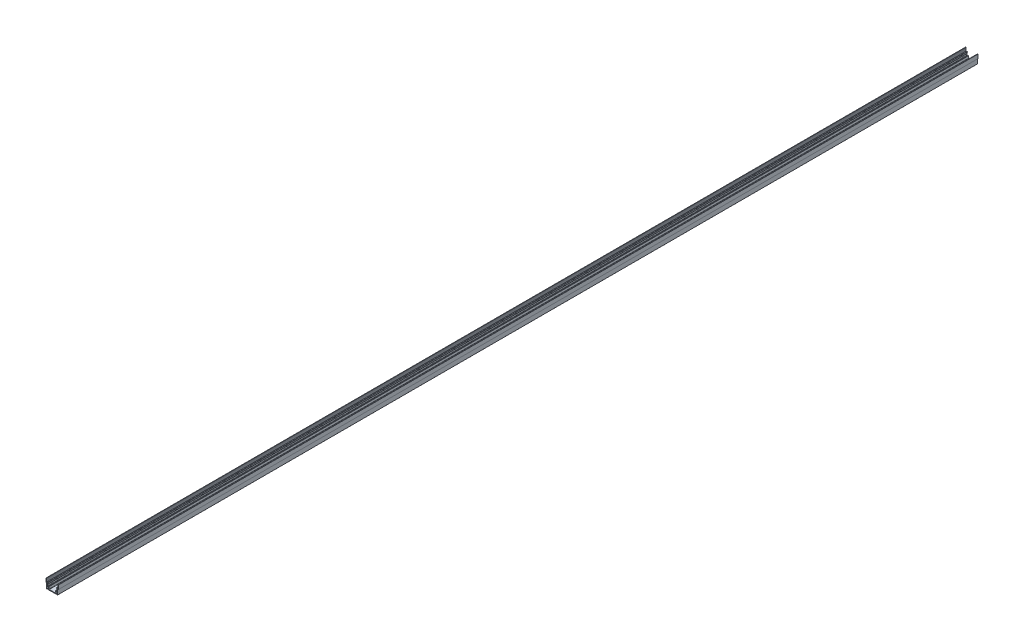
ISO-10303-21;
HEADER;
FILE_DESCRIPTION(('STEP AP214'),'2;1');
FILE_NAME('part.step','',(''),(''),'','','');
FILE_SCHEMA(('AUTOMOTIVE_DESIGN { 1 0 10303 214 1 1 1 1 }'));
ENDSEC;
DATA;
#1=APPLICATION_CONTEXT('core data for automotive mechanical design processes');
#2=APPLICATION_PROTOCOL_DEFINITION('international standard','automotive_design',2000,#1);
#3=PRODUCT_CONTEXT('',#1,'mechanical');
#4=PRODUCT('Part','Part','',(#3));
#5=PRODUCT_RELATED_PRODUCT_CATEGORY('part','',(#4));
#6=PRODUCT_DEFINITION_FORMATION('','',#4);
#7=PRODUCT_DEFINITION_CONTEXT('part definition',#1,'design');
#8=PRODUCT_DEFINITION('design','',#6,#7);
#9=PRODUCT_DEFINITION_SHAPE('','',#8);
#10=(LENGTH_UNIT() NAMED_UNIT(*) SI_UNIT(.MILLI.,.METRE.));
#11=(NAMED_UNIT(*) PLANE_ANGLE_UNIT() SI_UNIT($,.RADIAN.));
#12=(NAMED_UNIT(*) SI_UNIT($,.STERADIAN.) SOLID_ANGLE_UNIT());
#13=UNCERTAINTY_MEASURE_WITH_UNIT(LENGTH_MEASURE(1.E-05),#10,'distance_accuracy_value','');
#14=(GEOMETRIC_REPRESENTATION_CONTEXT(3) GLOBAL_UNCERTAINTY_ASSIGNED_CONTEXT((#13)) GLOBAL_UNIT_ASSIGNED_CONTEXT((#10,
#11,#12)) REPRESENTATION_CONTEXT('',''));
#15=CARTESIAN_POINT('',(0.,0.,0.));
#16=DIRECTION('',(0.,0.,1.));
#17=DIRECTION('',(1.,0.,0.));
#18=AXIS2_PLACEMENT_3D('',#15,#16,#17);
#19=CARTESIAN_POINT('',(-18.,26.302,270.));
#20=DIRECTION('',(1.,0.,0.));
#21=DIRECTION('',(0.,0.,-1.));
#22=AXIS2_PLACEMENT_3D('',#19,#20,#21);
#23=PLANE('',#22);
#24=DIRECTION('',(0.,-1.,0.));
#25=VECTOR('',#24,1.);
#26=CARTESIAN_POINT('',(-18.,26.302,0.));
#27=LINE('',#26,#25);
#28=CARTESIAN_POINT('',(-18.,26.302,0.));
#29=VERTEX_POINT('',#28);
#30=CARTESIAN_POINT('',(-18.,14.6986296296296,0.));
#31=VERTEX_POINT('',#30);
#32=EDGE_CURVE('E688',#29,#31,#27,.T.);
#33=ORIENTED_EDGE('',*,*,#32,.T.);
#34=DIRECTION('',(0.,0.,-1.));
#35=VECTOR('',#34,1.);
#36=CARTESIAN_POINT('',(-18.,14.6986296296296,270.));
#37=LINE('',#36,#35);
#38=CARTESIAN_POINT('',(-18.,14.6986296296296,2700.));
#39=VERTEX_POINT('',#38);
#40=EDGE_CURVE('E9',#39,#31,#37,.T.);
#41=ORIENTED_EDGE('',*,*,#40,.F.);
#42=DIRECTION('',(0.,1.,0.));
#43=VECTOR('',#42,1.);
#44=CARTESIAN_POINT('',(-18.,14.6986296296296,2700.));
#45=LINE('',#44,#43);
#46=CARTESIAN_POINT('',(-18.,26.302,2700.));
#47=VERTEX_POINT('',#46);
#48=EDGE_CURVE('E686',#39,#47,#45,.T.);
#49=ORIENTED_EDGE('',*,*,#48,.T.);
#50=DIRECTION('',(0.,0.,-1.));
#51=VECTOR('',#50,1.);
#52=CARTESIAN_POINT('',(-18.,26.302,270.));
#53=LINE('',#52,#51);
#54=EDGE_CURVE('E1281',#47,#29,#53,.T.);
#55=ORIENTED_EDGE('',*,*,#54,.T.);
#56=EDGE_LOOP('',(#33,#41,#49,#55));
#57=FACE_BOUND('',#56,.T.);
#58=ADVANCED_FACE('F14',(#57),#23,.F.);
#59=CARTESIAN_POINT('',(-18.,14.6986296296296,270.));
#60=DIRECTION('',(-0.287144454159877,0.957887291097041,0.));
#61=DIRECTION('',(-0.957887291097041,-0.287144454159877,0.));
#62=AXIS2_PLACEMENT_3D('',#59,#60,#61);
#63=PLANE('',#62);
#64=DIRECTION('',(0.957887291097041,0.287144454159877,0.));
#65=VECTOR('',#64,1.);
#66=CARTESIAN_POINT('',(-18.,14.6986296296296,0.));
#67=LINE('',#66,#65);
#68=CARTESIAN_POINT('',(-17.008,14.996,0.));
#69=VERTEX_POINT('',#68);
#70=EDGE_CURVE('E1025',#31,#69,#67,.T.);
#71=ORIENTED_EDGE('',*,*,#70,.T.);
#72=DIRECTION('',(0.,0.,-1.));
#73=VECTOR('',#72,1.);
#74=CARTESIAN_POINT('',(-17.008,14.996,270.));
#75=LINE('',#74,#73);
#76=CARTESIAN_POINT('',(-17.008,14.996,2700.));
#77=VERTEX_POINT('',#76);
#78=EDGE_CURVE('E21',#77,#69,#75,.T.);
#79=ORIENTED_EDGE('',*,*,#78,.F.);
#80=DIRECTION('',(-0.957887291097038,-0.287144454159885,0.));
#81=VECTOR('',#80,1.);
#82=CARTESIAN_POINT('',(-17.008,14.996,2700.));
#83=LINE('',#82,#81);
#84=EDGE_CURVE('E696',#77,#39,#83,.T.);
#85=ORIENTED_EDGE('',*,*,#84,.T.);
#86=ORIENTED_EDGE('',*,*,#40,.T.);
#87=EDGE_LOOP('',(#71,#79,#85,#86));
#88=FACE_BOUND('',#87,.T.);
#89=ADVANCED_FACE('F702',(#88),#63,.F.);
#90=CARTESIAN_POINT('',(-17.008,14.996,270.));
#91=DIRECTION('',(0.,1.,0.));
#92=DIRECTION('',(0.,0.,1.));
#93=AXIS2_PLACEMENT_3D('',#90,#91,#92);
#94=PLANE('',#93);
#95=DIRECTION('',(1.,0.,0.));
#96=VECTOR('',#95,1.);
#97=CARTESIAN_POINT('',(-17.008,14.996,0.));
#98=LINE('',#97,#96);
#99=CARTESIAN_POINT('',(-16.,14.996,0.));
#100=VERTEX_POINT('',#99);
#101=EDGE_CURVE('E1027',#69,#100,#98,.T.);
#102=ORIENTED_EDGE('',*,*,#101,.T.);
#103=DIRECTION('',(0.,0.,-1.));
#104=VECTOR('',#103,1.);
#105=CARTESIAN_POINT('',(-16.,14.996,270.));
#106=LINE('',#105,#104);
#107=CARTESIAN_POINT('',(-16.,14.996,2700.));
#108=VERTEX_POINT('',#107);
#109=EDGE_CURVE('E1554',#108,#100,#106,.T.);
#110=ORIENTED_EDGE('',*,*,#109,.F.);
#111=DIRECTION('',(-1.,0.,0.));
#112=VECTOR('',#111,1.);
#113=CARTESIAN_POINT('',(-16.,14.996,2700.));
#114=LINE('',#113,#112);
#115=EDGE_CURVE('E1022',#108,#77,#114,.T.);
#116=ORIENTED_EDGE('',*,*,#115,.T.);
#117=ORIENTED_EDGE('',*,*,#78,.T.);
#118=EDGE_LOOP('',(#102,#110,#116,#117));
#119=FACE_BOUND('',#118,.T.);
#120=ADVANCED_FACE('F1558',(#119),#94,.F.);
#121=CARTESIAN_POINT('',(-16.,14.996,270.));
#122=DIRECTION('',(1.,0.,0.));
#123=DIRECTION('',(0.,0.,-1.));
#124=AXIS2_PLACEMENT_3D('',#121,#122,#123);
#125=PLANE('',#124);
#126=DIRECTION('',(0.,-1.,0.));
#127=VECTOR('',#126,1.);
#128=CARTESIAN_POINT('',(-16.,14.996,0.));
#129=LINE('',#128,#127);
#130=CARTESIAN_POINT('',(-16.,0.0999999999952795,0.));
#131=VERTEX_POINT('',#130);
#132=EDGE_CURVE('E1029',#100,#131,#129,.T.);
#133=ORIENTED_EDGE('',*,*,#132,.T.);
#134=DIRECTION('',(0.,0.,-1.));
#135=VECTOR('',#134,1.);
#136=CARTESIAN_POINT('',(-16.,0.0999999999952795,270.));
#137=LINE('',#136,#135);
#138=CARTESIAN_POINT('',(-16.,0.0999999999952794,2700.));
#139=VERTEX_POINT('',#138);
#140=EDGE_CURVE('E1551',#139,#131,#137,.T.);
#141=ORIENTED_EDGE('',*,*,#140,.F.);
#142=DIRECTION('',(0.,1.,0.));
#143=VECTOR('',#142,1.);
#144=CARTESIAN_POINT('',(-16.,0.0999999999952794,2700.));
#145=LINE('',#144,#143);
#146=EDGE_CURVE('E1019',#139,#108,#145,.T.);
#147=ORIENTED_EDGE('',*,*,#146,.T.);
#148=ORIENTED_EDGE('',*,*,#109,.T.);
#149=EDGE_LOOP('',(#133,#141,#147,#148));
#150=FACE_BOUND('',#149,.T.);
#151=ADVANCED_FACE('F1565',(#150),#125,.F.);
#152=CARTESIAN_POINT('',(-15.702,0.0999999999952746,270.));
#153=DIRECTION('',(0.,0.,-1.));
#154=DIRECTION('',(-1.,0.,0.));
#155=AXIS2_PLACEMENT_3D('',#152,#153,#154);
#156=CYLINDRICAL_SURFACE('',#155,0.298);
#157=CARTESIAN_POINT('',(-15.702,0.0999999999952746,0.));
#158=DIRECTION('',(0.,0.,1.));
#159=DIRECTION('',(1.,0.,0.));
#160=AXIS2_PLACEMENT_3D('',#157,#158,#159);
#161=CIRCLE('',#160,0.298);
#162=CARTESIAN_POINT('',(-15.7020016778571,-0.198,0.));
#163=VERTEX_POINT('',#162);
#164=EDGE_CURVE('E1031',#131,#163,#161,.T.);
#165=ORIENTED_EDGE('',*,*,#164,.T.);
#166=DIRECTION('',(0.,0.,-1.));
#167=VECTOR('',#166,1.);
#168=CARTESIAN_POINT('',(-15.7020016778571,-0.198,270.));
#169=LINE('',#168,#167);
#170=CARTESIAN_POINT('',(-15.7020016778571,-0.198,2700.));
#171=VERTEX_POINT('',#170);
#172=EDGE_CURVE('E1548',#171,#163,#169,.T.);
#173=ORIENTED_EDGE('',*,*,#172,.F.);
#174=CARTESIAN_POINT('',(-15.702,0.0999999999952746,2700.));
#175=DIRECTION('',(0.,0.,-1.));
#176=DIRECTION('',(-1.,0.,0.));
#177=AXIS2_PLACEMENT_3D('',#174,#175,#176);
#178=CIRCLE('',#177,0.298);
#179=EDGE_CURVE('E1016',#171,#139,#178,.T.);
#180=ORIENTED_EDGE('',*,*,#179,.T.);
#181=ORIENTED_EDGE('',*,*,#140,.T.);
#182=EDGE_LOOP('',(#165,#173,#180,#181));
#183=FACE_BOUND('',#182,.T.);
#184=ADVANCED_FACE('F1568',(#183),#156,.T.);
#185=CARTESIAN_POINT('',(-15.7020016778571,-0.198,270.));
#186=DIRECTION('',(0.,1.,0.));
#187=DIRECTION('',(0.,0.,1.));
#188=AXIS2_PLACEMENT_3D('',#185,#186,#187);
#189=PLANE('',#188);
#190=DIRECTION('',(1.,0.,0.));
#191=VECTOR('',#190,1.);
#192=CARTESIAN_POINT('',(-15.7020016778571,-0.198,0.));
#193=LINE('',#192,#191);
#194=CARTESIAN_POINT('',(-14.2773032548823,-0.198,0.));
#195=VERTEX_POINT('',#194);
#196=EDGE_CURVE('E1033',#163,#195,#193,.T.);
#197=ORIENTED_EDGE('',*,*,#196,.T.);
#198=DIRECTION('',(0.,0.,-1.));
#199=VECTOR('',#198,1.);
#200=CARTESIAN_POINT('',(-14.2773032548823,-0.198,270.));
#201=LINE('',#200,#199);
#202=CARTESIAN_POINT('',(-14.2773032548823,-0.197999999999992,2700.));
#203=VERTEX_POINT('',#202);
#204=EDGE_CURVE('E1545',#203,#195,#201,.T.);
#205=ORIENTED_EDGE('',*,*,#204,.F.);
#206=DIRECTION('',(-1.,0.,0.));
#207=VECTOR('',#206,1.);
#208=CARTESIAN_POINT('',(-14.2773032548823,-0.197999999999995,2700.));
#209=LINE('',#208,#207);
#210=EDGE_CURVE('E1013',#203,#171,#209,.T.);
#211=ORIENTED_EDGE('',*,*,#210,.T.);
#212=ORIENTED_EDGE('',*,*,#172,.T.);
#213=EDGE_LOOP('',(#197,#205,#211,#212));
#214=FACE_BOUND('',#213,.T.);
#215=ADVANCED_FACE('F1573',(#214),#189,.F.);
#216=CARTESIAN_POINT('',(-14.2773038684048,0.0999999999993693,270.));
#217=DIRECTION('',(0.,0.,-1.));
#218=DIRECTION('',(-1.,0.,0.));
#219=AXIS2_PLACEMENT_3D('',#216,#217,#218);
#220=CYLINDRICAL_SURFACE('',#219,0.298);
#221=CARTESIAN_POINT('',(-14.2773038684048,0.0999999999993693,0.));
#222=DIRECTION('',(0.,0.,1.));
#223=DIRECTION('',(1.,0.,0.));
#224=AXIS2_PLACEMENT_3D('',#221,#222,#223);
#225=CIRCLE('',#224,0.298);
#226=CARTESIAN_POINT('',(-13.9819190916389,0.0606066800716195,0.));
#227=VERTEX_POINT('',#226);
#228=EDGE_CURVE('E1035',#195,#227,#225,.T.);
#229=ORIENTED_EDGE('',*,*,#228,.T.);
#230=DIRECTION('',(0.,0.,-1.));
#231=VECTOR('',#230,1.);
#232=CARTESIAN_POINT('',(-13.9819190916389,0.0606066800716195,270.));
#233=LINE('',#232,#231);
#234=CARTESIAN_POINT('',(-13.9819190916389,0.0606066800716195,2700.));
#235=VERTEX_POINT('',#234);
#236=EDGE_CURVE('E1542',#235,#227,#233,.T.);
#237=ORIENTED_EDGE('',*,*,#236,.F.);
#238=CARTESIAN_POINT('',(-14.2773038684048,0.0999999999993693,2700.));
#239=DIRECTION('',(0.,0.,-1.));
#240=DIRECTION('',(-1.,0.,0.));
#241=AXIS2_PLACEMENT_3D('',#238,#239,#240);
#242=CIRCLE('',#241,0.297999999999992);
#243=EDGE_CURVE('E1010',#235,#203,#242,.T.);
#244=ORIENTED_EDGE('',*,*,#243,.T.);
#245=ORIENTED_EDGE('',*,*,#204,.T.);
#246=EDGE_LOOP('',(#229,#237,#244,#245));
#247=FACE_BOUND('',#246,.T.);
#248=ADVANCED_FACE('F1576',(#247),#220,.T.);
#249=CARTESIAN_POINT('',(-13.9819190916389,0.0606066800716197,270.));
#250=DIRECTION('',(-0.991224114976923,0.132192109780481,0.));
#251=DIRECTION('',(-0.132192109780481,-0.991224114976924,0.));
#252=AXIS2_PLACEMENT_3D('',#249,#250,#251);
#253=PLANE('',#252);
#254=DIRECTION('',(0.132192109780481,0.991224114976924,0.));
#255=VECTOR('',#254,1.);
#256=CARTESIAN_POINT('',(-13.9819190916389,0.0606066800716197,0.));
#257=LINE('',#256,#255);
#258=CARTESIAN_POINT('',(-13.6770576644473,2.34656761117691,0.));
#259=VERTEX_POINT('',#258);
#260=EDGE_CURVE('E1037',#227,#259,#257,.T.);
#261=ORIENTED_EDGE('',*,*,#260,.T.);
#262=DIRECTION('',(0.,0.,-1.));
#263=VECTOR('',#262,1.);
#264=CARTESIAN_POINT('',(-13.6770576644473,2.34656761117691,270.));
#265=LINE('',#264,#263);
#266=CARTESIAN_POINT('',(-13.6770576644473,2.34656761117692,2700.));
#267=VERTEX_POINT('',#266);
#268=EDGE_CURVE('E1540',#267,#259,#265,.T.);
#269=ORIENTED_EDGE('',*,*,#268,.F.);
#270=DIRECTION('',(-0.132192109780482,-0.991224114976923,0.));
#271=VECTOR('',#270,1.);
#272=CARTESIAN_POINT('',(-13.6770576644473,2.34656761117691,2700.));
#273=LINE('',#272,#271);
#274=EDGE_CURVE('E1007',#267,#235,#273,.T.);
#275=ORIENTED_EDGE('',*,*,#274,.T.);
#276=ORIENTED_EDGE('',*,*,#236,.T.);
#277=EDGE_LOOP('',(#261,#269,#275,#276));
#278=FACE_BOUND('',#277,.T.);
#279=ADVANCED_FACE('F1581',(#278),#253,.F.);
#280=CARTESIAN_POINT('',(-13.1854105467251,2.281,270.));
#281=DIRECTION('',(0.,0.,-1.));
#282=DIRECTION('',(-1.,0.,0.));
#283=AXIS2_PLACEMENT_3D('',#280,#281,#282);
#284=CYLINDRICAL_SURFACE('',#283,0.496);
#285=CARTESIAN_POINT('',(-13.1854105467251,2.281,0.));
#286=DIRECTION('',(0.,0.,1.));
#287=DIRECTION('',(1.,0.,0.));
#288=AXIS2_PLACEMENT_3D('',#285,#286,#287);
#289=CIRCLE('',#288,0.496);
#290=CARTESIAN_POINT('',(-13.1854106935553,2.777,0.));
#291=VERTEX_POINT('',#290);
#292=EDGE_CURVE('E1040',#291,#259,#289,.T.);
#293=ORIENTED_EDGE('',*,*,#292,.F.);
#294=DIRECTION('',(0.,0.,-1.));
#295=VECTOR('',#294,1.);
#296=CARTESIAN_POINT('',(-13.1854106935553,2.777,270.));
#297=LINE('',#296,#295);
#298=CARTESIAN_POINT('',(-13.1854106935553,2.777,2700.));
#299=VERTEX_POINT('',#298);
#300=EDGE_CURVE('E1538',#299,#291,#297,.T.);
#301=ORIENTED_EDGE('',*,*,#300,.F.);
#302=CARTESIAN_POINT('',(-13.1854105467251,2.281,2700.));
#303=DIRECTION('',(0.,0.,1.));
#304=DIRECTION('',(-1.,0.,0.));
#305=AXIS2_PLACEMENT_3D('',#302,#303,#304);
#306=CIRCLE('',#305,0.496000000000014);
#307=EDGE_CURVE('E1004',#299,#267,#306,.T.);
#308=ORIENTED_EDGE('',*,*,#307,.T.);
#309=ORIENTED_EDGE('',*,*,#268,.T.);
#310=EDGE_LOOP('',(#293,#301,#308,#309));
#311=FACE_BOUND('',#310,.T.);
#312=ADVANCED_FACE('F1586',(#311),#284,.F.);
#313=CARTESIAN_POINT('',(-13.1854106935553,2.777,270.));
#314=DIRECTION('',(0.,1.,0.));
#315=DIRECTION('',(0.,0.,1.));
#316=AXIS2_PLACEMENT_3D('',#313,#314,#315);
#317=PLANE('',#316);
#318=DIRECTION('',(1.,0.,0.));
#319=VECTOR('',#318,1.);
#320=CARTESIAN_POINT('',(-13.1854106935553,2.777,0.));
#321=LINE('',#320,#319);
#322=CARTESIAN_POINT('',(-12.0205892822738,2.777,0.));
#323=VERTEX_POINT('',#322);
#324=EDGE_CURVE('E1043',#291,#323,#321,.T.);
#325=ORIENTED_EDGE('',*,*,#324,.T.);
#326=DIRECTION('',(0.,0.,-1.));
#327=VECTOR('',#326,1.);
#328=CARTESIAN_POINT('',(-12.0205892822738,2.777,270.));
#329=LINE('',#328,#327);
#330=CARTESIAN_POINT('',(-12.0205892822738,2.777,2700.));
#331=VERTEX_POINT('',#330);
#332=EDGE_CURVE('E1536',#331,#323,#329,.T.);
#333=ORIENTED_EDGE('',*,*,#332,.F.);
#334=DIRECTION('',(-1.,0.,0.));
#335=VECTOR('',#334,1.);
#336=CARTESIAN_POINT('',(-12.0205892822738,2.777,2700.));
#337=LINE('',#336,#335);
#338=EDGE_CURVE('E1001',#331,#299,#337,.T.);
#339=ORIENTED_EDGE('',*,*,#338,.T.);
#340=ORIENTED_EDGE('',*,*,#300,.T.);
#341=EDGE_LOOP('',(#325,#333,#339,#340));
#342=FACE_BOUND('',#341,.T.);
#343=ADVANCED_FACE('F1588',(#342),#317,.F.);
#344=CARTESIAN_POINT('',(-12.0205895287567,2.28100000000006,270.));
#345=DIRECTION('',(0.,0.,-1.));
#346=DIRECTION('',(-1.,0.,0.));
#347=AXIS2_PLACEMENT_3D('',#344,#345,#346);
#348=CYLINDRICAL_SURFACE('',#347,0.496);
#349=CARTESIAN_POINT('',(-12.0205895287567,2.28100000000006,0.));
#350=DIRECTION('',(0.,0.,1.));
#351=DIRECTION('',(1.,0.,0.));
#352=AXIS2_PLACEMENT_3D('',#349,#350,#351);
#353=CIRCLE('',#352,0.496);
#354=CARTESIAN_POINT('',(-11.5289320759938,2.34649006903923,0.));
#355=VERTEX_POINT('',#354);
#356=EDGE_CURVE('E1046',#355,#323,#353,.T.);
#357=ORIENTED_EDGE('',*,*,#356,.F.);
#358=DIRECTION('',(0.,0.,-1.));
#359=VECTOR('',#358,1.);
#360=CARTESIAN_POINT('',(-11.5289320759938,2.34649006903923,270.));
#361=LINE('',#360,#359);
#362=CARTESIAN_POINT('',(-11.5289320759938,2.34649006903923,2700.));
#363=VERTEX_POINT('',#362);
#364=EDGE_CURVE('E1534',#363,#355,#361,.T.);
#365=ORIENTED_EDGE('',*,*,#364,.F.);
#366=CARTESIAN_POINT('',(-12.0205895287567,2.28100000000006,2700.));
#367=DIRECTION('',(0.,0.,1.));
#368=DIRECTION('',(-1.,0.,0.));
#369=AXIS2_PLACEMENT_3D('',#366,#367,#368);
#370=CIRCLE('',#369,0.496);
#371=EDGE_CURVE('E998',#363,#331,#370,.T.);
#372=ORIENTED_EDGE('',*,*,#371,.T.);
#373=ORIENTED_EDGE('',*,*,#332,.T.);
#374=EDGE_LOOP('',(#357,#365,#372,#373));
#375=FACE_BOUND('',#374,.T.);
#376=ADVANCED_FACE('F1593',(#375),#348,.F.);
#377=CARTESIAN_POINT('',(-11.5289320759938,2.34649006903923,270.));
#378=DIRECTION('',(0.991244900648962,0.132036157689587,0.));
#379=DIRECTION('',(-0.132036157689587,0.991244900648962,0.));
#380=AXIS2_PLACEMENT_3D('',#377,#378,#379);
#381=PLANE('',#380);
#382=DIRECTION('',(0.132036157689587,-0.991244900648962,0.));
#383=VECTOR('',#382,1.);
#384=CARTESIAN_POINT('',(-11.5289320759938,2.34649006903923,0.));
#385=LINE('',#384,#383);
#386=CARTESIAN_POINT('',(-11.19,-0.198,0.));
#387=VERTEX_POINT('',#386);
#388=EDGE_CURVE('E1049',#355,#387,#385,.T.);
#389=ORIENTED_EDGE('',*,*,#388,.T.);
#390=DIRECTION('',(0.,0.,-1.));
#391=VECTOR('',#390,1.);
#392=CARTESIAN_POINT('',(-11.19,-0.198,270.));
#393=LINE('',#392,#391);
#394=CARTESIAN_POINT('',(-11.19,-0.198,2700.));
#395=VERTEX_POINT('',#394);
#396=EDGE_CURVE('E1531',#395,#387,#393,.T.);
#397=ORIENTED_EDGE('',*,*,#396,.F.);
#398=DIRECTION('',(-0.13203615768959,0.991244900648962,0.));
#399=VECTOR('',#398,1.);
#400=CARTESIAN_POINT('',(-11.19,-0.198,2700.));
#401=LINE('',#400,#399);
#402=EDGE_CURVE('E995',#395,#363,#401,.T.);
#403=ORIENTED_EDGE('',*,*,#402,.T.);
#404=ORIENTED_EDGE('',*,*,#364,.T.);
#405=EDGE_LOOP('',(#389,#397,#403,#404));
#406=FACE_BOUND('',#405,.T.);
#407=ADVANCED_FACE('F1598',(#406),#381,.F.);
#408=CARTESIAN_POINT('',(-11.19,-0.198,270.));
#409=DIRECTION('',(0.,1.,0.));
#410=DIRECTION('',(-1.,0.,0.));
#411=AXIS2_PLACEMENT_3D('',#408,#409,#410);
#412=PLANE('',#411);
#413=DIRECTION('',(1.,0.,0.));
#414=VECTOR('',#413,1.);
#415=CARTESIAN_POINT('',(-11.19,-0.198,0.));
#416=LINE('',#415,#414);
#417=CARTESIAN_POINT('',(-7.663,-0.198,0.));
#418=VERTEX_POINT('',#417);
#419=EDGE_CURVE('E1051',#387,#418,#416,.T.);
#420=ORIENTED_EDGE('',*,*,#419,.T.);
#421=DIRECTION('',(0.,0.,-1.));
#422=VECTOR('',#421,1.);
#423=CARTESIAN_POINT('',(-7.663,-0.198,270.));
#424=LINE('',#423,#422);
#425=CARTESIAN_POINT('',(-7.663,-0.198,2700.));
#426=VERTEX_POINT('',#425);
#427=EDGE_CURVE('E1529',#426,#418,#424,.T.);
#428=ORIENTED_EDGE('',*,*,#427,.F.);
#429=DIRECTION('',(-1.,0.,0.));
#430=VECTOR('',#429,1.);
#431=CARTESIAN_POINT('',(-7.663,-0.198,2700.));
#432=LINE('',#431,#430);
#433=EDGE_CURVE('E992',#426,#395,#432,.T.);
#434=ORIENTED_EDGE('',*,*,#433,.T.);
#435=ORIENTED_EDGE('',*,*,#396,.T.);
#436=EDGE_LOOP('',(#420,#428,#434,#435));
#437=FACE_BOUND('',#436,.T.);
#438=ADVANCED_FACE('F1600',(#437),#412,.F.);
#439=CARTESIAN_POINT('',(-7.14898437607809,-0.752368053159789,270.));
#440=DIRECTION('',(0.,0.,-1.));
#441=DIRECTION('',(-1.,0.,0.));
#442=AXIS2_PLACEMENT_3D('',#439,#440,#441);
#443=CYLINDRICAL_SURFACE('',#442,0.756);
#444=CARTESIAN_POINT('',(-7.14898437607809,-0.752368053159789,0.));
#445=DIRECTION('',(0.,0.,1.));
#446=DIRECTION('',(1.,0.,0.));
#447=AXIS2_PLACEMENT_3D('',#444,#445,#446);
#448=CIRCLE('',#447,0.756);
#449=CARTESIAN_POINT('',(-7.223,0.,0.));
#450=VERTEX_POINT('',#449);
#451=EDGE_CURVE('E1054',#450,#418,#448,.T.);
#452=ORIENTED_EDGE('',*,*,#451,.F.);
#453=DIRECTION('',(0.,0.,-1.));
#454=VECTOR('',#453,1.);
#455=CARTESIAN_POINT('',(-7.223,0.,270.));
#456=LINE('',#455,#454);
#457=CARTESIAN_POINT('',(-7.223,0.,2700.));
#458=VERTEX_POINT('',#457);
#459=EDGE_CURVE('E1527',#458,#450,#456,.T.);
#460=ORIENTED_EDGE('',*,*,#459,.F.);
#461=CARTESIAN_POINT('',(-7.14898437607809,-0.752368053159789,2700.));
#462=DIRECTION('',(0.,0.,1.));
#463=DIRECTION('',(-1.,0.,0.));
#464=AXIS2_PLACEMENT_3D('',#461,#462,#463);
#465=CIRCLE('',#464,0.756);
#466=EDGE_CURVE('E989',#458,#426,#465,.T.);
#467=ORIENTED_EDGE('',*,*,#466,.T.);
#468=ORIENTED_EDGE('',*,*,#427,.T.);
#469=EDGE_LOOP('',(#452,#460,#467,#468));
#470=FACE_BOUND('',#469,.T.);
#471=ADVANCED_FACE('F1604',(#470),#443,.F.);
#472=CARTESIAN_POINT('',(-7.223,0.,270.));
#473=DIRECTION('',(0.,1.,0.));
#474=DIRECTION('',(0.,0.,1.));
#475=AXIS2_PLACEMENT_3D('',#472,#473,#474);
#476=PLANE('',#475);
#477=DIRECTION('',(1.,0.,0.));
#478=VECTOR('',#477,1.);
#479=CARTESIAN_POINT('',(-7.223,0.,0.));
#480=LINE('',#479,#478);
#481=CARTESIAN_POINT('',(7.223,0.,0.));
#482=VERTEX_POINT('',#481);
#483=EDGE_CURVE('E1057',#450,#482,#480,.T.);
#484=ORIENTED_EDGE('',*,*,#483,.T.);
#485=DIRECTION('',(0.,0.,-1.));
#486=VECTOR('',#485,1.);
#487=CARTESIAN_POINT('',(7.223,0.,270.));
#488=LINE('',#487,#486);
#489=CARTESIAN_POINT('',(7.223,0.,2700.));
#490=VERTEX_POINT('',#489);
#491=EDGE_CURVE('E1525',#490,#482,#488,.T.);
#492=ORIENTED_EDGE('',*,*,#491,.F.);
#493=DIRECTION('',(-1.,0.,0.));
#494=VECTOR('',#493,1.);
#495=CARTESIAN_POINT('',(7.223,0.,2700.));
#496=LINE('',#495,#494);
#497=EDGE_CURVE('E986',#490,#458,#496,.T.);
#498=ORIENTED_EDGE('',*,*,#497,.T.);
#499=ORIENTED_EDGE('',*,*,#459,.T.);
#500=EDGE_LOOP('',(#484,#492,#498,#499));
#501=FACE_BOUND('',#500,.T.);
#502=ADVANCED_FACE('F1609',(#501),#476,.F.);
#503=CARTESIAN_POINT('',(7.14898437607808,-0.752368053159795,270.));
#504=DIRECTION('',(0.,0.,-1.));
#505=DIRECTION('',(-1.,0.,0.));
#506=AXIS2_PLACEMENT_3D('',#503,#504,#505);
#507=CYLINDRICAL_SURFACE('',#506,0.756);
#508=CARTESIAN_POINT('',(7.14898437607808,-0.752368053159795,0.));
#509=DIRECTION('',(0.,0.,1.));
#510=DIRECTION('',(1.,0.,0.));
#511=AXIS2_PLACEMENT_3D('',#508,#509,#510);
#512=CIRCLE('',#511,0.756);
#513=CARTESIAN_POINT('',(7.663,-0.198,0.));
#514=VERTEX_POINT('',#513);
#515=EDGE_CURVE('E1060',#514,#482,#512,.T.);
#516=ORIENTED_EDGE('',*,*,#515,.F.);
#517=DIRECTION('',(0.,0.,-1.));
#518=VECTOR('',#517,1.);
#519=CARTESIAN_POINT('',(7.663,-0.198,270.));
#520=LINE('',#519,#518);
#521=CARTESIAN_POINT('',(7.663,-0.198,2700.));
#522=VERTEX_POINT('',#521);
#523=EDGE_CURVE('E1523',#522,#514,#520,.T.);
#524=ORIENTED_EDGE('',*,*,#523,.F.);
#525=CARTESIAN_POINT('',(7.14898437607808,-0.752368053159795,2700.));
#526=DIRECTION('',(0.,0.,1.));
#527=DIRECTION('',(-1.,0.,0.));
#528=AXIS2_PLACEMENT_3D('',#525,#526,#527);
#529=CIRCLE('',#528,0.756000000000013);
#530=EDGE_CURVE('E983',#522,#490,#529,.T.);
#531=ORIENTED_EDGE('',*,*,#530,.T.);
#532=ORIENTED_EDGE('',*,*,#491,.T.);
#533=EDGE_LOOP('',(#516,#524,#531,#532));
#534=FACE_BOUND('',#533,.T.);
#535=ADVANCED_FACE('F1612',(#534),#507,.F.);
#536=CARTESIAN_POINT('',(7.663,-0.198,270.));
#537=DIRECTION('',(0.,1.,0.));
#538=DIRECTION('',(-1.,0.,0.));
#539=AXIS2_PLACEMENT_3D('',#536,#537,#538);
#540=PLANE('',#539);
#541=DIRECTION('',(1.,0.,0.));
#542=VECTOR('',#541,1.);
#543=CARTESIAN_POINT('',(7.663,-0.198,0.));
#544=LINE('',#543,#542);
#545=CARTESIAN_POINT('',(10.93,-0.198,0.));
#546=VERTEX_POINT('',#545);
#547=EDGE_CURVE('E1063',#514,#546,#544,.T.);
#548=ORIENTED_EDGE('',*,*,#547,.T.);
#549=DIRECTION('',(0.,0.,-1.));
#550=VECTOR('',#549,1.);
#551=CARTESIAN_POINT('',(10.93,-0.198,270.));
#552=LINE('',#551,#550);
#553=CARTESIAN_POINT('',(10.93,-0.197999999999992,2700.));
#554=VERTEX_POINT('',#553);
#555=EDGE_CURVE('E1520',#554,#546,#552,.T.);
#556=ORIENTED_EDGE('',*,*,#555,.F.);
#557=DIRECTION('',(-1.,0.,0.));
#558=VECTOR('',#557,1.);
#559=CARTESIAN_POINT('',(10.93,-0.197999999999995,2700.));
#560=LINE('',#559,#558);
#561=EDGE_CURVE('E980',#554,#522,#560,.T.);
#562=ORIENTED_EDGE('',*,*,#561,.T.);
#563=ORIENTED_EDGE('',*,*,#523,.T.);
#564=EDGE_LOOP('',(#548,#556,#562,#563));
#565=FACE_BOUND('',#564,.T.);
#566=ADVANCED_FACE('F1616',(#565),#540,.F.);
#567=CARTESIAN_POINT('',(10.9286957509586,0.0999971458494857,270.));
#568=DIRECTION('',(0.,0.,-1.));
#569=DIRECTION('',(-1.,0.,0.));
#570=AXIS2_PLACEMENT_3D('',#567,#568,#569);
#571=CYLINDRICAL_SURFACE('',#570,0.298);
#572=CARTESIAN_POINT('',(10.9286957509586,0.0999971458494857,0.));
#573=DIRECTION('',(0.,0.,1.));
#574=DIRECTION('',(1.,0.,0.));
#575=AXIS2_PLACEMENT_3D('',#572,#573,#574);
#576=CIRCLE('',#575,0.298);
#577=CARTESIAN_POINT('',(11.2240805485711,0.0606039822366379,0.));
#578=VERTEX_POINT('',#577);
#579=EDGE_CURVE('E1065',#546,#578,#576,.T.);
#580=ORIENTED_EDGE('',*,*,#579,.T.);
#581=DIRECTION('',(0.,0.,-1.));
#582=VECTOR('',#581,1.);
#583=CARTESIAN_POINT('',(11.2240805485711,0.0606039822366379,270.));
#584=LINE('',#583,#582);
#585=CARTESIAN_POINT('',(11.2240805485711,0.0606039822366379,2700.));
#586=VERTEX_POINT('',#585);
#587=EDGE_CURVE('E1517',#586,#578,#584,.T.);
#588=ORIENTED_EDGE('',*,*,#587,.F.);
#589=CARTESIAN_POINT('',(10.9286957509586,0.0999971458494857,2700.));
#590=DIRECTION('',(0.,0.,-1.));
#591=DIRECTION('',(-1.,0.,0.));
#592=AXIS2_PLACEMENT_3D('',#589,#590,#591);
#593=CIRCLE('',#592,0.297999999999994);
#594=EDGE_CURVE('E977',#586,#554,#593,.T.);
#595=ORIENTED_EDGE('',*,*,#594,.T.);
#596=ORIENTED_EDGE('',*,*,#555,.T.);
#597=EDGE_LOOP('',(#580,#588,#595,#596));
#598=FACE_BOUND('',#597,.T.);
#599=ADVANCED_FACE('F1620',(#598),#571,.T.);
#600=CARTESIAN_POINT('',(11.2240805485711,0.0606039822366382,270.));
#601=DIRECTION('',(-0.991224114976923,0.132192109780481,0.));
#602=DIRECTION('',(-0.132192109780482,-0.991224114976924,0.));
#603=AXIS2_PLACEMENT_3D('',#600,#601,#602);
#604=PLANE('',#603);
#605=DIRECTION('',(0.132192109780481,0.991224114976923,0.));
#606=VECTOR('',#605,1.);
#607=CARTESIAN_POINT('',(11.2240805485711,0.0606039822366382,0.));
#608=LINE('',#607,#606);
#609=CARTESIAN_POINT('',(11.5289423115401,2.3465674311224,0.));
#610=VERTEX_POINT('',#609);
#611=EDGE_CURVE('E1067',#578,#610,#608,.T.);
#612=ORIENTED_EDGE('',*,*,#611,.T.);
#613=DIRECTION('',(0.,0.,-1.));
#614=VECTOR('',#613,1.);
#615=CARTESIAN_POINT('',(11.5289423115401,2.3465674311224,270.));
#616=LINE('',#615,#614);
#617=CARTESIAN_POINT('',(11.5289423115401,2.3465674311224,2700.));
#618=VERTEX_POINT('',#617);
#619=EDGE_CURVE('E1515',#618,#610,#616,.T.);
#620=ORIENTED_EDGE('',*,*,#619,.F.);
#621=DIRECTION('',(-0.132192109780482,-0.991224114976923,0.));
#622=VECTOR('',#621,1.);
#623=CARTESIAN_POINT('',(11.5289423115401,2.3465674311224,2700.));
#624=LINE('',#623,#622);
#625=EDGE_CURVE('E974',#618,#586,#624,.T.);
#626=ORIENTED_EDGE('',*,*,#625,.T.);
#627=ORIENTED_EDGE('',*,*,#587,.T.);
#628=EDGE_LOOP('',(#612,#620,#626,#627));
#629=FACE_BOUND('',#628,.T.);
#630=ADVANCED_FACE('F1625',(#629),#604,.F.);
#631=CARTESIAN_POINT('',(12.020589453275,2.28100000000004,270.));
#632=DIRECTION('',(0.,0.,-1.));
#633=DIRECTION('',(-1.,0.,0.));
#634=AXIS2_PLACEMENT_3D('',#631,#632,#633);
#635=CYLINDRICAL_SURFACE('',#634,0.496);
#636=CARTESIAN_POINT('',(12.020589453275,2.28100000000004,0.));
#637=DIRECTION('',(0.,0.,1.));
#638=DIRECTION('',(1.,0.,0.));
#639=AXIS2_PLACEMENT_3D('',#636,#637,#638);
#640=CIRCLE('',#639,0.496);
#641=CARTESIAN_POINT('',(12.0205892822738,2.777,0.));
#642=VERTEX_POINT('',#641);
#643=EDGE_CURVE('E1070',#642,#610,#640,.T.);
#644=ORIENTED_EDGE('',*,*,#643,.F.);
#645=DIRECTION('',(0.,0.,-1.));
#646=VECTOR('',#645,1.);
#647=CARTESIAN_POINT('',(12.0205892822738,2.777,270.));
#648=LINE('',#647,#646);
#649=CARTESIAN_POINT('',(12.0205892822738,2.777,2700.));
#650=VERTEX_POINT('',#649);
#651=EDGE_CURVE('E1513',#650,#642,#648,.T.);
#652=ORIENTED_EDGE('',*,*,#651,.F.);
#653=CARTESIAN_POINT('',(12.020589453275,2.28100000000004,2700.));
#654=DIRECTION('',(0.,0.,1.));
#655=DIRECTION('',(-1.,0.,0.));
#656=AXIS2_PLACEMENT_3D('',#653,#654,#655);
#657=CIRCLE('',#656,0.496);
#658=EDGE_CURVE('E971',#650,#618,#657,.T.);
#659=ORIENTED_EDGE('',*,*,#658,.T.);
#660=ORIENTED_EDGE('',*,*,#619,.T.);
#661=EDGE_LOOP('',(#644,#652,#659,#660));
#662=FACE_BOUND('',#661,.T.);
#663=ADVANCED_FACE('F1630',(#662),#635,.F.);
#664=CARTESIAN_POINT('',(12.0205892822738,2.777,270.));
#665=DIRECTION('',(0.,1.,0.));
#666=DIRECTION('',(0.,0.,1.));
#667=AXIS2_PLACEMENT_3D('',#664,#665,#666);
#668=PLANE('',#667);
#669=DIRECTION('',(1.,0.,0.));
#670=VECTOR('',#669,1.);
#671=CARTESIAN_POINT('',(12.0205892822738,2.777,0.));
#672=LINE('',#671,#670);
#673=CARTESIAN_POINT('',(13.1854106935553,2.777,0.));
#674=VERTEX_POINT('',#673);
#675=EDGE_CURVE('E1073',#642,#674,#672,.T.);
#676=ORIENTED_EDGE('',*,*,#675,.T.);
#677=DIRECTION('',(0.,0.,-1.));
#678=VECTOR('',#677,1.);
#679=CARTESIAN_POINT('',(13.1854106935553,2.777,270.));
#680=LINE('',#679,#678);
#681=CARTESIAN_POINT('',(13.1854106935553,2.777,2700.));
#682=VERTEX_POINT('',#681);
#683=EDGE_CURVE('E1511',#682,#674,#680,.T.);
#684=ORIENTED_EDGE('',*,*,#683,.F.);
#685=DIRECTION('',(-1.,0.,0.));
#686=VECTOR('',#685,1.);
#687=CARTESIAN_POINT('',(13.1854106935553,2.777,2700.));
#688=LINE('',#687,#686);
#689=EDGE_CURVE('E968',#682,#650,#688,.T.);
#690=ORIENTED_EDGE('',*,*,#689,.T.);
#691=ORIENTED_EDGE('',*,*,#651,.T.);
#692=EDGE_LOOP('',(#676,#684,#690,#691));
#693=FACE_BOUND('',#692,.T.);
#694=ADVANCED_FACE('F1632',(#693),#668,.F.);
#695=CARTESIAN_POINT('',(13.1854105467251,2.281,270.));
#696=DIRECTION('',(0.,0.,-1.));
#697=DIRECTION('',(-1.,0.,0.));
#698=AXIS2_PLACEMENT_3D('',#695,#696,#697);
#699=CYLINDRICAL_SURFACE('',#698,0.496);
#700=CARTESIAN_POINT('',(13.1854105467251,2.281,0.));
#701=DIRECTION('',(0.,0.,1.));
#702=DIRECTION('',(1.,0.,0.));
#703=AXIS2_PLACEMENT_3D('',#700,#701,#702);
#704=CIRCLE('',#703,0.496);
#705=CARTESIAN_POINT('',(13.6770576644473,2.34656761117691,0.));
#706=VERTEX_POINT('',#705);
#707=EDGE_CURVE('E1076',#706,#674,#704,.T.);
#708=ORIENTED_EDGE('',*,*,#707,.F.);
#709=DIRECTION('',(0.,0.,-1.));
#710=VECTOR('',#709,1.);
#711=CARTESIAN_POINT('',(13.6770576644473,2.34656761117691,270.));
#712=LINE('',#711,#710);
#713=CARTESIAN_POINT('',(13.6770576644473,2.34656761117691,2700.));
#714=VERTEX_POINT('',#713);
#715=EDGE_CURVE('E1509',#714,#706,#712,.T.);
#716=ORIENTED_EDGE('',*,*,#715,.F.);
#717=CARTESIAN_POINT('',(13.1854105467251,2.281,2700.));
#718=DIRECTION('',(0.,0.,1.));
#719=DIRECTION('',(-1.,0.,0.));
#720=AXIS2_PLACEMENT_3D('',#717,#718,#719);
#721=CIRCLE('',#720,0.496);
#722=EDGE_CURVE('E965',#714,#682,#721,.T.);
#723=ORIENTED_EDGE('',*,*,#722,.T.);
#724=ORIENTED_EDGE('',*,*,#683,.T.);
#725=EDGE_LOOP('',(#708,#716,#723,#724));
#726=FACE_BOUND('',#725,.T.);
#727=ADVANCED_FACE('F1637',(#726),#699,.F.);
#728=CARTESIAN_POINT('',(13.6770576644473,2.34656761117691,270.));
#729=DIRECTION('',(0.991224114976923,0.132192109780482,0.));
#730=DIRECTION('',(-0.132192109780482,0.991224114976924,0.));
#731=AXIS2_PLACEMENT_3D('',#728,#729,#730);
#732=PLANE('',#731);
#733=DIRECTION('',(0.132192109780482,-0.991224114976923,0.));
#734=VECTOR('',#733,1.);
#735=CARTESIAN_POINT('',(13.6770576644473,2.34656761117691,0.));
#736=LINE('',#735,#734);
#737=CARTESIAN_POINT('',(13.9819190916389,0.0606066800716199,0.));
#738=VERTEX_POINT('',#737);
#739=EDGE_CURVE('E1079',#706,#738,#736,.T.);
#740=ORIENTED_EDGE('',*,*,#739,.T.);
#741=DIRECTION('',(0.,0.,-1.));
#742=VECTOR('',#741,1.);
#743=CARTESIAN_POINT('',(13.9819190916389,0.0606066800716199,270.));
#744=LINE('',#743,#742);
#745=CARTESIAN_POINT('',(13.9819190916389,0.0606066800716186,2700.));
#746=VERTEX_POINT('',#745);
#747=EDGE_CURVE('E1506',#746,#738,#744,.T.);
#748=ORIENTED_EDGE('',*,*,#747,.F.);
#749=DIRECTION('',(-0.132192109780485,0.991224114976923,0.));
#750=VECTOR('',#749,1.);
#751=CARTESIAN_POINT('',(13.9819190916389,0.0606066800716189,2700.));
#752=LINE('',#751,#750);
#753=EDGE_CURVE('E962',#746,#714,#752,.T.);
#754=ORIENTED_EDGE('',*,*,#753,.T.);
#755=ORIENTED_EDGE('',*,*,#715,.T.);
#756=EDGE_LOOP('',(#740,#748,#754,#755));
#757=FACE_BOUND('',#756,.T.);
#758=ADVANCED_FACE('F1642',(#757),#732,.F.);
#759=CARTESIAN_POINT('',(14.2773038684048,0.0999999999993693,270.));
#760=DIRECTION('',(0.,0.,-1.));
#761=DIRECTION('',(-1.,0.,0.));
#762=AXIS2_PLACEMENT_3D('',#759,#760,#761);
#763=CYLINDRICAL_SURFACE('',#762,0.298);
#764=CARTESIAN_POINT('',(14.2773038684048,0.0999999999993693,0.));
#765=DIRECTION('',(0.,0.,1.));
#766=DIRECTION('',(1.,0.,0.));
#767=AXIS2_PLACEMENT_3D('',#764,#765,#766);
#768=CIRCLE('',#767,0.298);
#769=CARTESIAN_POINT('',(14.2773032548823,-0.198,0.));
#770=VERTEX_POINT('',#769);
#771=EDGE_CURVE('E1081',#738,#770,#768,.T.);
#772=ORIENTED_EDGE('',*,*,#771,.T.);
#773=DIRECTION('',(0.,0.,-1.));
#774=VECTOR('',#773,1.);
#775=CARTESIAN_POINT('',(14.2773032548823,-0.198,270.));
#776=LINE('',#775,#774);
#777=CARTESIAN_POINT('',(14.2773032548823,-0.198,2700.));
#778=VERTEX_POINT('',#777);
#779=EDGE_CURVE('E1503',#778,#770,#776,.T.);
#780=ORIENTED_EDGE('',*,*,#779,.F.);
#781=CARTESIAN_POINT('',(14.2773038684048,0.0999999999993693,2700.));
#782=DIRECTION('',(0.,0.,-1.));
#783=DIRECTION('',(-1.,0.,0.));
#784=AXIS2_PLACEMENT_3D('',#781,#782,#783);
#785=CIRCLE('',#784,0.298);
#786=EDGE_CURVE('E959',#778,#746,#785,.T.);
#787=ORIENTED_EDGE('',*,*,#786,.T.);
#788=ORIENTED_EDGE('',*,*,#747,.T.);
#789=EDGE_LOOP('',(#772,#780,#787,#788));
#790=FACE_BOUND('',#789,.T.);
#791=ADVANCED_FACE('F1644',(#790),#763,.T.);
#792=CARTESIAN_POINT('',(14.2773032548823,-0.198,270.));
#793=DIRECTION('',(0.,1.,0.));
#794=DIRECTION('',(0.,0.,1.));
#795=AXIS2_PLACEMENT_3D('',#792,#793,#794);
#796=PLANE('',#795);
#797=DIRECTION('',(1.,0.,0.));
#798=VECTOR('',#797,1.);
#799=CARTESIAN_POINT('',(14.2773032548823,-0.198,0.));
#800=LINE('',#799,#798);
#801=CARTESIAN_POINT('',(15.7020016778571,-0.198,0.));
#802=VERTEX_POINT('',#801);
#803=EDGE_CURVE('E1083',#770,#802,#800,.T.);
#804=ORIENTED_EDGE('',*,*,#803,.T.);
#805=DIRECTION('',(0.,0.,-1.));
#806=VECTOR('',#805,1.);
#807=CARTESIAN_POINT('',(15.7020016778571,-0.198,270.));
#808=LINE('',#807,#806);
#809=CARTESIAN_POINT('',(15.7020016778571,-0.198,2700.));
#810=VERTEX_POINT('',#809);
#811=EDGE_CURVE('E1500',#810,#802,#808,.T.);
#812=ORIENTED_EDGE('',*,*,#811,.F.);
#813=DIRECTION('',(-1.,0.,0.));
#814=VECTOR('',#813,1.);
#815=CARTESIAN_POINT('',(15.7020016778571,-0.198,2700.));
#816=LINE('',#815,#814);
#817=EDGE_CURVE('E956',#810,#778,#816,.T.);
#818=ORIENTED_EDGE('',*,*,#817,.T.);
#819=ORIENTED_EDGE('',*,*,#779,.T.);
#820=EDGE_LOOP('',(#804,#812,#818,#819));
#821=FACE_BOUND('',#820,.T.);
#822=ADVANCED_FACE('F1649',(#821),#796,.F.);
#823=CARTESIAN_POINT('',(15.702,0.0999999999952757,270.));
#824=DIRECTION('',(0.,0.,-1.));
#825=DIRECTION('',(-1.,0.,0.));
#826=AXIS2_PLACEMENT_3D('',#823,#824,#825);
#827=CYLINDRICAL_SURFACE('',#826,0.298);
#828=CARTESIAN_POINT('',(15.702,0.0999999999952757,0.));
#829=DIRECTION('',(0.,0.,1.));
#830=DIRECTION('',(1.,0.,0.));
#831=AXIS2_PLACEMENT_3D('',#828,#829,#830);
#832=CIRCLE('',#831,0.298);
#833=CARTESIAN_POINT('',(16.,0.100000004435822,0.));
#834=VERTEX_POINT('',#833);
#835=EDGE_CURVE('E1085',#802,#834,#832,.T.);
#836=ORIENTED_EDGE('',*,*,#835,.T.);
#837=DIRECTION('',(0.,0.,-1.));
#838=VECTOR('',#837,1.);
#839=CARTESIAN_POINT('',(16.,0.100000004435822,270.));
#840=LINE('',#839,#838);
#841=CARTESIAN_POINT('',(16.,0.100000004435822,2700.));
#842=VERTEX_POINT('',#841);
#843=EDGE_CURVE('E1497',#842,#834,#840,.T.);
#844=ORIENTED_EDGE('',*,*,#843,.F.);
#845=CARTESIAN_POINT('',(15.702,0.0999999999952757,2700.));
#846=DIRECTION('',(0.,0.,-1.));
#847=DIRECTION('',(-1.,0.,0.));
#848=AXIS2_PLACEMENT_3D('',#845,#846,#847);
#849=CIRCLE('',#848,0.298);
#850=EDGE_CURVE('E953',#842,#810,#849,.T.);
#851=ORIENTED_EDGE('',*,*,#850,.T.);
#852=ORIENTED_EDGE('',*,*,#811,.T.);
#853=EDGE_LOOP('',(#836,#844,#851,#852));
#854=FACE_BOUND('',#853,.T.);
#855=ADVANCED_FACE('F1652',(#854),#827,.T.);
#856=CARTESIAN_POINT('',(16.,0.0999999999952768,270.));
#857=DIRECTION('',(-1.,0.,0.));
#858=DIRECTION('',(0.,0.,1.));
#859=AXIS2_PLACEMENT_3D('',#856,#857,#858);
#860=PLANE('',#859);
#861=DIRECTION('',(0.,1.,0.));
#862=VECTOR('',#861,1.);
#863=CARTESIAN_POINT('',(16.,0.0999999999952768,0.));
#864=LINE('',#863,#862);
#865=CARTESIAN_POINT('',(16.,14.996,0.));
#866=VERTEX_POINT('',#865);
#867=EDGE_CURVE('E1087',#834,#866,#864,.T.);
#868=ORIENTED_EDGE('',*,*,#867,.T.);
#869=DIRECTION('',(0.,0.,-1.));
#870=VECTOR('',#869,1.);
#871=CARTESIAN_POINT('',(16.,14.996,270.));
#872=LINE('',#871,#870);
#873=CARTESIAN_POINT('',(16.,14.996,2700.));
#874=VERTEX_POINT('',#873);
#875=EDGE_CURVE('E1494',#874,#866,#872,.T.);
#876=ORIENTED_EDGE('',*,*,#875,.F.);
#877=DIRECTION('',(0.,-1.,0.));
#878=VECTOR('',#877,1.);
#879=CARTESIAN_POINT('',(16.,14.996,2700.));
#880=LINE('',#879,#878);
#881=EDGE_CURVE('E950',#874,#842,#880,.T.);
#882=ORIENTED_EDGE('',*,*,#881,.T.);
#883=ORIENTED_EDGE('',*,*,#843,.T.);
#884=EDGE_LOOP('',(#868,#876,#882,#883));
#885=FACE_BOUND('',#884,.T.);
#886=ADVANCED_FACE('F1657',(#885),#860,.F.);
#887=CARTESIAN_POINT('',(16.,14.996,270.));
#888=DIRECTION('',(0.,1.,0.));
#889=DIRECTION('',(0.,0.,1.));
#890=AXIS2_PLACEMENT_3D('',#887,#888,#889);
#891=PLANE('',#890);
#892=DIRECTION('',(1.,0.,0.));
#893=VECTOR('',#892,1.);
#894=CARTESIAN_POINT('',(16.,14.996,0.));
#895=LINE('',#894,#893);
#896=CARTESIAN_POINT('',(17.008,14.996,0.));
#897=VERTEX_POINT('',#896);
#898=EDGE_CURVE('E1089',#866,#897,#895,.T.);
#899=ORIENTED_EDGE('',*,*,#898,.T.);
#900=DIRECTION('',(0.,0.,-1.));
#901=VECTOR('',#900,1.);
#902=CARTESIAN_POINT('',(17.008,14.996,270.));
#903=LINE('',#902,#901);
#904=CARTESIAN_POINT('',(17.008,14.996,2700.));
#905=VERTEX_POINT('',#904);
#906=EDGE_CURVE('E1491',#905,#897,#903,.T.);
#907=ORIENTED_EDGE('',*,*,#906,.F.);
#908=DIRECTION('',(-1.,0.,0.));
#909=VECTOR('',#908,1.);
#910=CARTESIAN_POINT('',(17.008,14.996,2700.));
#911=LINE('',#910,#909);
#912=EDGE_CURVE('E947',#905,#874,#911,.T.);
#913=ORIENTED_EDGE('',*,*,#912,.T.);
#914=ORIENTED_EDGE('',*,*,#875,.T.);
#915=EDGE_LOOP('',(#899,#907,#913,#914));
#916=FACE_BOUND('',#915,.T.);
#917=ADVANCED_FACE('F1660',(#916),#891,.F.);
#918=CARTESIAN_POINT('',(17.008,14.996,270.));
#919=DIRECTION('',(0.287144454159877,0.957887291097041,0.));
#920=DIRECTION('',(-0.957887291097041,0.287144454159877,0.));
#921=AXIS2_PLACEMENT_3D('',#918,#919,#920);
#922=PLANE('',#921);
#923=DIRECTION('',(0.957887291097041,-0.287144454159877,0.));
#924=VECTOR('',#923,1.);
#925=CARTESIAN_POINT('',(17.008,14.996,0.));
#926=LINE('',#925,#924);
#927=CARTESIAN_POINT('',(18.,14.6986296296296,0.));
#928=VERTEX_POINT('',#927);
#929=EDGE_CURVE('E1091',#897,#928,#926,.T.);
#930=ORIENTED_EDGE('',*,*,#929,.T.);
#931=DIRECTION('',(0.,0.,-1.));
#932=VECTOR('',#931,1.);
#933=CARTESIAN_POINT('',(18.,14.6986296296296,270.));
#934=LINE('',#933,#932);
#935=CARTESIAN_POINT('',(18.,14.6986296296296,2700.));
#936=VERTEX_POINT('',#935);
#937=EDGE_CURVE('E1488',#936,#928,#934,.T.);
#938=ORIENTED_EDGE('',*,*,#937,.F.);
#939=DIRECTION('',(-0.957887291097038,0.287144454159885,0.));
#940=VECTOR('',#939,1.);
#941=CARTESIAN_POINT('',(18.,14.6986296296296,2700.));
#942=LINE('',#941,#940);
#943=EDGE_CURVE('E944',#936,#905,#942,.T.);
#944=ORIENTED_EDGE('',*,*,#943,.T.);
#945=ORIENTED_EDGE('',*,*,#906,.T.);
#946=EDGE_LOOP('',(#930,#938,#944,#945));
#947=FACE_BOUND('',#946,.T.);
#948=ADVANCED_FACE('F1665',(#947),#922,.F.);
#949=CARTESIAN_POINT('',(18.,14.6986296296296,270.));
#950=DIRECTION('',(-1.,0.,0.));
#951=DIRECTION('',(0.,0.,1.));
#952=AXIS2_PLACEMENT_3D('',#949,#950,#951);
#953=PLANE('',#952);
#954=DIRECTION('',(0.,1.,0.));
#955=VECTOR('',#954,1.);
#956=CARTESIAN_POINT('',(18.,14.6986296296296,0.));
#957=LINE('',#956,#955);
#958=CARTESIAN_POINT('',(18.,26.302,0.));
#959=VERTEX_POINT('',#958);
#960=EDGE_CURVE('E1093',#928,#959,#957,.T.);
#961=ORIENTED_EDGE('',*,*,#960,.T.);
#962=DIRECTION('',(0.,0.,-1.));
#963=VECTOR('',#962,1.);
#964=CARTESIAN_POINT('',(18.,26.302,270.));
#965=LINE('',#964,#963);
#966=CARTESIAN_POINT('',(18.,26.302,2700.));
#967=VERTEX_POINT('',#966);
#968=EDGE_CURVE('E1485',#967,#959,#965,.T.);
#969=ORIENTED_EDGE('',*,*,#968,.F.);
#970=DIRECTION('',(0.,-1.,0.));
#971=VECTOR('',#970,1.);
#972=CARTESIAN_POINT('',(18.,26.302,2700.));
#973=LINE('',#972,#971);
#974=EDGE_CURVE('E941',#967,#936,#973,.T.);
#975=ORIENTED_EDGE('',*,*,#974,.T.);
#976=ORIENTED_EDGE('',*,*,#937,.T.);
#977=EDGE_LOOP('',(#961,#969,#975,#976));
#978=FACE_BOUND('',#977,.T.);
#979=ADVANCED_FACE('F1668',(#978),#953,.F.);
#980=CARTESIAN_POINT('',(18.,26.302,270.));
#981=DIRECTION('',(0.,-1.,0.));
#982=DIRECTION('',(0.,0.,-1.));
#983=AXIS2_PLACEMENT_3D('',#980,#981,#982);
#984=PLANE('',#983);
#985=DIRECTION('',(-1.,0.,0.));
#986=VECTOR('',#985,1.);
#987=CARTESIAN_POINT('',(18.,26.302,0.));
#988=LINE('',#987,#986);
#989=CARTESIAN_POINT('',(16.81,26.302,0.));
#990=VERTEX_POINT('',#989);
#991=EDGE_CURVE('E1095',#959,#990,#988,.T.);
#992=ORIENTED_EDGE('',*,*,#991,.T.);
#993=DIRECTION('',(0.,0.,-1.));
#994=VECTOR('',#993,1.);
#995=CARTESIAN_POINT('',(16.81,26.302,270.));
#996=LINE('',#995,#994);
#997=CARTESIAN_POINT('',(16.81,26.302,2700.));
#998=VERTEX_POINT('',#997);
#999=EDGE_CURVE('E1482',#998,#990,#996,.T.);
#1000=ORIENTED_EDGE('',*,*,#999,.F.);
#1001=DIRECTION('',(1.,0.,0.));
#1002=VECTOR('',#1001,1.);
#1003=CARTESIAN_POINT('',(16.81,26.302,2700.));
#1004=LINE('',#1003,#1002);
#1005=EDGE_CURVE('E938',#998,#967,#1004,.T.);
#1006=ORIENTED_EDGE('',*,*,#1005,.T.);
#1007=ORIENTED_EDGE('',*,*,#968,.T.);
#1008=EDGE_LOOP('',(#992,#1000,#1006,#1007));
#1009=FACE_BOUND('',#1008,.T.);
#1010=ADVANCED_FACE('F1673',(#1009),#984,.F.);
#1011=CARTESIAN_POINT('',(16.81,26.302,270.));
#1012=DIRECTION('',(1.,0.,0.));
#1013=DIRECTION('',(0.,0.,-1.));
#1014=AXIS2_PLACEMENT_3D('',#1011,#1012,#1013);
#1015=PLANE('',#1014);
#1016=DIRECTION('',(0.,-1.,0.));
#1017=VECTOR('',#1016,1.);
#1018=CARTESIAN_POINT('',(16.81,26.302,0.));
#1019=LINE('',#1018,#1017);
#1020=CARTESIAN_POINT('',(16.81,24.0331095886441,0.));
#1021=VERTEX_POINT('',#1020);
#1022=EDGE_CURVE('E1097',#990,#1021,#1019,.T.);
#1023=ORIENTED_EDGE('',*,*,#1022,.T.);
#1024=DIRECTION('',(0.,0.,-1.));
#1025=VECTOR('',#1024,1.);
#1026=CARTESIAN_POINT('',(16.81,24.0331095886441,270.));
#1027=LINE('',#1026,#1025);
#1028=CARTESIAN_POINT('',(16.81,24.0331095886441,2700.));
#1029=VERTEX_POINT('',#1028);
#1030=EDGE_CURVE('E1479',#1029,#1021,#1027,.T.);
#1031=ORIENTED_EDGE('',*,*,#1030,.F.);
#1032=DIRECTION('',(0.,1.,0.));
#1033=VECTOR('',#1032,1.);
#1034=CARTESIAN_POINT('',(16.81,24.0331095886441,2700.));
#1035=LINE('',#1034,#1033);
#1036=EDGE_CURVE('E935',#1029,#998,#1035,.T.);
#1037=ORIENTED_EDGE('',*,*,#1036,.T.);
#1038=ORIENTED_EDGE('',*,*,#999,.T.);
#1039=EDGE_LOOP('',(#1023,#1031,#1037,#1038));
#1040=FACE_BOUND('',#1039,.T.);
#1041=ADVANCED_FACE('F1676',(#1040),#1015,.F.);
#1042=CARTESIAN_POINT('',(18.7929999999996,24.0331097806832,270.));
#1043=DIRECTION('',(0.,0.,-1.));
#1044=DIRECTION('',(-1.,0.,0.));
#1045=AXIS2_PLACEMENT_3D('',#1042,#1043,#1044);
#1046=CYLINDRICAL_SURFACE('',#1045,1.98299999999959);
#1047=CARTESIAN_POINT('',(18.7929999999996,24.0331097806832,0.));
#1048=DIRECTION('',(0.,0.,1.));
#1049=DIRECTION('',(1.,0.,0.));
#1050=AXIS2_PLACEMENT_3D('',#1047,#1048,#1049);
#1051=CIRCLE('',#1050,1.98299999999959);
#1052=CARTESIAN_POINT('',(16.8771176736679,23.521559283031,0.));
#1053=VERTEX_POINT('',#1052);
#1054=EDGE_CURVE('E1099',#1021,#1053,#1051,.T.);
#1055=ORIENTED_EDGE('',*,*,#1054,.T.);
#1056=DIRECTION('',(0.,0.,-1.));
#1057=VECTOR('',#1056,1.);
#1058=CARTESIAN_POINT('',(16.8771176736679,23.521559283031,270.));
#1059=LINE('',#1058,#1057);
#1060=CARTESIAN_POINT('',(16.8771176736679,23.521559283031,2700.));
#1061=VERTEX_POINT('',#1060);
#1062=EDGE_CURVE('E1476',#1061,#1053,#1059,.T.);
#1063=ORIENTED_EDGE('',*,*,#1062,.F.);
#1064=CARTESIAN_POINT('',(18.7929999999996,24.0331097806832,2700.));
#1065=DIRECTION('',(0.,0.,-1.));
#1066=DIRECTION('',(-1.,0.,0.));
#1067=AXIS2_PLACEMENT_3D('',#1064,#1065,#1066);
#1068=CIRCLE('',#1067,1.98299999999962);
#1069=EDGE_CURVE('E932',#1061,#1029,#1068,.T.);
#1070=ORIENTED_EDGE('',*,*,#1069,.T.);
#1071=ORIENTED_EDGE('',*,*,#1030,.T.);
#1072=EDGE_LOOP('',(#1055,#1063,#1070,#1071));
#1073=FACE_BOUND('',#1072,.T.);
#1074=ADVANCED_FACE('F1680',(#1073),#1046,.T.);
#1075=CARTESIAN_POINT('',(16.8771176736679,23.521559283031,270.));
#1076=DIRECTION('',(0.966153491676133,0.257967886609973,0.));
#1077=DIRECTION('',(-0.257967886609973,0.966153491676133,0.));
#1078=AXIS2_PLACEMENT_3D('',#1075,#1076,#1077);
#1079=PLANE('',#1078);
#1080=DIRECTION('',(0.257967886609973,-0.966153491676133,0.));
#1081=VECTOR('',#1080,1.);
#1082=CARTESIAN_POINT('',(16.8771176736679,23.521559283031,0.));
#1083=LINE('',#1082,#1081);
#1084=CARTESIAN_POINT('',(17.1398823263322,22.5374407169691,0.));
#1085=VERTEX_POINT('',#1084);
#1086=EDGE_CURVE('E1101',#1053,#1085,#1083,.T.);
#1087=ORIENTED_EDGE('',*,*,#1086,.T.);
#1088=DIRECTION('',(0.,0.,-1.));
#1089=VECTOR('',#1088,1.);
#1090=CARTESIAN_POINT('',(17.1398823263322,22.5374407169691,270.));
#1091=LINE('',#1090,#1089);
#1092=CARTESIAN_POINT('',(17.1398823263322,22.5374407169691,2700.));
#1093=VERTEX_POINT('',#1092);
#1094=EDGE_CURVE('E1474',#1093,#1085,#1091,.T.);
#1095=ORIENTED_EDGE('',*,*,#1094,.F.);
#1096=DIRECTION('',(-0.257967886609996,0.966153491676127,0.));
#1097=VECTOR('',#1096,1.);
#1098=CARTESIAN_POINT('',(17.1398823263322,22.5374407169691,2700.));
#1099=LINE('',#1098,#1097);
#1100=EDGE_CURVE('E929',#1093,#1061,#1099,.T.);
#1101=ORIENTED_EDGE('',*,*,#1100,.T.);
#1102=ORIENTED_EDGE('',*,*,#1062,.T.);
#1103=EDGE_LOOP('',(#1087,#1095,#1101,#1102));
#1104=FACE_BOUND('',#1103,.T.);
#1105=ADVANCED_FACE('F1683',(#1104),#1079,.F.);
#1106=CARTESIAN_POINT('',(15.224,22.0258902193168,270.));
#1107=DIRECTION('',(0.,0.,-1.));
#1108=DIRECTION('',(-1.,0.,0.));
#1109=AXIS2_PLACEMENT_3D('',#1106,#1107,#1108);
#1110=CYLINDRICAL_SURFACE('',#1109,1.98300000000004);
#1111=CARTESIAN_POINT('',(15.224,22.0258902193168,0.));
#1112=DIRECTION('',(0.,0.,1.));
#1113=DIRECTION('',(1.,0.,0.));
#1114=AXIS2_PLACEMENT_3D('',#1111,#1112,#1113);
#1115=CIRCLE('',#1114,1.98300000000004);
#1116=CARTESIAN_POINT('',(17.207,22.0258904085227,0.));
#1117=VERTEX_POINT('',#1116);
#1118=EDGE_CURVE('E1104',#1117,#1085,#1115,.T.);
#1119=ORIENTED_EDGE('',*,*,#1118,.F.);
#1120=DIRECTION('',(0.,0.,-1.));
#1121=VECTOR('',#1120,1.);
#1122=CARTESIAN_POINT('',(17.207,22.0258904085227,270.));
#1123=LINE('',#1122,#1121);
#1124=CARTESIAN_POINT('',(17.207,22.0258904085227,2700.));
#1125=VERTEX_POINT('',#1124);
#1126=EDGE_CURVE('E1472',#1125,#1117,#1123,.T.);
#1127=ORIENTED_EDGE('',*,*,#1126,.F.);
#1128=CARTESIAN_POINT('',(15.224,22.0258902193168,2700.));
#1129=DIRECTION('',(0.,0.,1.));
#1130=DIRECTION('',(-1.,0.,0.));
#1131=AXIS2_PLACEMENT_3D('',#1128,#1129,#1130);
#1132=CIRCLE('',#1131,1.983);
#1133=EDGE_CURVE('E926',#1125,#1093,#1132,.T.);
#1134=ORIENTED_EDGE('',*,*,#1133,.T.);
#1135=ORIENTED_EDGE('',*,*,#1094,.T.);
#1136=EDGE_LOOP('',(#1119,#1127,#1134,#1135));
#1137=FACE_BOUND('',#1136,.T.);
#1138=ADVANCED_FACE('F1689',(#1137),#1110,.F.);
#1139=CARTESIAN_POINT('',(17.207,22.0258904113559,270.));
#1140=DIRECTION('',(1.,0.,0.));
#1141=DIRECTION('',(0.,0.,-1.));
#1142=AXIS2_PLACEMENT_3D('',#1139,#1140,#1141);
#1143=PLANE('',#1142);
#1144=DIRECTION('',(0.,-1.,0.));
#1145=VECTOR('',#1144,1.);
#1146=CARTESIAN_POINT('',(17.207,22.0258904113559,0.));
#1147=LINE('',#1146,#1145);
#1148=CARTESIAN_POINT('',(17.207,20.5621095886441,0.));
#1149=VERTEX_POINT('',#1148);
#1150=EDGE_CURVE('E1107',#1117,#1149,#1147,.T.);
#1151=ORIENTED_EDGE('',*,*,#1150,.T.);
#1152=DIRECTION('',(0.,0.,-1.));
#1153=VECTOR('',#1152,1.);
#1154=CARTESIAN_POINT('',(17.207,20.5621095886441,270.));
#1155=LINE('',#1154,#1153);
#1156=CARTESIAN_POINT('',(17.207,20.5621095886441,2700.));
#1157=VERTEX_POINT('',#1156);
#1158=EDGE_CURVE('E1470',#1157,#1149,#1155,.T.);
#1159=ORIENTED_EDGE('',*,*,#1158,.F.);
#1160=DIRECTION('',(0.,1.,0.));
#1161=VECTOR('',#1160,1.);
#1162=CARTESIAN_POINT('',(17.207,20.5621095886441,2700.));
#1163=LINE('',#1162,#1161);
#1164=EDGE_CURVE('E923',#1157,#1125,#1163,.T.);
#1165=ORIENTED_EDGE('',*,*,#1164,.T.);
#1166=ORIENTED_EDGE('',*,*,#1126,.T.);
#1167=EDGE_LOOP('',(#1151,#1159,#1165,#1166));
#1168=FACE_BOUND('',#1167,.T.);
#1169=ADVANCED_FACE('F1692',(#1168),#1143,.F.);
#1170=CARTESIAN_POINT('',(15.224,20.5621097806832,270.));
#1171=DIRECTION('',(0.,0.,-1.));
#1172=DIRECTION('',(-1.,0.,0.));
#1173=AXIS2_PLACEMENT_3D('',#1170,#1171,#1172);
#1174=CYLINDRICAL_SURFACE('',#1173,1.98300000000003);
#1175=CARTESIAN_POINT('',(15.224,20.5621097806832,0.));
#1176=DIRECTION('',(0.,0.,1.));
#1177=DIRECTION('',(1.,0.,0.));
#1178=AXIS2_PLACEMENT_3D('',#1175,#1176,#1177);
#1179=CIRCLE('',#1178,1.98300000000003);
#1180=CARTESIAN_POINT('',(17.1398823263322,20.050559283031,0.));
#1181=VERTEX_POINT('',#1180);
#1182=EDGE_CURVE('E1110',#1181,#1149,#1179,.T.);
#1183=ORIENTED_EDGE('',*,*,#1182,.F.);
#1184=DIRECTION('',(0.,0.,-1.));
#1185=VECTOR('',#1184,1.);
#1186=CARTESIAN_POINT('',(17.1398823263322,20.050559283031,270.));
#1187=LINE('',#1186,#1185);
#1188=CARTESIAN_POINT('',(17.1398823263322,20.050559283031,2700.));
#1189=VERTEX_POINT('',#1188);
#1190=EDGE_CURVE('E1468',#1189,#1181,#1187,.T.);
#1191=ORIENTED_EDGE('',*,*,#1190,.F.);
#1192=CARTESIAN_POINT('',(15.224,20.5621097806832,2700.));
#1193=DIRECTION('',(0.,0.,1.));
#1194=DIRECTION('',(-1.,0.,0.));
#1195=AXIS2_PLACEMENT_3D('',#1192,#1193,#1194);
#1196=CIRCLE('',#1195,1.98300000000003);
#1197=EDGE_CURVE('E920',#1189,#1157,#1196,.T.);
#1198=ORIENTED_EDGE('',*,*,#1197,.T.);
#1199=ORIENTED_EDGE('',*,*,#1158,.T.);
#1200=EDGE_LOOP('',(#1183,#1191,#1198,#1199));
#1201=FACE_BOUND('',#1200,.T.);
#1202=ADVANCED_FACE('F1697',(#1201),#1174,.F.);
#1203=CARTESIAN_POINT('',(17.1398823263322,20.050559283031,270.));
#1204=DIRECTION('',(0.966153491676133,-0.257967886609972,0.));
#1205=DIRECTION('',(0.257967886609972,0.966153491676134,0.));
#1206=AXIS2_PLACEMENT_3D('',#1203,#1204,#1205);
#1207=PLANE('',#1206);
#1208=DIRECTION('',(-0.257967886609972,-0.966153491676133,0.));
#1209=VECTOR('',#1208,1.);
#1210=CARTESIAN_POINT('',(17.1398823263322,20.050559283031,0.));
#1211=LINE('',#1210,#1209);
#1212=CARTESIAN_POINT('',(16.8771176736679,19.0664407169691,0.));
#1213=VERTEX_POINT('',#1212);
#1214=EDGE_CURVE('E1113',#1181,#1213,#1211,.T.);
#1215=ORIENTED_EDGE('',*,*,#1214,.T.);
#1216=DIRECTION('',(0.,0.,-1.));
#1217=VECTOR('',#1216,1.);
#1218=CARTESIAN_POINT('',(16.8771176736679,19.0664407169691,270.));
#1219=LINE('',#1218,#1217);
#1220=CARTESIAN_POINT('',(16.8771176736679,19.0664407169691,2700.));
#1221=VERTEX_POINT('',#1220);
#1222=EDGE_CURVE('E1465',#1221,#1213,#1219,.T.);
#1223=ORIENTED_EDGE('',*,*,#1222,.F.);
#1224=DIRECTION('',(0.257967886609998,0.966153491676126,0.));
#1225=VECTOR('',#1224,1.);
#1226=CARTESIAN_POINT('',(16.8771176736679,19.0664407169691,2700.));
#1227=LINE('',#1226,#1225);
#1228=EDGE_CURVE('E917',#1221,#1189,#1227,.T.);
#1229=ORIENTED_EDGE('',*,*,#1228,.T.);
#1230=ORIENTED_EDGE('',*,*,#1190,.T.);
#1231=EDGE_LOOP('',(#1215,#1223,#1229,#1230));
#1232=FACE_BOUND('',#1231,.T.);
#1233=ADVANCED_FACE('F1702',(#1232),#1207,.F.);
#1234=CARTESIAN_POINT('',(18.7929999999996,18.5548902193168,270.));
#1235=DIRECTION('',(0.,0.,-1.));
#1236=DIRECTION('',(-1.,0.,0.));
#1237=AXIS2_PLACEMENT_3D('',#1234,#1235,#1236);
#1238=CYLINDRICAL_SURFACE('',#1237,1.98299999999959);
#1239=CARTESIAN_POINT('',(18.7929999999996,18.5548902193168,0.));
#1240=DIRECTION('',(0.,0.,1.));
#1241=DIRECTION('',(1.,0.,0.));
#1242=AXIS2_PLACEMENT_3D('',#1239,#1240,#1241);
#1243=CIRCLE('',#1242,1.98299999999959);
#1244=CARTESIAN_POINT('',(16.81,18.5548904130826,0.));
#1245=VERTEX_POINT('',#1244);
#1246=EDGE_CURVE('E1115',#1213,#1245,#1243,.T.);
#1247=ORIENTED_EDGE('',*,*,#1246,.T.);
#1248=DIRECTION('',(0.,0.,-1.));
#1249=VECTOR('',#1248,1.);
#1250=CARTESIAN_POINT('',(16.81,18.5548904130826,270.));
#1251=LINE('',#1250,#1249);
#1252=CARTESIAN_POINT('',(16.81,18.5548904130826,2700.));
#1253=VERTEX_POINT('',#1252);
#1254=EDGE_CURVE('E1462',#1253,#1245,#1251,.T.);
#1255=ORIENTED_EDGE('',*,*,#1254,.F.);
#1256=CARTESIAN_POINT('',(18.7929999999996,18.5548902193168,2700.));
#1257=DIRECTION('',(0.,0.,-1.));
#1258=DIRECTION('',(-1.,0.,0.));
#1259=AXIS2_PLACEMENT_3D('',#1256,#1257,#1258);
#1260=CIRCLE('',#1259,1.98299999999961);
#1261=EDGE_CURVE('E914',#1253,#1221,#1260,.T.);
#1262=ORIENTED_EDGE('',*,*,#1261,.T.);
#1263=ORIENTED_EDGE('',*,*,#1222,.T.);
#1264=EDGE_LOOP('',(#1247,#1255,#1262,#1263));
#1265=FACE_BOUND('',#1264,.T.);
#1266=ADVANCED_FACE('F1704',(#1265),#1238,.T.);
#1267=CARTESIAN_POINT('',(16.81,18.5548904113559,270.));
#1268=DIRECTION('',(1.,0.,0.));
#1269=DIRECTION('',(0.,0.,-1.));
#1270=AXIS2_PLACEMENT_3D('',#1267,#1268,#1269);
#1271=PLANE('',#1270);
#1272=DIRECTION('',(0.,-1.,0.));
#1273=VECTOR('',#1272,1.);
#1274=CARTESIAN_POINT('',(16.81,18.5548904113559,0.));
#1275=LINE('',#1274,#1273);
#1276=CARTESIAN_POINT('',(16.81,16.286,0.));
#1277=VERTEX_POINT('',#1276);
#1278=EDGE_CURVE('E1117',#1245,#1277,#1275,.T.);
#1279=ORIENTED_EDGE('',*,*,#1278,.T.);
#1280=DIRECTION('',(0.,0.,-1.));
#1281=VECTOR('',#1280,1.);
#1282=CARTESIAN_POINT('',(16.81,16.286,270.));
#1283=LINE('',#1282,#1281);
#1284=CARTESIAN_POINT('',(16.81,16.286,2700.));
#1285=VERTEX_POINT('',#1284);
#1286=EDGE_CURVE('E1459',#1285,#1277,#1283,.T.);
#1287=ORIENTED_EDGE('',*,*,#1286,.F.);
#1288=DIRECTION('',(0.,1.,0.));
#1289=VECTOR('',#1288,1.);
#1290=CARTESIAN_POINT('',(16.81,16.286,2700.));
#1291=LINE('',#1290,#1289);
#1292=EDGE_CURVE('E911',#1285,#1253,#1291,.T.);
#1293=ORIENTED_EDGE('',*,*,#1292,.T.);
#1294=ORIENTED_EDGE('',*,*,#1254,.T.);
#1295=EDGE_LOOP('',(#1279,#1287,#1293,#1294));
#1296=FACE_BOUND('',#1295,.T.);
#1297=ADVANCED_FACE('F1709',(#1296),#1271,.F.);
#1298=CARTESIAN_POINT('',(16.81,16.286,270.));
#1299=DIRECTION('',(0.,-1.,0.));
#1300=DIRECTION('',(0.,0.,-1.));
#1301=AXIS2_PLACEMENT_3D('',#1298,#1299,#1300);
#1302=PLANE('',#1301);
#1303=DIRECTION('',(-1.,0.,0.));
#1304=VECTOR('',#1303,1.);
#1305=CARTESIAN_POINT('',(16.81,16.286,0.));
#1306=LINE('',#1305,#1304);
#1307=CARTESIAN_POINT('',(14.165,16.286,0.));
#1308=VERTEX_POINT('',#1307);
#1309=EDGE_CURVE('E1119',#1277,#1308,#1306,.T.);
#1310=ORIENTED_EDGE('',*,*,#1309,.T.);
#1311=DIRECTION('',(0.,0.,-1.));
#1312=VECTOR('',#1311,1.);
#1313=CARTESIAN_POINT('',(14.165,16.286,270.));
#1314=LINE('',#1313,#1312);
#1315=CARTESIAN_POINT('',(14.165,16.286,2700.));
#1316=VERTEX_POINT('',#1315);
#1317=EDGE_CURVE('E1456',#1316,#1308,#1314,.T.);
#1318=ORIENTED_EDGE('',*,*,#1317,.F.);
#1319=DIRECTION('',(1.,0.,0.));
#1320=VECTOR('',#1319,1.);
#1321=CARTESIAN_POINT('',(14.165,16.286,2700.));
#1322=LINE('',#1321,#1320);
#1323=EDGE_CURVE('E908',#1316,#1285,#1322,.T.);
#1324=ORIENTED_EDGE('',*,*,#1323,.T.);
#1325=ORIENTED_EDGE('',*,*,#1286,.T.);
#1326=EDGE_LOOP('',(#1310,#1318,#1324,#1325));
#1327=FACE_BOUND('',#1326,.T.);
#1328=ADVANCED_FACE('F1712',(#1327),#1302,.F.);
#1329=CARTESIAN_POINT('',(14.165,16.286,270.));
#1330=DIRECTION('',(-1.,0.,0.));
#1331=DIRECTION('',(0.,0.,1.));
#1332=AXIS2_PLACEMENT_3D('',#1329,#1330,#1331);
#1333=PLANE('',#1332);
#1334=DIRECTION('',(0.,1.,0.));
#1335=VECTOR('',#1334,1.);
#1336=CARTESIAN_POINT('',(14.165,16.286,0.));
#1337=LINE('',#1336,#1335);
#1338=CARTESIAN_POINT('',(14.165,17.1780016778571,0.));
#1339=VERTEX_POINT('',#1338);
#1340=EDGE_CURVE('E1121',#1308,#1339,#1337,.T.);
#1341=ORIENTED_EDGE('',*,*,#1340,.T.);
#1342=DIRECTION('',(0.,0.,-1.));
#1343=VECTOR('',#1342,1.);
#1344=CARTESIAN_POINT('',(14.165,17.1780016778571,270.));
#1345=LINE('',#1344,#1343);
#1346=CARTESIAN_POINT('',(14.165,17.1780016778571,2700.));
#1347=VERTEX_POINT('',#1346);
#1348=EDGE_CURVE('E1453',#1347,#1339,#1345,.T.);
#1349=ORIENTED_EDGE('',*,*,#1348,.F.);
#1350=DIRECTION('',(0.,-1.,0.));
#1351=VECTOR('',#1350,1.);
#1352=CARTESIAN_POINT('',(14.165,17.1780016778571,2700.));
#1353=LINE('',#1352,#1351);
#1354=EDGE_CURVE('E905',#1347,#1316,#1353,.T.);
#1355=ORIENTED_EDGE('',*,*,#1354,.T.);
#1356=ORIENTED_EDGE('',*,*,#1317,.T.);
#1357=EDGE_LOOP('',(#1341,#1349,#1355,#1356));
#1358=FACE_BOUND('',#1357,.T.);
#1359=ADVANCED_FACE('F1717',(#1358),#1333,.F.);
#1360=CARTESIAN_POINT('',(13.8670000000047,17.178,270.));
#1361=DIRECTION('',(0.,0.,-1.));
#1362=DIRECTION('',(-1.,0.,0.));
#1363=AXIS2_PLACEMENT_3D('',#1360,#1361,#1362);
#1364=CYLINDRICAL_SURFACE('',#1363,0.298);
#1365=CARTESIAN_POINT('',(13.8670000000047,17.178,0.));
#1366=DIRECTION('',(0.,0.,1.));
#1367=DIRECTION('',(1.,0.,0.));
#1368=AXIS2_PLACEMENT_3D('',#1365,#1366,#1367);
#1369=CIRCLE('',#1368,0.298);
#1370=CARTESIAN_POINT('',(13.8670000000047,17.476,0.));
#1371=VERTEX_POINT('',#1370);
#1372=EDGE_CURVE('E1123',#1339,#1371,#1369,.T.);
#1373=ORIENTED_EDGE('',*,*,#1372,.T.);
#1374=DIRECTION('',(0.,0.,-1.));
#1375=VECTOR('',#1374,1.);
#1376=CARTESIAN_POINT('',(13.8670000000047,17.476,270.));
#1377=LINE('',#1376,#1375);
#1378=CARTESIAN_POINT('',(13.8670000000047,17.476,2700.));
#1379=VERTEX_POINT('',#1378);
#1380=EDGE_CURVE('E1450',#1379,#1371,#1377,.T.);
#1381=ORIENTED_EDGE('',*,*,#1380,.F.);
#1382=CARTESIAN_POINT('',(13.8670000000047,17.178,2700.));
#1383=DIRECTION('',(0.,0.,-1.));
#1384=DIRECTION('',(-1.,0.,0.));
#1385=AXIS2_PLACEMENT_3D('',#1382,#1383,#1384);
#1386=CIRCLE('',#1385,0.298);
#1387=EDGE_CURVE('E902',#1379,#1347,#1386,.T.);
#1388=ORIENTED_EDGE('',*,*,#1387,.T.);
#1389=ORIENTED_EDGE('',*,*,#1348,.T.);
#1390=EDGE_LOOP('',(#1373,#1381,#1388,#1389));
#1391=FACE_BOUND('',#1390,.T.);
#1392=ADVANCED_FACE('F1720',(#1391),#1364,.T.);
#1393=CARTESIAN_POINT('',(13.8670000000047,17.476,270.));
#1394=DIRECTION('',(0.,-1.,0.));
#1395=DIRECTION('',(0.,0.,-1.));
#1396=AXIS2_PLACEMENT_3D('',#1393,#1394,#1395);
#1397=PLANE('',#1396);
#1398=DIRECTION('',(-1.,0.,0.));
#1399=VECTOR('',#1398,1.);
#1400=CARTESIAN_POINT('',(13.8670000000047,17.476,0.));
#1401=LINE('',#1400,#1399);
#1402=CARTESIAN_POINT('',(13.025,17.476,0.));
#1403=VERTEX_POINT('',#1402);
#1404=EDGE_CURVE('E1125',#1371,#1403,#1401,.T.);
#1405=ORIENTED_EDGE('',*,*,#1404,.T.);
#1406=DIRECTION('',(0.,0.,-1.));
#1407=VECTOR('',#1406,1.);
#1408=CARTESIAN_POINT('',(13.025,17.476,270.));
#1409=LINE('',#1408,#1407);
#1410=CARTESIAN_POINT('',(13.025,17.476,2700.));
#1411=VERTEX_POINT('',#1410);
#1412=EDGE_CURVE('E1447',#1411,#1403,#1409,.T.);
#1413=ORIENTED_EDGE('',*,*,#1412,.F.);
#1414=DIRECTION('',(1.,0.,0.));
#1415=VECTOR('',#1414,1.);
#1416=CARTESIAN_POINT('',(13.025,17.476,2700.));
#1417=LINE('',#1416,#1415);
#1418=EDGE_CURVE('E899',#1411,#1379,#1417,.T.);
#1419=ORIENTED_EDGE('',*,*,#1418,.T.);
#1420=ORIENTED_EDGE('',*,*,#1380,.T.);
#1421=EDGE_LOOP('',(#1405,#1413,#1419,#1420));
#1422=FACE_BOUND('',#1421,.T.);
#1423=ADVANCED_FACE('F1725',(#1422),#1397,.F.);
#1424=CARTESIAN_POINT('',(13.025,17.178,270.));
#1425=DIRECTION('',(0.,0.,-1.));
#1426=DIRECTION('',(-1.,0.,0.));
#1427=AXIS2_PLACEMENT_3D('',#1424,#1425,#1426);
#1428=CYLINDRICAL_SURFACE('',#1427,0.298);
#1429=CARTESIAN_POINT('',(13.025,17.178,0.));
#1430=DIRECTION('',(0.,0.,1.));
#1431=DIRECTION('',(1.,0.,0.));
#1432=AXIS2_PLACEMENT_3D('',#1429,#1430,#1431);
#1433=CIRCLE('',#1432,0.298);
#1434=CARTESIAN_POINT('',(12.727,17.178,0.));
#1435=VERTEX_POINT('',#1434);
#1436=EDGE_CURVE('E1127',#1403,#1435,#1433,.T.);
#1437=ORIENTED_EDGE('',*,*,#1436,.T.);
#1438=DIRECTION('',(0.,0.,-1.));
#1439=VECTOR('',#1438,1.);
#1440=CARTESIAN_POINT('',(12.727,17.178,270.));
#1441=LINE('',#1440,#1439);
#1442=CARTESIAN_POINT('',(12.727,17.178,2700.));
#1443=VERTEX_POINT('',#1442);
#1444=EDGE_CURVE('E1444',#1443,#1435,#1441,.T.);
#1445=ORIENTED_EDGE('',*,*,#1444,.F.);
#1446=CARTESIAN_POINT('',(13.025,17.178,2700.));
#1447=DIRECTION('',(0.,0.,-1.));
#1448=DIRECTION('',(-1.,0.,0.));
#1449=AXIS2_PLACEMENT_3D('',#1446,#1447,#1448);
#1450=CIRCLE('',#1449,0.298);
#1451=EDGE_CURVE('E896',#1443,#1411,#1450,.T.);
#1452=ORIENTED_EDGE('',*,*,#1451,.T.);
#1453=ORIENTED_EDGE('',*,*,#1412,.T.);
#1454=EDGE_LOOP('',(#1437,#1445,#1452,#1453));
#1455=FACE_BOUND('',#1454,.T.);
#1456=ADVANCED_FACE('F1728',(#1455),#1428,.T.);
#1457=CARTESIAN_POINT('',(12.727,17.178,270.));
#1458=DIRECTION('',(1.,0.,0.));
#1459=DIRECTION('',(0.,0.,-1.));
#1460=AXIS2_PLACEMENT_3D('',#1457,#1458,#1459);
#1461=PLANE('',#1460);
#1462=DIRECTION('',(0.,-1.,0.));
#1463=VECTOR('',#1462,1.);
#1464=CARTESIAN_POINT('',(12.727,17.178,0.));
#1465=LINE('',#1464,#1463);
#1466=CARTESIAN_POINT('',(12.727,15.195,0.));
#1467=VERTEX_POINT('',#1466);
#1468=EDGE_CURVE('E1129',#1435,#1467,#1465,.T.);
#1469=ORIENTED_EDGE('',*,*,#1468,.T.);
#1470=DIRECTION('',(0.,0.,-1.));
#1471=VECTOR('',#1470,1.);
#1472=CARTESIAN_POINT('',(12.727,15.195,270.));
#1473=LINE('',#1472,#1471);
#1474=CARTESIAN_POINT('',(12.727,15.195,2700.));
#1475=VERTEX_POINT('',#1474);
#1476=EDGE_CURVE('E1441',#1475,#1467,#1473,.T.);
#1477=ORIENTED_EDGE('',*,*,#1476,.F.);
#1478=DIRECTION('',(0.,1.,0.));
#1479=VECTOR('',#1478,1.);
#1480=CARTESIAN_POINT('',(12.727,15.195,2700.));
#1481=LINE('',#1480,#1479);
#1482=EDGE_CURVE('E893',#1475,#1443,#1481,.T.);
#1483=ORIENTED_EDGE('',*,*,#1482,.T.);
#1484=ORIENTED_EDGE('',*,*,#1444,.T.);
#1485=EDGE_LOOP('',(#1469,#1477,#1483,#1484));
#1486=FACE_BOUND('',#1485,.T.);
#1487=ADVANCED_FACE('F1733',(#1486),#1461,.F.);
#1488=CARTESIAN_POINT('',(13.025,15.195,270.));
#1489=DIRECTION('',(0.,0.,-1.));
#1490=DIRECTION('',(-1.,0.,0.));
#1491=AXIS2_PLACEMENT_3D('',#1488,#1489,#1490);
#1492=CYLINDRICAL_SURFACE('',#1491,0.297999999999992);
#1493=CARTESIAN_POINT('',(13.025,15.195,0.));
#1494=DIRECTION('',(0.,0.,1.));
#1495=DIRECTION('',(1.,0.,0.));
#1496=AXIS2_PLACEMENT_3D('',#1493,#1494,#1495);
#1497=CIRCLE('',#1496,0.297999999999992);
#1498=CARTESIAN_POINT('',(13.025,14.897,0.));
#1499=VERTEX_POINT('',#1498);
#1500=EDGE_CURVE('E1131',#1467,#1499,#1497,.T.);
#1501=ORIENTED_EDGE('',*,*,#1500,.T.);
#1502=DIRECTION('',(0.,0.,-1.));
#1503=VECTOR('',#1502,1.);
#1504=CARTESIAN_POINT('',(13.025,14.897,270.));
#1505=LINE('',#1504,#1503);
#1506=CARTESIAN_POINT('',(13.025,14.897,2700.));
#1507=VERTEX_POINT('',#1506);
#1508=EDGE_CURVE('E1438',#1507,#1499,#1505,.T.);
#1509=ORIENTED_EDGE('',*,*,#1508,.F.);
#1510=CARTESIAN_POINT('',(13.025,15.195,2700.));
#1511=DIRECTION('',(0.,0.,-1.));
#1512=DIRECTION('',(-1.,0.,0.));
#1513=AXIS2_PLACEMENT_3D('',#1510,#1511,#1512);
#1514=CIRCLE('',#1513,0.298);
#1515=EDGE_CURVE('E890',#1507,#1475,#1514,.T.);
#1516=ORIENTED_EDGE('',*,*,#1515,.T.);
#1517=ORIENTED_EDGE('',*,*,#1476,.T.);
#1518=EDGE_LOOP('',(#1501,#1509,#1516,#1517));
#1519=FACE_BOUND('',#1518,.T.);
#1520=ADVANCED_FACE('F1736',(#1519),#1492,.T.);
#1521=CARTESIAN_POINT('',(13.025,14.897,270.));
#1522=DIRECTION('',(0.,1.,0.));
#1523=DIRECTION('',(0.,0.,1.));
#1524=AXIS2_PLACEMENT_3D('',#1521,#1522,#1523);
#1525=PLANE('',#1524);
#1526=DIRECTION('',(1.,0.,0.));
#1527=VECTOR('',#1526,1.);
#1528=CARTESIAN_POINT('',(13.025,14.897,0.));
#1529=LINE('',#1528,#1527);
#1530=CARTESIAN_POINT('',(14.2630016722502,14.897,0.));
#1531=VERTEX_POINT('',#1530);
#1532=EDGE_CURVE('E1133',#1499,#1531,#1529,.T.);
#1533=ORIENTED_EDGE('',*,*,#1532,.T.);
#1534=DIRECTION('',(0.,0.,-1.));
#1535=VECTOR('',#1534,1.);
#1536=CARTESIAN_POINT('',(14.2630016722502,14.897,270.));
#1537=LINE('',#1536,#1535);
#1538=CARTESIAN_POINT('',(14.2630016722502,14.897,2700.));
#1539=VERTEX_POINT('',#1538);
#1540=EDGE_CURVE('E1436',#1539,#1531,#1537,.T.);
#1541=ORIENTED_EDGE('',*,*,#1540,.F.);
#1542=DIRECTION('',(-1.,0.,0.));
#1543=VECTOR('',#1542,1.);
#1544=CARTESIAN_POINT('',(14.2630016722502,14.897,2700.));
#1545=LINE('',#1544,#1543);
#1546=EDGE_CURVE('E887',#1539,#1507,#1545,.T.);
#1547=ORIENTED_EDGE('',*,*,#1546,.T.);
#1548=ORIENTED_EDGE('',*,*,#1508,.T.);
#1549=EDGE_LOOP('',(#1533,#1541,#1547,#1548));
#1550=FACE_BOUND('',#1549,.T.);
#1551=ADVANCED_FACE('F1741',(#1550),#1525,.F.);
#1552=CARTESIAN_POINT('',(14.2630000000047,14.5990000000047,270.));
#1553=DIRECTION('',(0.,0.,-1.));
#1554=DIRECTION('',(-1.,0.,0.));
#1555=AXIS2_PLACEMENT_3D('',#1552,#1553,#1554);
#1556=CYLINDRICAL_SURFACE('',#1555,0.297999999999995);
#1557=CARTESIAN_POINT('',(14.2630000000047,14.5990000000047,0.));
#1558=DIRECTION('',(0.,0.,1.));
#1559=DIRECTION('',(1.,0.,0.));
#1560=AXIS2_PLACEMENT_3D('',#1557,#1558,#1559);
#1561=CIRCLE('',#1560,0.297999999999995);
#1562=CARTESIAN_POINT('',(14.561,14.5990016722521,0.));
#1563=VERTEX_POINT('',#1562);
#1564=EDGE_CURVE('E1136',#1563,#1531,#1561,.T.);
#1565=ORIENTED_EDGE('',*,*,#1564,.F.);
#1566=DIRECTION('',(0.,0.,-1.));
#1567=VECTOR('',#1566,1.);
#1568=CARTESIAN_POINT('',(14.561,14.5990016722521,270.));
#1569=LINE('',#1568,#1567);
#1570=CARTESIAN_POINT('',(14.561,14.5990016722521,2700.));
#1571=VERTEX_POINT('',#1570);
#1572=EDGE_CURVE('E1434',#1571,#1563,#1569,.T.);
#1573=ORIENTED_EDGE('',*,*,#1572,.F.);
#1574=CARTESIAN_POINT('',(14.2630000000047,14.5990000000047,2700.));
#1575=DIRECTION('',(0.,0.,1.));
#1576=DIRECTION('',(-1.,0.,0.));
#1577=AXIS2_PLACEMENT_3D('',#1574,#1575,#1576);
#1578=CIRCLE('',#1577,0.297999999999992);
#1579=EDGE_CURVE('E884',#1571,#1539,#1578,.T.);
#1580=ORIENTED_EDGE('',*,*,#1579,.T.);
#1581=ORIENTED_EDGE('',*,*,#1540,.T.);
#1582=EDGE_LOOP('',(#1565,#1573,#1580,#1581));
#1583=FACE_BOUND('',#1582,.T.);
#1584=ADVANCED_FACE('F1746',(#1583),#1556,.F.);
#1585=CARTESIAN_POINT('',(14.561,14.5990016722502,270.));
#1586=DIRECTION('',(1.,0.,0.));
#1587=DIRECTION('',(0.,0.,-1.));
#1588=AXIS2_PLACEMENT_3D('',#1585,#1586,#1587);
#1589=PLANE('',#1588);
#1590=DIRECTION('',(0.,-1.,0.));
#1591=VECTOR('',#1590,1.);
#1592=CARTESIAN_POINT('',(14.561,14.5990016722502,0.));
#1593=LINE('',#1592,#1591);
#1594=CARTESIAN_POINT('',(14.561,10.9308686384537,0.));
#1595=VERTEX_POINT('',#1594);
#1596=EDGE_CURVE('E1139',#1563,#1595,#1593,.T.);
#1597=ORIENTED_EDGE('',*,*,#1596,.T.);
#1598=DIRECTION('',(0.,0.,-1.));
#1599=VECTOR('',#1598,1.);
#1600=CARTESIAN_POINT('',(14.561,10.9308686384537,270.));
#1601=LINE('',#1600,#1599);
#1602=CARTESIAN_POINT('',(14.561,10.9308686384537,2700.));
#1603=VERTEX_POINT('',#1602);
#1604=EDGE_CURVE('E1431',#1603,#1595,#1601,.T.);
#1605=ORIENTED_EDGE('',*,*,#1604,.F.);
#1606=DIRECTION('',(0.,1.,0.));
#1607=VECTOR('',#1606,1.);
#1608=CARTESIAN_POINT('',(14.561,10.9308686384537,2700.));
#1609=LINE('',#1608,#1607);
#1610=EDGE_CURVE('E881',#1603,#1571,#1609,.T.);
#1611=ORIENTED_EDGE('',*,*,#1610,.T.);
#1612=ORIENTED_EDGE('',*,*,#1572,.T.);
#1613=EDGE_LOOP('',(#1597,#1605,#1611,#1612));
#1614=FACE_BOUND('',#1613,.T.);
#1615=ADVANCED_FACE('F1748',(#1614),#1589,.F.);
#1616=CARTESIAN_POINT('',(14.561,10.9308686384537,270.));
#1617=DIRECTION('',(0.913872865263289,-0.40600047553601,0.));
#1618=DIRECTION('',(0.40600047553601,0.913872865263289,0.));
#1619=AXIS2_PLACEMENT_3D('',#1616,#1617,#1618);
#1620=PLANE('',#1619);
#1621=DIRECTION('',(-0.40600047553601,-0.913872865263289,0.));
#1622=VECTOR('',#1621,1.);
#1623=CARTESIAN_POINT('',(14.561,10.9308686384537,0.));
#1624=LINE('',#1623,#1622);
#1625=CARTESIAN_POINT('',(13.444,8.41659574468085,0.));
#1626=VERTEX_POINT('',#1625);
#1627=EDGE_CURVE('E1141',#1595,#1626,#1624,.T.);
#1628=ORIENTED_EDGE('',*,*,#1627,.T.);
#1629=DIRECTION('',(0.,0.,-1.));
#1630=VECTOR('',#1629,1.);
#1631=CARTESIAN_POINT('',(13.444,8.41659574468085,270.));
#1632=LINE('',#1631,#1630);
#1633=CARTESIAN_POINT('',(13.444,8.41659574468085,2700.));
#1634=VERTEX_POINT('',#1633);
#1635=EDGE_CURVE('E1428',#1634,#1626,#1632,.T.);
#1636=ORIENTED_EDGE('',*,*,#1635,.F.);
#1637=DIRECTION('',(0.40600047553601,0.913872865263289,0.));
#1638=VECTOR('',#1637,1.);
#1639=CARTESIAN_POINT('',(13.444,8.41659574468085,2700.));
#1640=LINE('',#1639,#1638);
#1641=EDGE_CURVE('E878',#1634,#1603,#1640,.T.);
#1642=ORIENTED_EDGE('',*,*,#1641,.T.);
#1643=ORIENTED_EDGE('',*,*,#1604,.T.);
#1644=EDGE_LOOP('',(#1628,#1636,#1642,#1643));
#1645=FACE_BOUND('',#1644,.T.);
#1646=ADVANCED_FACE('F1752',(#1645),#1620,.F.);
#1647=CARTESIAN_POINT('',(13.444,8.41659574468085,270.));
#1648=DIRECTION('',(0.982092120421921,-0.188401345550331,0.));
#1649=DIRECTION('',(0.188401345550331,0.982092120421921,0.));
#1650=AXIS2_PLACEMENT_3D('',#1647,#1648,#1649);
#1651=PLANE('',#1650);
#1652=DIRECTION('',(-0.188401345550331,-0.982092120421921,0.));
#1653=VECTOR('',#1652,1.);
#1654=CARTESIAN_POINT('',(13.444,8.41659574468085,0.));
#1655=LINE('',#1654,#1653);
#1656=CARTESIAN_POINT('',(13.35,7.92659574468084,0.));
#1657=VERTEX_POINT('',#1656);
#1658=EDGE_CURVE('E1143',#1626,#1657,#1655,.T.);
#1659=ORIENTED_EDGE('',*,*,#1658,.T.);
#1660=DIRECTION('',(0.,0.,-1.));
#1661=VECTOR('',#1660,1.);
#1662=CARTESIAN_POINT('',(13.35,7.92659574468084,270.));
#1663=LINE('',#1662,#1661);
#1664=CARTESIAN_POINT('',(13.35,7.92659574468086,2700.));
#1665=VERTEX_POINT('',#1664);
#1666=EDGE_CURVE('E1426',#1665,#1657,#1663,.T.);
#1667=ORIENTED_EDGE('',*,*,#1666,.F.);
#1668=DIRECTION('',(0.188401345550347,0.982092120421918,0.));
#1669=VECTOR('',#1668,1.);
#1670=CARTESIAN_POINT('',(13.35,7.92659574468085,2700.));
#1671=LINE('',#1670,#1669);
#1672=EDGE_CURVE('E875',#1665,#1634,#1671,.T.);
#1673=ORIENTED_EDGE('',*,*,#1672,.T.);
#1674=ORIENTED_EDGE('',*,*,#1635,.T.);
#1675=EDGE_LOOP('',(#1659,#1667,#1673,#1674));
#1676=FACE_BOUND('',#1675,.T.);
#1677=ADVANCED_FACE('F1755',(#1676),#1651,.F.);
#1678=CARTESIAN_POINT('',(14.5088921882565,6.59403246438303,270.));
#1679=DIRECTION('',(0.,0.,-1.));
#1680=DIRECTION('',(-1.,0.,0.));
#1681=AXIS2_PLACEMENT_3D('',#1678,#1679,#1680);
#1682=CYLINDRICAL_SURFACE('',#1681,1.766);
#1683=CARTESIAN_POINT('',(14.5088921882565,6.59403246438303,0.));
#1684=DIRECTION('',(0.,0.,1.));
#1685=DIRECTION('',(1.,0.,0.));
#1686=AXIS2_PLACEMENT_3D('',#1683,#1684,#1685);
#1687=CIRCLE('',#1686,1.766);
#1688=CARTESIAN_POINT('',(13.951,8.26959574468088,0.));
#1689=VERTEX_POINT('',#1688);
#1690=EDGE_CURVE('E1146',#1689,#1657,#1687,.T.);
#1691=ORIENTED_EDGE('',*,*,#1690,.F.);
#1692=DIRECTION('',(0.,0.,-1.));
#1693=VECTOR('',#1692,1.);
#1694=CARTESIAN_POINT('',(13.951,8.26959574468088,270.));
#1695=LINE('',#1694,#1693);
#1696=CARTESIAN_POINT('',(13.951,8.26959574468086,2700.));
#1697=VERTEX_POINT('',#1696);
#1698=EDGE_CURVE('E1424',#1697,#1689,#1695,.T.);
#1699=ORIENTED_EDGE('',*,*,#1698,.F.);
#1700=CARTESIAN_POINT('',(14.5088921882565,6.59403246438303,2700.));
#1701=DIRECTION('',(0.,0.,1.));
#1702=DIRECTION('',(-1.,0.,0.));
#1703=AXIS2_PLACEMENT_3D('',#1700,#1701,#1702);
#1704=CIRCLE('',#1703,1.766);
#1705=EDGE_CURVE('E872',#1697,#1665,#1704,.T.);
#1706=ORIENTED_EDGE('',*,*,#1705,.T.);
#1707=ORIENTED_EDGE('',*,*,#1666,.T.);
#1708=EDGE_LOOP('',(#1691,#1699,#1706,#1707));
#1709=FACE_BOUND('',#1708,.T.);
#1710=ADVANCED_FACE('F1761',(#1709),#1682,.F.);
#1711=CARTESIAN_POINT('',(14.0160000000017,8.08256900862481,270.));
#1712=DIRECTION('',(0.,0.,-1.));
#1713=DIRECTION('',(-1.,0.,0.));
#1714=AXIS2_PLACEMENT_3D('',#1711,#1712,#1713);
#1715=CYLINDRICAL_SURFACE('',#1714,0.198);
#1716=CARTESIAN_POINT('',(14.0160000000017,8.08256900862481,0.));
#1717=DIRECTION('',(0.,0.,1.));
#1718=DIRECTION('',(1.,0.,0.));
#1719=AXIS2_PLACEMENT_3D('',#1716,#1717,#1718);
#1720=CIRCLE('',#1719,0.198);
#1721=CARTESIAN_POINT('',(14.214,8.08256984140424,0.));
#1722=VERTEX_POINT('',#1721);
#1723=EDGE_CURVE('E1149',#1722,#1689,#1720,.T.);
#1724=ORIENTED_EDGE('',*,*,#1723,.F.);
#1725=DIRECTION('',(0.,0.,-1.));
#1726=VECTOR('',#1725,1.);
#1727=CARTESIAN_POINT('',(14.214,8.08256984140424,270.));
#1728=LINE('',#1727,#1726);
#1729=CARTESIAN_POINT('',(14.214,8.08256984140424,2700.));
#1730=VERTEX_POINT('',#1729);
#1731=EDGE_CURVE('E1422',#1730,#1722,#1728,.T.);
#1732=ORIENTED_EDGE('',*,*,#1731,.F.);
#1733=CARTESIAN_POINT('',(14.0160000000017,8.08256900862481,2700.));
#1734=DIRECTION('',(0.,0.,1.));
#1735=DIRECTION('',(-1.,0.,0.));
#1736=AXIS2_PLACEMENT_3D('',#1733,#1734,#1735);
#1737=CIRCLE('',#1736,0.198000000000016);
#1738=EDGE_CURVE('E869',#1730,#1697,#1737,.T.);
#1739=ORIENTED_EDGE('',*,*,#1738,.T.);
#1740=ORIENTED_EDGE('',*,*,#1698,.T.);
#1741=EDGE_LOOP('',(#1724,#1732,#1739,#1740));
#1742=FACE_BOUND('',#1741,.T.);
#1743=ADVANCED_FACE('F1764',(#1742),#1715,.F.);
#1744=CARTESIAN_POINT('',(14.214,8.08256984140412,270.));
#1745=DIRECTION('',(1.,0.,0.));
#1746=DIRECTION('',(0.,0.,-1.));
#1747=AXIS2_PLACEMENT_3D('',#1744,#1745,#1746);
#1748=PLANE('',#1747);
#1749=DIRECTION('',(0.,-1.,0.));
#1750=VECTOR('',#1749,1.);
#1751=CARTESIAN_POINT('',(14.214,8.08256984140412,0.));
#1752=LINE('',#1751,#1750);
#1753=CARTESIAN_POINT('',(14.214,5.91662248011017,0.));
#1754=VERTEX_POINT('',#1753);
#1755=EDGE_CURVE('E1152',#1722,#1754,#1752,.T.);
#1756=ORIENTED_EDGE('',*,*,#1755,.T.);
#1757=DIRECTION('',(0.,0.,-1.));
#1758=VECTOR('',#1757,1.);
#1759=CARTESIAN_POINT('',(14.214,5.91662248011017,270.));
#1760=LINE('',#1759,#1758);
#1761=CARTESIAN_POINT('',(14.214,5.91662248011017,2700.));
#1762=VERTEX_POINT('',#1761);
#1763=EDGE_CURVE('E1420',#1762,#1754,#1760,.T.);
#1764=ORIENTED_EDGE('',*,*,#1763,.F.);
#1765=DIRECTION('',(0.,1.,0.));
#1766=VECTOR('',#1765,1.);
#1767=CARTESIAN_POINT('',(14.214,5.91662248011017,2700.));
#1768=LINE('',#1767,#1766);
#1769=EDGE_CURVE('E866',#1762,#1730,#1768,.T.);
#1770=ORIENTED_EDGE('',*,*,#1769,.T.);
#1771=ORIENTED_EDGE('',*,*,#1731,.T.);
#1772=EDGE_LOOP('',(#1756,#1764,#1770,#1771));
#1773=FACE_BOUND('',#1772,.T.);
#1774=ADVANCED_FACE('F1768',(#1773),#1748,.F.);
#1775=CARTESIAN_POINT('',(14.016,5.91662248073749,270.));
#1776=DIRECTION('',(0.,0.,-1.));
#1777=DIRECTION('',(-1.,0.,0.));
#1778=AXIS2_PLACEMENT_3D('',#1775,#1776,#1777);
#1779=CYLINDRICAL_SURFACE('',#1778,0.198);
#1780=CARTESIAN_POINT('',(14.016,5.91662248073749,0.));
#1781=DIRECTION('',(0.,0.,1.));
#1782=DIRECTION('',(1.,0.,0.));
#1783=AXIS2_PLACEMENT_3D('',#1780,#1781,#1782);
#1784=CIRCLE('',#1783,0.198);
#1785=CARTESIAN_POINT('',(13.951,5.72959574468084,0.));
#1786=VERTEX_POINT('',#1785);
#1787=EDGE_CURVE('E1155',#1786,#1754,#1784,.T.);
#1788=ORIENTED_EDGE('',*,*,#1787,.F.);
#1789=DIRECTION('',(0.,0.,-1.));
#1790=VECTOR('',#1789,1.);
#1791=CARTESIAN_POINT('',(13.951,5.72959574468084,270.));
#1792=LINE('',#1791,#1790);
#1793=CARTESIAN_POINT('',(13.951,5.72959574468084,2700.));
#1794=VERTEX_POINT('',#1793);
#1795=EDGE_CURVE('E1418',#1794,#1786,#1792,.T.);
#1796=ORIENTED_EDGE('',*,*,#1795,.F.);
#1797=CARTESIAN_POINT('',(14.016,5.91662248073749,2700.));
#1798=DIRECTION('',(0.,0.,1.));
#1799=DIRECTION('',(-1.,0.,0.));
#1800=AXIS2_PLACEMENT_3D('',#1797,#1798,#1799);
#1801=CIRCLE('',#1800,0.198000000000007);
#1802=EDGE_CURVE('E863',#1794,#1762,#1801,.T.);
#1803=ORIENTED_EDGE('',*,*,#1802,.T.);
#1804=ORIENTED_EDGE('',*,*,#1763,.T.);
#1805=EDGE_LOOP('',(#1788,#1796,#1803,#1804));
#1806=FACE_BOUND('',#1805,.T.);
#1807=ADVANCED_FACE('F1772',(#1806),#1779,.F.);
#1808=CARTESIAN_POINT('',(13.951,5.72959574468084,270.));
#1809=DIRECTION('',(-0.494680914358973,-0.869074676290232,0.));
#1810=DIRECTION('',(0.869074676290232,-0.494680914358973,0.));
#1811=AXIS2_PLACEMENT_3D('',#1808,#1809,#1810);
#1812=PLANE('',#1811);
#1813=DIRECTION('',(-0.869074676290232,0.494680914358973,0.));
#1814=VECTOR('',#1813,1.);
#1815=CARTESIAN_POINT('',(13.951,5.72959574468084,0.));
#1816=LINE('',#1815,#1814);
#1817=CARTESIAN_POINT('',(13.373,6.05859574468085,0.));
#1818=VERTEX_POINT('',#1817);
#1819=EDGE_CURVE('E1158',#1786,#1818,#1816,.T.);
#1820=ORIENTED_EDGE('',*,*,#1819,.T.);
#1821=DIRECTION('',(0.,0.,-1.));
#1822=VECTOR('',#1821,1.);
#1823=CARTESIAN_POINT('',(13.373,6.05859574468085,270.));
#1824=LINE('',#1823,#1822);
#1825=CARTESIAN_POINT('',(13.373,6.05859574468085,2700.));
#1826=VERTEX_POINT('',#1825);
#1827=EDGE_CURVE('E1415',#1826,#1818,#1824,.T.);
#1828=ORIENTED_EDGE('',*,*,#1827,.F.);
#1829=DIRECTION('',(0.869074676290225,-0.494680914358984,0.));
#1830=VECTOR('',#1829,1.);
#1831=CARTESIAN_POINT('',(13.373,6.05859574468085,2700.));
#1832=LINE('',#1831,#1830);
#1833=EDGE_CURVE('E860',#1826,#1794,#1832,.T.);
#1834=ORIENTED_EDGE('',*,*,#1833,.T.);
#1835=ORIENTED_EDGE('',*,*,#1795,.T.);
#1836=EDGE_LOOP('',(#1820,#1828,#1834,#1835));
#1837=FACE_BOUND('',#1836,.T.);
#1838=ADVANCED_FACE('F1776',(#1837),#1812,.F.);
#1839=CARTESIAN_POINT('',(13.373,6.05859574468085,270.));
#1840=DIRECTION('',(1.,0.,0.));
#1841=DIRECTION('',(0.,0.,-1.));
#1842=AXIS2_PLACEMENT_3D('',#1839,#1840,#1841);
#1843=PLANE('',#1842);
#1844=DIRECTION('',(0.,-1.,0.));
#1845=VECTOR('',#1844,1.);
#1846=CARTESIAN_POINT('',(13.373,6.05859574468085,0.));
#1847=LINE('',#1846,#1845);
#1848=CARTESIAN_POINT('',(13.373,5.37859574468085,0.));
#1849=VERTEX_POINT('',#1848);
#1850=EDGE_CURVE('E1160',#1818,#1849,#1847,.T.);
#1851=ORIENTED_EDGE('',*,*,#1850,.T.);
#1852=DIRECTION('',(0.,0.,-1.));
#1853=VECTOR('',#1852,1.);
#1854=CARTESIAN_POINT('',(13.373,5.37859574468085,270.));
#1855=LINE('',#1854,#1853);
#1856=CARTESIAN_POINT('',(13.373,5.37859574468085,2700.));
#1857=VERTEX_POINT('',#1856);
#1858=EDGE_CURVE('E1412',#1857,#1849,#1855,.T.);
#1859=ORIENTED_EDGE('',*,*,#1858,.F.);
#1860=DIRECTION('',(0.,1.,0.));
#1861=VECTOR('',#1860,1.);
#1862=CARTESIAN_POINT('',(13.373,5.37859574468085,2700.));
#1863=LINE('',#1862,#1861);
#1864=EDGE_CURVE('E857',#1857,#1826,#1863,.T.);
#1865=ORIENTED_EDGE('',*,*,#1864,.T.);
#1866=ORIENTED_EDGE('',*,*,#1827,.T.);
#1867=EDGE_LOOP('',(#1851,#1859,#1865,#1866));
#1868=FACE_BOUND('',#1867,.T.);
#1869=ADVANCED_FACE('F1780',(#1868),#1843,.F.);
#1870=CARTESIAN_POINT('',(13.373,5.37859574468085,270.));
#1871=DIRECTION('',(0.,-1.,0.));
#1872=DIRECTION('',(0.,0.,-1.));
#1873=AXIS2_PLACEMENT_3D('',#1870,#1871,#1872);
#1874=PLANE('',#1873);
#1875=DIRECTION('',(-1.,0.,0.));
#1876=VECTOR('',#1875,1.);
#1877=CARTESIAN_POINT('',(13.373,5.37859574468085,0.));
#1878=LINE('',#1877,#1876);
#1879=CARTESIAN_POINT('',(11.602,5.37859574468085,0.));
#1880=VERTEX_POINT('',#1879);
#1881=EDGE_CURVE('E1162',#1849,#1880,#1878,.T.);
#1882=ORIENTED_EDGE('',*,*,#1881,.T.);
#1883=DIRECTION('',(0.,0.,-1.));
#1884=VECTOR('',#1883,1.);
#1885=CARTESIAN_POINT('',(11.602,5.37859574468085,270.));
#1886=LINE('',#1885,#1884);
#1887=CARTESIAN_POINT('',(11.602,5.37859574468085,2700.));
#1888=VERTEX_POINT('',#1887);
#1889=EDGE_CURVE('E1410',#1888,#1880,#1886,.T.);
#1890=ORIENTED_EDGE('',*,*,#1889,.F.);
#1891=DIRECTION('',(1.,0.,0.));
#1892=VECTOR('',#1891,1.);
#1893=CARTESIAN_POINT('',(11.602,5.37859574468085,2700.));
#1894=LINE('',#1893,#1892);
#1895=EDGE_CURVE('E854',#1888,#1857,#1894,.T.);
#1896=ORIENTED_EDGE('',*,*,#1895,.T.);
#1897=ORIENTED_EDGE('',*,*,#1858,.T.);
#1898=EDGE_LOOP('',(#1882,#1890,#1896,#1897));
#1899=FACE_BOUND('',#1898,.T.);
#1900=ADVANCED_FACE('F1785',(#1899),#1874,.F.);
#1901=CARTESIAN_POINT('',(11.602,5.77559574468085,270.));
#1902=DIRECTION('',(0.,0.,-1.));
#1903=DIRECTION('',(-1.,0.,0.));
#1904=AXIS2_PLACEMENT_3D('',#1901,#1902,#1903);
#1905=CYLINDRICAL_SURFACE('',#1904,0.397);
#1906=CARTESIAN_POINT('',(11.602,5.77559574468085,0.));
#1907=DIRECTION('',(0.,0.,1.));
#1908=DIRECTION('',(1.,0.,0.));
#1909=AXIS2_PLACEMENT_3D('',#1906,#1907,#1908);
#1910=CIRCLE('',#1909,0.397);
#1911=CARTESIAN_POINT('',(11.205,5.77559574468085,0.));
#1912=VERTEX_POINT('',#1911);
#1913=EDGE_CURVE('E1165',#1912,#1880,#1910,.T.);
#1914=ORIENTED_EDGE('',*,*,#1913,.F.);
#1915=DIRECTION('',(0.,0.,-1.));
#1916=VECTOR('',#1915,1.);
#1917=CARTESIAN_POINT('',(11.205,5.77559574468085,270.));
#1918=LINE('',#1917,#1916);
#1919=CARTESIAN_POINT('',(11.205,5.77559574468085,2700.));
#1920=VERTEX_POINT('',#1919);
#1921=EDGE_CURVE('E1408',#1920,#1912,#1918,.T.);
#1922=ORIENTED_EDGE('',*,*,#1921,.F.);
#1923=CARTESIAN_POINT('',(11.602,5.77559574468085,2700.));
#1924=DIRECTION('',(0.,0.,1.));
#1925=DIRECTION('',(-1.,0.,0.));
#1926=AXIS2_PLACEMENT_3D('',#1923,#1924,#1925);
#1927=CIRCLE('',#1926,0.397);
#1928=EDGE_CURVE('E851',#1920,#1888,#1927,.T.);
#1929=ORIENTED_EDGE('',*,*,#1928,.T.);
#1930=ORIENTED_EDGE('',*,*,#1889,.T.);
#1931=EDGE_LOOP('',(#1914,#1922,#1929,#1930));
#1932=FACE_BOUND('',#1931,.T.);
#1933=ADVANCED_FACE('F1790',(#1932),#1905,.F.);
#1934=CARTESIAN_POINT('',(11.205,5.77559574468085,270.));
#1935=DIRECTION('',(-1.,0.,0.));
#1936=DIRECTION('',(0.,0.,1.));
#1937=AXIS2_PLACEMENT_3D('',#1934,#1935,#1936);
#1938=PLANE('',#1937);
#1939=DIRECTION('',(0.,1.,0.));
#1940=VECTOR('',#1939,1.);
#1941=CARTESIAN_POINT('',(11.205,5.77559574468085,0.));
#1942=LINE('',#1941,#1940);
#1943=CARTESIAN_POINT('',(11.205,6.70159574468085,0.));
#1944=VERTEX_POINT('',#1943);
#1945=EDGE_CURVE('E1168',#1912,#1944,#1942,.T.);
#1946=ORIENTED_EDGE('',*,*,#1945,.T.);
#1947=DIRECTION('',(0.,0.,-1.));
#1948=VECTOR('',#1947,1.);
#1949=CARTESIAN_POINT('',(11.205,6.70159574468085,270.));
#1950=LINE('',#1949,#1948);
#1951=CARTESIAN_POINT('',(11.205,6.70159574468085,2700.));
#1952=VERTEX_POINT('',#1951);
#1953=EDGE_CURVE('E1405',#1952,#1944,#1950,.T.);
#1954=ORIENTED_EDGE('',*,*,#1953,.F.);
#1955=DIRECTION('',(0.,-1.,0.));
#1956=VECTOR('',#1955,1.);
#1957=CARTESIAN_POINT('',(11.205,6.70159574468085,2700.));
#1958=LINE('',#1957,#1956);
#1959=EDGE_CURVE('E848',#1952,#1920,#1958,.T.);
#1960=ORIENTED_EDGE('',*,*,#1959,.T.);
#1961=ORIENTED_EDGE('',*,*,#1921,.T.);
#1962=EDGE_LOOP('',(#1946,#1954,#1960,#1961));
#1963=FACE_BOUND('',#1962,.T.);
#1964=ADVANCED_FACE('F1792',(#1963),#1938,.F.);
#1965=CARTESIAN_POINT('',(11.205,6.70159574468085,270.));
#1966=DIRECTION('',(-0.448300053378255,0.893883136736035,0.));
#1967=DIRECTION('',(-0.893883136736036,-0.448300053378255,0.));
#1968=AXIS2_PLACEMENT_3D('',#1965,#1966,#1967);
#1969=PLANE('',#1968);
#1970=DIRECTION('',(0.893883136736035,0.448300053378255,0.));
#1971=VECTOR('',#1970,1.);
#1972=CARTESIAN_POINT('',(11.205,6.70159574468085,0.));
#1973=LINE('',#1972,#1971);
#1974=CARTESIAN_POINT('',(11.8,7.,0.));
#1975=VERTEX_POINT('',#1974);
#1976=EDGE_CURVE('E1170',#1944,#1975,#1973,.T.);
#1977=ORIENTED_EDGE('',*,*,#1976,.T.);
#1978=DIRECTION('',(0.,0.,-1.));
#1979=VECTOR('',#1978,1.);
#1980=CARTESIAN_POINT('',(11.8,7.,270.));
#1981=LINE('',#1980,#1979);
#1982=CARTESIAN_POINT('',(11.8,7.,2700.));
#1983=VERTEX_POINT('',#1982);
#1984=EDGE_CURVE('E1402',#1983,#1975,#1981,.T.);
#1985=ORIENTED_EDGE('',*,*,#1984,.F.);
#1986=DIRECTION('',(-0.893883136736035,-0.448300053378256,0.));
#1987=VECTOR('',#1986,1.);
#1988=CARTESIAN_POINT('',(11.8,7.,2700.));
#1989=LINE('',#1988,#1987);
#1990=EDGE_CURVE('E845',#1983,#1952,#1989,.T.);
#1991=ORIENTED_EDGE('',*,*,#1990,.T.);
#1992=ORIENTED_EDGE('',*,*,#1953,.T.);
#1993=EDGE_LOOP('',(#1977,#1985,#1991,#1992));
#1994=FACE_BOUND('',#1993,.T.);
#1995=ADVANCED_FACE('F1797',(#1994),#1969,.F.);
#1996=CARTESIAN_POINT('',(11.8,7.,270.));
#1997=DIRECTION('',(-0.446125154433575,-0.894970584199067,0.));
#1998=DIRECTION('',(0.894970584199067,-0.446125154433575,0.));
#1999=AXIS2_PLACEMENT_3D('',#1996,#1997,#1998);
#2000=PLANE('',#1999);
#2001=DIRECTION('',(-0.894970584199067,0.446125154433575,0.));
#2002=VECTOR('',#2001,1.);
#2003=CARTESIAN_POINT('',(11.8,7.,0.));
#2004=LINE('',#2003,#2002);
#2005=CARTESIAN_POINT('',(11.205,7.29659574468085,0.));
#2006=VERTEX_POINT('',#2005);
#2007=EDGE_CURVE('E1172',#1975,#2006,#2004,.T.);
#2008=ORIENTED_EDGE('',*,*,#2007,.T.);
#2009=DIRECTION('',(0.,0.,-1.));
#2010=VECTOR('',#2009,1.);
#2011=CARTESIAN_POINT('',(11.205,7.29659574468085,270.));
#2012=LINE('',#2011,#2010);
#2013=CARTESIAN_POINT('',(11.205,7.29659574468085,2700.));
#2014=VERTEX_POINT('',#2013);
#2015=EDGE_CURVE('E1399',#2014,#2006,#2012,.T.);
#2016=ORIENTED_EDGE('',*,*,#2015,.F.);
#2017=DIRECTION('',(0.894970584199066,-0.446125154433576,0.));
#2018=VECTOR('',#2017,1.);
#2019=CARTESIAN_POINT('',(11.205,7.29659574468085,2700.));
#2020=LINE('',#2019,#2018);
#2021=EDGE_CURVE('E842',#2014,#1983,#2020,.T.);
#2022=ORIENTED_EDGE('',*,*,#2021,.T.);
#2023=ORIENTED_EDGE('',*,*,#1984,.T.);
#2024=EDGE_LOOP('',(#2008,#2016,#2022,#2023));
#2025=FACE_BOUND('',#2024,.T.);
#2026=ADVANCED_FACE('F1800',(#2025),#2000,.F.);
#2027=CARTESIAN_POINT('',(11.205,7.29659574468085,270.));
#2028=DIRECTION('',(-1.,0.,0.));
#2029=DIRECTION('',(0.,0.,1.));
#2030=AXIS2_PLACEMENT_3D('',#2027,#2028,#2029);
#2031=PLANE('',#2030);
#2032=DIRECTION('',(0.,1.,0.));
#2033=VECTOR('',#2032,1.);
#2034=CARTESIAN_POINT('',(11.205,7.29659574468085,0.));
#2035=LINE('',#2034,#2033);
#2036=CARTESIAN_POINT('',(11.205,8.15559700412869,0.));
#2037=VERTEX_POINT('',#2036);
#2038=EDGE_CURVE('E1174',#2006,#2037,#2035,.T.);
#2039=ORIENTED_EDGE('',*,*,#2038,.T.);
#2040=DIRECTION('',(0.,0.,-1.));
#2041=VECTOR('',#2040,1.);
#2042=CARTESIAN_POINT('',(11.205,8.15559700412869,270.));
#2043=LINE('',#2042,#2041);
#2044=CARTESIAN_POINT('',(11.205,8.15559700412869,2700.));
#2045=VERTEX_POINT('',#2044);
#2046=EDGE_CURVE('E1396',#2045,#2037,#2043,.T.);
#2047=ORIENTED_EDGE('',*,*,#2046,.F.);
#2048=DIRECTION('',(0.,-1.,0.));
#2049=VECTOR('',#2048,1.);
#2050=CARTESIAN_POINT('',(11.205,8.15559700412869,2700.));
#2051=LINE('',#2050,#2049);
#2052=EDGE_CURVE('E839',#2045,#2014,#2051,.T.);
#2053=ORIENTED_EDGE('',*,*,#2052,.T.);
#2054=ORIENTED_EDGE('',*,*,#2015,.T.);
#2055=EDGE_LOOP('',(#2039,#2047,#2053,#2054));
#2056=FACE_BOUND('',#2055,.T.);
#2057=ADVANCED_FACE('F1805',(#2056),#2031,.F.);
#2058=CARTESIAN_POINT('',(10.808000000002,8.15559574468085,270.));
#2059=DIRECTION('',(0.,0.,-1.));
#2060=DIRECTION('',(-1.,0.,0.));
#2061=AXIS2_PLACEMENT_3D('',#2058,#2059,#2060);
#2062=CYLINDRICAL_SURFACE('',#2061,0.397);
#2063=CARTESIAN_POINT('',(10.808000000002,8.15559574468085,0.));
#2064=DIRECTION('',(0.,0.,1.));
#2065=DIRECTION('',(1.,0.,0.));
#2066=AXIS2_PLACEMENT_3D('',#2063,#2064,#2065);
#2067=CIRCLE('',#2066,0.397);
#2068=CARTESIAN_POINT('',(10.808000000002,8.55259574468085,0.));
#2069=VERTEX_POINT('',#2068);
#2070=EDGE_CURVE('E1176',#2037,#2069,#2067,.T.);
#2071=ORIENTED_EDGE('',*,*,#2070,.T.);
#2072=DIRECTION('',(0.,0.,-1.));
#2073=VECTOR('',#2072,1.);
#2074=CARTESIAN_POINT('',(10.808000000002,8.55259574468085,270.));
#2075=LINE('',#2074,#2073);
#2076=CARTESIAN_POINT('',(10.808000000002,8.55259574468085,2700.));
#2077=VERTEX_POINT('',#2076);
#2078=EDGE_CURVE('E1393',#2077,#2069,#2075,.T.);
#2079=ORIENTED_EDGE('',*,*,#2078,.F.);
#2080=CARTESIAN_POINT('',(10.808000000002,8.15559574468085,2700.));
#2081=DIRECTION('',(0.,0.,-1.));
#2082=DIRECTION('',(-1.,0.,0.));
#2083=AXIS2_PLACEMENT_3D('',#2080,#2081,#2082);
#2084=CIRCLE('',#2083,0.397);
#2085=EDGE_CURVE('E836',#2077,#2045,#2084,.T.);
#2086=ORIENTED_EDGE('',*,*,#2085,.T.);
#2087=ORIENTED_EDGE('',*,*,#2046,.T.);
#2088=EDGE_LOOP('',(#2071,#2079,#2086,#2087));
#2089=FACE_BOUND('',#2088,.T.);
#2090=ADVANCED_FACE('F1808',(#2089),#2062,.T.);
#2091=CARTESIAN_POINT('',(10.808000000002,8.55259574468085,270.));
#2092=DIRECTION('',(0.,-1.,0.));
#2093=DIRECTION('',(0.,0.,-1.));
#2094=AXIS2_PLACEMENT_3D('',#2091,#2092,#2093);
#2095=PLANE('',#2094);
#2096=DIRECTION('',(-1.,0.,0.));
#2097=VECTOR('',#2096,1.);
#2098=CARTESIAN_POINT('',(10.808000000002,8.55259574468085,0.));
#2099=LINE('',#2098,#2097);
#2100=CARTESIAN_POINT('',(10.1607588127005,8.55259574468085,0.));
#2101=VERTEX_POINT('',#2100);
#2102=EDGE_CURVE('E1178',#2069,#2101,#2099,.T.);
#2103=ORIENTED_EDGE('',*,*,#2102,.T.);
#2104=DIRECTION('',(0.,0.,-1.));
#2105=VECTOR('',#2104,1.);
#2106=CARTESIAN_POINT('',(10.1607588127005,8.55259574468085,270.));
#2107=LINE('',#2106,#2105);
#2108=CARTESIAN_POINT('',(10.1607588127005,8.55259574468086,2700.));
#2109=VERTEX_POINT('',#2108);
#2110=EDGE_CURVE('E1390',#2109,#2101,#2107,.T.);
#2111=ORIENTED_EDGE('',*,*,#2110,.F.);
#2112=DIRECTION('',(1.,0.,0.));
#2113=VECTOR('',#2112,1.);
#2114=CARTESIAN_POINT('',(10.1607588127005,8.55259574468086,2700.));
#2115=LINE('',#2114,#2113);
#2116=EDGE_CURVE('E833',#2109,#2077,#2115,.T.);
#2117=ORIENTED_EDGE('',*,*,#2116,.T.);
#2118=ORIENTED_EDGE('',*,*,#2078,.T.);
#2119=EDGE_LOOP('',(#2103,#2111,#2117,#2118));
#2120=FACE_BOUND('',#2119,.T.);
#2121=ADVANCED_FACE('F1813',(#2120),#2095,.F.);
#2122=CARTESIAN_POINT('',(10.1607588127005,8.15259574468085,270.));
#2123=DIRECTION('',(0.,0.,-1.));
#2124=DIRECTION('',(-1.,0.,0.));
#2125=AXIS2_PLACEMENT_3D('',#2122,#2123,#2124);
#2126=CYLINDRICAL_SURFACE('',#2125,0.4);
#2127=CARTESIAN_POINT('',(10.1607588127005,8.15259574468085,0.));
#2128=DIRECTION('',(0.,0.,1.));
#2129=DIRECTION('',(1.,0.,0.));
#2130=AXIS2_PLACEMENT_3D('',#2127,#2128,#2129);
#2131=CIRCLE('',#2130,0.4);
#2132=CARTESIAN_POINT('',(9.76387822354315,8.20245352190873,0.));
#2133=VERTEX_POINT('',#2132);
#2134=EDGE_CURVE('E1180',#2101,#2133,#2131,.T.);
#2135=ORIENTED_EDGE('',*,*,#2134,.T.);
#2136=DIRECTION('',(0.,0.,-1.));
#2137=VECTOR('',#2136,1.);
#2138=CARTESIAN_POINT('',(9.76387822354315,8.20245352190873,270.));
#2139=LINE('',#2138,#2137);
#2140=CARTESIAN_POINT('',(9.76387822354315,8.20245352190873,2700.));
#2141=VERTEX_POINT('',#2140);
#2142=EDGE_CURVE('E1387',#2141,#2133,#2139,.T.);
#2143=ORIENTED_EDGE('',*,*,#2142,.F.);
#2144=CARTESIAN_POINT('',(10.1607588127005,8.15259574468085,2700.));
#2145=DIRECTION('',(0.,0.,-1.));
#2146=DIRECTION('',(-1.,0.,0.));
#2147=AXIS2_PLACEMENT_3D('',#2144,#2145,#2146);
#2148=CIRCLE('',#2147,0.400000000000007);
#2149=EDGE_CURVE('E830',#2141,#2109,#2148,.T.);
#2150=ORIENTED_EDGE('',*,*,#2149,.T.);
#2151=ORIENTED_EDGE('',*,*,#2110,.T.);
#2152=EDGE_LOOP('',(#2135,#2143,#2150,#2151));
#2153=FACE_BOUND('',#2152,.T.);
#2154=ADVANCED_FACE('F1816',(#2153),#2126,.T.);
#2155=CARTESIAN_POINT('',(9.76387822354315,8.20245352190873,270.));
#2156=DIRECTION('',(0.992201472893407,-0.124644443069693,0.));
#2157=DIRECTION('',(0.124644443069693,0.992201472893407,0.));
#2158=AXIS2_PLACEMENT_3D('',#2155,#2156,#2157);
#2159=PLANE('',#2158);
#2160=DIRECTION('',(-0.124644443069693,-0.992201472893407,0.));
#2161=VECTOR('',#2160,1.);
#2162=CARTESIAN_POINT('',(9.76387822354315,8.20245352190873,0.));
#2163=LINE('',#2162,#2161);
#2164=CARTESIAN_POINT('',(9.04489410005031,2.47915700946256,0.));
#2165=VERTEX_POINT('',#2164);
#2166=EDGE_CURVE('E1182',#2133,#2165,#2163,.T.);
#2167=ORIENTED_EDGE('',*,*,#2166,.T.);
#2168=DIRECTION('',(0.,0.,-1.));
#2169=VECTOR('',#2168,1.);
#2170=CARTESIAN_POINT('',(9.04489410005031,2.47915700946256,270.));
#2171=LINE('',#2170,#2169);
#2172=CARTESIAN_POINT('',(9.04489410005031,2.47915700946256,2700.));
#2173=VERTEX_POINT('',#2172);
#2174=EDGE_CURVE('E1385',#2173,#2165,#2171,.T.);
#2175=ORIENTED_EDGE('',*,*,#2174,.F.);
#2176=DIRECTION('',(0.124644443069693,0.992201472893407,0.));
#2177=VECTOR('',#2176,1.);
#2178=CARTESIAN_POINT('',(9.04489410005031,2.47915700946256,2700.));
#2179=LINE('',#2178,#2177);
#2180=EDGE_CURVE('E827',#2173,#2141,#2179,.T.);
#2181=ORIENTED_EDGE('',*,*,#2180,.T.);
#2182=ORIENTED_EDGE('',*,*,#2142,.T.);
#2183=EDGE_LOOP('',(#2167,#2175,#2181,#2182));
#2184=FACE_BOUND('',#2183,.T.);
#2185=ADVANCED_FACE('F1821',(#2184),#2159,.F.);
#2186=CARTESIAN_POINT('',(8.25807832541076,2.57799999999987,270.));
#2187=DIRECTION('',(0.,0.,-1.));
#2188=DIRECTION('',(-1.,0.,0.));
#2189=AXIS2_PLACEMENT_3D('',#2186,#2187,#2188);
#2190=CYLINDRICAL_SURFACE('',#2189,0.793);
#2191=CARTESIAN_POINT('',(8.25807832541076,2.57799999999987,0.));
#2192=DIRECTION('',(0.,0.,1.));
#2193=DIRECTION('',(1.,0.,0.));
#2194=AXIS2_PLACEMENT_3D('',#2191,#2192,#2193);
#2195=CIRCLE('',#2194,0.793);
#2196=CARTESIAN_POINT('',(8.25807878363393,1.785,0.));
#2197=VERTEX_POINT('',#2196);
#2198=EDGE_CURVE('E1185',#2197,#2165,#2195,.T.);
#2199=ORIENTED_EDGE('',*,*,#2198,.F.);
#2200=DIRECTION('',(0.,0.,-1.));
#2201=VECTOR('',#2200,1.);
#2202=CARTESIAN_POINT('',(8.25807878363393,1.785,270.));
#2203=LINE('',#2202,#2201);
#2204=CARTESIAN_POINT('',(8.25807878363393,1.785,2700.));
#2205=VERTEX_POINT('',#2204);
#2206=EDGE_CURVE('E1383',#2205,#2197,#2203,.T.);
#2207=ORIENTED_EDGE('',*,*,#2206,.F.);
#2208=CARTESIAN_POINT('',(8.25807832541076,2.57799999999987,2700.));
#2209=DIRECTION('',(0.,0.,1.));
#2210=DIRECTION('',(-1.,0.,0.));
#2211=AXIS2_PLACEMENT_3D('',#2208,#2209,#2210);
#2212=CIRCLE('',#2211,0.793);
#2213=EDGE_CURVE('E824',#2205,#2173,#2212,.T.);
#2214=ORIENTED_EDGE('',*,*,#2213,.T.);
#2215=ORIENTED_EDGE('',*,*,#2174,.T.);
#2216=EDGE_LOOP('',(#2199,#2207,#2214,#2215));
#2217=FACE_BOUND('',#2216,.T.);
#2218=ADVANCED_FACE('F1824',(#2217),#2190,.F.);
#2219=CARTESIAN_POINT('',(8.25807878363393,1.785,270.));
#2220=DIRECTION('',(0.,-1.,0.));
#2221=DIRECTION('',(0.,0.,-1.));
#2222=AXIS2_PLACEMENT_3D('',#2219,#2220,#2221);
#2223=PLANE('',#2222);
#2224=DIRECTION('',(-1.,0.,0.));
#2225=VECTOR('',#2224,1.);
#2226=CARTESIAN_POINT('',(8.25807878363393,1.785,0.));
#2227=LINE('',#2226,#2225);
#2228=CARTESIAN_POINT('',(-8.25807878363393,1.785,0.));
#2229=VERTEX_POINT('',#2228);
#2230=EDGE_CURVE('E1188',#2197,#2229,#2227,.T.);
#2231=ORIENTED_EDGE('',*,*,#2230,.T.);
#2232=DIRECTION('',(0.,0.,-1.));
#2233=VECTOR('',#2232,1.);
#2234=CARTESIAN_POINT('',(-8.25807878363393,1.785,270.));
#2235=LINE('',#2234,#2233);
#2236=CARTESIAN_POINT('',(-8.25807878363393,1.785,2700.));
#2237=VERTEX_POINT('',#2236);
#2238=EDGE_CURVE('E1381',#2237,#2229,#2235,.T.);
#2239=ORIENTED_EDGE('',*,*,#2238,.F.);
#2240=DIRECTION('',(1.,0.,0.));
#2241=VECTOR('',#2240,1.);
#2242=CARTESIAN_POINT('',(-8.25807878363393,1.785,2700.));
#2243=LINE('',#2242,#2241);
#2244=EDGE_CURVE('E821',#2237,#2205,#2243,.T.);
#2245=ORIENTED_EDGE('',*,*,#2244,.T.);
#2246=ORIENTED_EDGE('',*,*,#2206,.T.);
#2247=EDGE_LOOP('',(#2231,#2239,#2245,#2246));
#2248=FACE_BOUND('',#2247,.T.);
#2249=ADVANCED_FACE('F1828',(#2248),#2223,.F.);
#2250=CARTESIAN_POINT('',(-8.25807832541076,2.57799999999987,270.));
#2251=DIRECTION('',(0.,0.,-1.));
#2252=DIRECTION('',(-1.,0.,0.));
#2253=AXIS2_PLACEMENT_3D('',#2250,#2251,#2252);
#2254=CYLINDRICAL_SURFACE('',#2253,0.793);
#2255=CARTESIAN_POINT('',(-8.25807832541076,2.57799999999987,0.));
#2256=DIRECTION('',(0.,0.,1.));
#2257=DIRECTION('',(1.,0.,0.));
#2258=AXIS2_PLACEMENT_3D('',#2255,#2256,#2257);
#2259=CIRCLE('',#2258,0.793);
#2260=CARTESIAN_POINT('',(-9.04489410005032,2.47915700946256,0.));
#2261=VERTEX_POINT('',#2260);
#2262=EDGE_CURVE('E1191',#2261,#2229,#2259,.T.);
#2263=ORIENTED_EDGE('',*,*,#2262,.F.);
#2264=DIRECTION('',(0.,0.,-1.));
#2265=VECTOR('',#2264,1.);
#2266=CARTESIAN_POINT('',(-9.04489410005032,2.47915700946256,270.));
#2267=LINE('',#2266,#2265);
#2268=CARTESIAN_POINT('',(-9.04489410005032,2.47915700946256,2700.));
#2269=VERTEX_POINT('',#2268);
#2270=EDGE_CURVE('E1379',#2269,#2261,#2267,.T.);
#2271=ORIENTED_EDGE('',*,*,#2270,.F.);
#2272=CARTESIAN_POINT('',(-8.25807832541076,2.57799999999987,2700.));
#2273=DIRECTION('',(0.,0.,1.));
#2274=DIRECTION('',(-1.,0.,0.));
#2275=AXIS2_PLACEMENT_3D('',#2272,#2273,#2274);
#2276=CIRCLE('',#2275,0.793);
#2277=EDGE_CURVE('E818',#2269,#2237,#2276,.T.);
#2278=ORIENTED_EDGE('',*,*,#2277,.T.);
#2279=ORIENTED_EDGE('',*,*,#2238,.T.);
#2280=EDGE_LOOP('',(#2263,#2271,#2278,#2279));
#2281=FACE_BOUND('',#2280,.T.);
#2282=ADVANCED_FACE('F1832',(#2281),#2254,.F.);
#2283=CARTESIAN_POINT('',(-9.04489410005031,2.47915700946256,270.));
#2284=DIRECTION('',(-0.992201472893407,-0.124644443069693,0.));
#2285=DIRECTION('',(0.124644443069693,-0.992201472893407,0.));
#2286=AXIS2_PLACEMENT_3D('',#2283,#2284,#2285);
#2287=PLANE('',#2286);
#2288=DIRECTION('',(-0.124644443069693,0.992201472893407,0.));
#2289=VECTOR('',#2288,1.);
#2290=CARTESIAN_POINT('',(-9.04489410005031,2.47915700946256,0.));
#2291=LINE('',#2290,#2289);
#2292=CARTESIAN_POINT('',(-9.76387822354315,8.20245352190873,0.));
#2293=VERTEX_POINT('',#2292);
#2294=EDGE_CURVE('E1194',#2261,#2293,#2291,.T.);
#2295=ORIENTED_EDGE('',*,*,#2294,.T.);
#2296=DIRECTION('',(0.,0.,-1.));
#2297=VECTOR('',#2296,1.);
#2298=CARTESIAN_POINT('',(-9.76387822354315,8.20245352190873,270.));
#2299=LINE('',#2298,#2297);
#2300=CARTESIAN_POINT('',(-9.76387822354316,8.20245352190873,2700.));
#2301=VERTEX_POINT('',#2300);
#2302=EDGE_CURVE('E1376',#2301,#2293,#2299,.T.);
#2303=ORIENTED_EDGE('',*,*,#2302,.F.);
#2304=DIRECTION('',(0.124644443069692,-0.992201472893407,0.));
#2305=VECTOR('',#2304,1.);
#2306=CARTESIAN_POINT('',(-9.76387822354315,8.20245352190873,2700.));
#2307=LINE('',#2306,#2305);
#2308=EDGE_CURVE('E815',#2301,#2269,#2307,.T.);
#2309=ORIENTED_EDGE('',*,*,#2308,.T.);
#2310=ORIENTED_EDGE('',*,*,#2270,.T.);
#2311=EDGE_LOOP('',(#2295,#2303,#2309,#2310));
#2312=FACE_BOUND('',#2311,.T.);
#2313=ADVANCED_FACE('F1836',(#2312),#2287,.F.);
#2314=CARTESIAN_POINT('',(-10.1607588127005,8.15259574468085,270.));
#2315=DIRECTION('',(0.,0.,-1.));
#2316=DIRECTION('',(-1.,0.,0.));
#2317=AXIS2_PLACEMENT_3D('',#2314,#2315,#2316);
#2318=CYLINDRICAL_SURFACE('',#2317,0.4);
#2319=CARTESIAN_POINT('',(-10.1607588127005,8.15259574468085,0.));
#2320=DIRECTION('',(0.,0.,1.));
#2321=DIRECTION('',(1.,0.,0.));
#2322=AXIS2_PLACEMENT_3D('',#2319,#2320,#2321);
#2323=CIRCLE('',#2322,0.4);
#2324=CARTESIAN_POINT('',(-10.1607588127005,8.55259574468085,0.));
#2325=VERTEX_POINT('',#2324);
#2326=EDGE_CURVE('E1196',#2293,#2325,#2323,.T.);
#2327=ORIENTED_EDGE('',*,*,#2326,.T.);
#2328=DIRECTION('',(0.,0.,-1.));
#2329=VECTOR('',#2328,1.);
#2330=CARTESIAN_POINT('',(-10.1607588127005,8.55259574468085,270.));
#2331=LINE('',#2330,#2329);
#2332=CARTESIAN_POINT('',(-10.1607588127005,8.55259574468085,2700.));
#2333=VERTEX_POINT('',#2332);
#2334=EDGE_CURVE('E1373',#2333,#2325,#2331,.T.);
#2335=ORIENTED_EDGE('',*,*,#2334,.F.);
#2336=CARTESIAN_POINT('',(-10.1607588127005,8.15259574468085,2700.));
#2337=DIRECTION('',(0.,0.,-1.));
#2338=DIRECTION('',(-1.,0.,0.));
#2339=AXIS2_PLACEMENT_3D('',#2336,#2337,#2338);
#2340=CIRCLE('',#2339,0.4);
#2341=EDGE_CURVE('E812',#2333,#2301,#2340,.T.);
#2342=ORIENTED_EDGE('',*,*,#2341,.T.);
#2343=ORIENTED_EDGE('',*,*,#2302,.T.);
#2344=EDGE_LOOP('',(#2327,#2335,#2342,#2343));
#2345=FACE_BOUND('',#2344,.T.);
#2346=ADVANCED_FACE('F1840',(#2345),#2318,.T.);
#2347=CARTESIAN_POINT('',(-10.1607588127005,8.55259574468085,270.));
#2348=DIRECTION('',(0.,-1.,0.));
#2349=DIRECTION('',(0.,0.,-1.));
#2350=AXIS2_PLACEMENT_3D('',#2347,#2348,#2349);
#2351=PLANE('',#2350);
#2352=DIRECTION('',(-1.,0.,0.));
#2353=VECTOR('',#2352,1.);
#2354=CARTESIAN_POINT('',(-10.1607588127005,8.55259574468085,0.));
#2355=LINE('',#2354,#2353);
#2356=CARTESIAN_POINT('',(-10.808000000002,8.55259574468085,0.));
#2357=VERTEX_POINT('',#2356);
#2358=EDGE_CURVE('E1198',#2325,#2357,#2355,.T.);
#2359=ORIENTED_EDGE('',*,*,#2358,.T.);
#2360=DIRECTION('',(0.,0.,-1.));
#2361=VECTOR('',#2360,1.);
#2362=CARTESIAN_POINT('',(-10.808000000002,8.55259574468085,270.));
#2363=LINE('',#2362,#2361);
#2364=CARTESIAN_POINT('',(-10.808000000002,8.55259574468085,2700.));
#2365=VERTEX_POINT('',#2364);
#2366=EDGE_CURVE('E1370',#2365,#2357,#2363,.T.);
#2367=ORIENTED_EDGE('',*,*,#2366,.F.);
#2368=DIRECTION('',(1.,0.,0.));
#2369=VECTOR('',#2368,1.);
#2370=CARTESIAN_POINT('',(-10.808000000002,8.55259574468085,2700.));
#2371=LINE('',#2370,#2369);
#2372=EDGE_CURVE('E809',#2365,#2333,#2371,.T.);
#2373=ORIENTED_EDGE('',*,*,#2372,.T.);
#2374=ORIENTED_EDGE('',*,*,#2334,.T.);
#2375=EDGE_LOOP('',(#2359,#2367,#2373,#2374));
#2376=FACE_BOUND('',#2375,.T.);
#2377=ADVANCED_FACE('F1845',(#2376),#2351,.F.);
#2378=CARTESIAN_POINT('',(-10.808000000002,8.15559574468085,270.));
#2379=DIRECTION('',(0.,0.,-1.));
#2380=DIRECTION('',(-1.,0.,0.));
#2381=AXIS2_PLACEMENT_3D('',#2378,#2379,#2380);
#2382=CYLINDRICAL_SURFACE('',#2381,0.397);
#2383=CARTESIAN_POINT('',(-10.808000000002,8.15559574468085,0.));
#2384=DIRECTION('',(0.,0.,1.));
#2385=DIRECTION('',(1.,0.,0.));
#2386=AXIS2_PLACEMENT_3D('',#2383,#2384,#2385);
#2387=CIRCLE('',#2386,0.397);
#2388=CARTESIAN_POINT('',(-11.205,8.15559700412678,0.));
#2389=VERTEX_POINT('',#2388);
#2390=EDGE_CURVE('E1200',#2357,#2389,#2387,.T.);
#2391=ORIENTED_EDGE('',*,*,#2390,.T.);
#2392=DIRECTION('',(0.,0.,-1.));
#2393=VECTOR('',#2392,1.);
#2394=CARTESIAN_POINT('',(-11.205,8.15559700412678,270.));
#2395=LINE('',#2394,#2393);
#2396=CARTESIAN_POINT('',(-11.205,8.15559700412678,2700.));
#2397=VERTEX_POINT('',#2396);
#2398=EDGE_CURVE('E1367',#2397,#2389,#2395,.T.);
#2399=ORIENTED_EDGE('',*,*,#2398,.F.);
#2400=CARTESIAN_POINT('',(-10.808000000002,8.15559574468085,2700.));
#2401=DIRECTION('',(0.,0.,-1.));
#2402=DIRECTION('',(-1.,0.,0.));
#2403=AXIS2_PLACEMENT_3D('',#2400,#2401,#2402);
#2404=CIRCLE('',#2403,0.397);
#2405=EDGE_CURVE('E806',#2397,#2365,#2404,.T.);
#2406=ORIENTED_EDGE('',*,*,#2405,.T.);
#2407=ORIENTED_EDGE('',*,*,#2366,.T.);
#2408=EDGE_LOOP('',(#2391,#2399,#2406,#2407));
#2409=FACE_BOUND('',#2408,.T.);
#2410=ADVANCED_FACE('F1848',(#2409),#2382,.T.);
#2411=CARTESIAN_POINT('',(-11.205,8.15559700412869,270.));
#2412=DIRECTION('',(1.,0.,0.));
#2413=DIRECTION('',(0.,0.,-1.));
#2414=AXIS2_PLACEMENT_3D('',#2411,#2412,#2413);
#2415=PLANE('',#2414);
#2416=DIRECTION('',(0.,-1.,0.));
#2417=VECTOR('',#2416,1.);
#2418=CARTESIAN_POINT('',(-11.205,8.15559700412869,0.));
#2419=LINE('',#2418,#2417);
#2420=CARTESIAN_POINT('',(-11.205,7.29659574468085,0.));
#2421=VERTEX_POINT('',#2420);
#2422=EDGE_CURVE('E1202',#2389,#2421,#2419,.T.);
#2423=ORIENTED_EDGE('',*,*,#2422,.T.);
#2424=DIRECTION('',(0.,0.,-1.));
#2425=VECTOR('',#2424,1.);
#2426=CARTESIAN_POINT('',(-11.205,7.29659574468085,270.));
#2427=LINE('',#2426,#2425);
#2428=CARTESIAN_POINT('',(-11.205,7.29659574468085,2700.));
#2429=VERTEX_POINT('',#2428);
#2430=EDGE_CURVE('E1364',#2429,#2421,#2427,.T.);
#2431=ORIENTED_EDGE('',*,*,#2430,.F.);
#2432=DIRECTION('',(0.,1.,0.));
#2433=VECTOR('',#2432,1.);
#2434=CARTESIAN_POINT('',(-11.205,7.29659574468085,2700.));
#2435=LINE('',#2434,#2433);
#2436=EDGE_CURVE('E803',#2429,#2397,#2435,.T.);
#2437=ORIENTED_EDGE('',*,*,#2436,.T.);
#2438=ORIENTED_EDGE('',*,*,#2398,.T.);
#2439=EDGE_LOOP('',(#2423,#2431,#2437,#2438));
#2440=FACE_BOUND('',#2439,.T.);
#2441=ADVANCED_FACE('F1853',(#2440),#2415,.F.);
#2442=CARTESIAN_POINT('',(-11.205,7.29659574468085,270.));
#2443=DIRECTION('',(0.446125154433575,-0.894970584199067,0.));
#2444=DIRECTION('',(0.894970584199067,0.446125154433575,0.));
#2445=AXIS2_PLACEMENT_3D('',#2442,#2443,#2444);
#2446=PLANE('',#2445);
#2447=DIRECTION('',(-0.894970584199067,-0.446125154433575,0.));
#2448=VECTOR('',#2447,1.);
#2449=CARTESIAN_POINT('',(-11.205,7.29659574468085,0.));
#2450=LINE('',#2449,#2448);
#2451=CARTESIAN_POINT('',(-11.8,7.,0.));
#2452=VERTEX_POINT('',#2451);
#2453=EDGE_CURVE('E1204',#2421,#2452,#2450,.T.);
#2454=ORIENTED_EDGE('',*,*,#2453,.T.);
#2455=DIRECTION('',(0.,0.,-1.));
#2456=VECTOR('',#2455,1.);
#2457=CARTESIAN_POINT('',(-11.8,7.,270.));
#2458=LINE('',#2457,#2456);
#2459=CARTESIAN_POINT('',(-11.8,7.,2700.));
#2460=VERTEX_POINT('',#2459);
#2461=EDGE_CURVE('E1361',#2460,#2452,#2458,.T.);
#2462=ORIENTED_EDGE('',*,*,#2461,.F.);
#2463=DIRECTION('',(0.894970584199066,0.446125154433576,0.));
#2464=VECTOR('',#2463,1.);
#2465=CARTESIAN_POINT('',(-11.8,7.,2700.));
#2466=LINE('',#2465,#2464);
#2467=EDGE_CURVE('E800',#2460,#2429,#2466,.T.);
#2468=ORIENTED_EDGE('',*,*,#2467,.T.);
#2469=ORIENTED_EDGE('',*,*,#2430,.T.);
#2470=EDGE_LOOP('',(#2454,#2462,#2468,#2469));
#2471=FACE_BOUND('',#2470,.T.);
#2472=ADVANCED_FACE('F1856',(#2471),#2446,.F.);
#2473=CARTESIAN_POINT('',(-11.8,7.,270.));
#2474=DIRECTION('',(0.448300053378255,0.893883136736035,0.));
#2475=DIRECTION('',(-0.893883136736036,0.448300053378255,0.));
#2476=AXIS2_PLACEMENT_3D('',#2473,#2474,#2475);
#2477=PLANE('',#2476);
#2478=DIRECTION('',(0.893883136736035,-0.448300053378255,0.));
#2479=VECTOR('',#2478,1.);
#2480=CARTESIAN_POINT('',(-11.8,7.,0.));
#2481=LINE('',#2480,#2479);
#2482=CARTESIAN_POINT('',(-11.205,6.70159574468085,0.));
#2483=VERTEX_POINT('',#2482);
#2484=EDGE_CURVE('E1206',#2452,#2483,#2481,.T.);
#2485=ORIENTED_EDGE('',*,*,#2484,.T.);
#2486=DIRECTION('',(0.,0.,-1.));
#2487=VECTOR('',#2486,1.);
#2488=CARTESIAN_POINT('',(-11.205,6.70159574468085,270.));
#2489=LINE('',#2488,#2487);
#2490=CARTESIAN_POINT('',(-11.205,6.70159574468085,2700.));
#2491=VERTEX_POINT('',#2490);
#2492=EDGE_CURVE('E1358',#2491,#2483,#2489,.T.);
#2493=ORIENTED_EDGE('',*,*,#2492,.F.);
#2494=DIRECTION('',(-0.893883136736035,0.448300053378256,0.));
#2495=VECTOR('',#2494,1.);
#2496=CARTESIAN_POINT('',(-11.205,6.70159574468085,2700.));
#2497=LINE('',#2496,#2495);
#2498=EDGE_CURVE('E797',#2491,#2460,#2497,.T.);
#2499=ORIENTED_EDGE('',*,*,#2498,.T.);
#2500=ORIENTED_EDGE('',*,*,#2461,.T.);
#2501=EDGE_LOOP('',(#2485,#2493,#2499,#2500));
#2502=FACE_BOUND('',#2501,.T.);
#2503=ADVANCED_FACE('F1860',(#2502),#2477,.F.);
#2504=CARTESIAN_POINT('',(-11.205,6.70159574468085,270.));
#2505=DIRECTION('',(1.,0.,0.));
#2506=DIRECTION('',(0.,0.,-1.));
#2507=AXIS2_PLACEMENT_3D('',#2504,#2505,#2506);
#2508=PLANE('',#2507);
#2509=DIRECTION('',(0.,-1.,0.));
#2510=VECTOR('',#2509,1.);
#2511=CARTESIAN_POINT('',(-11.205,6.70159574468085,0.));
#2512=LINE('',#2511,#2510);
#2513=CARTESIAN_POINT('',(-11.205,5.77559574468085,0.));
#2514=VERTEX_POINT('',#2513);
#2515=EDGE_CURVE('E1208',#2483,#2514,#2512,.T.);
#2516=ORIENTED_EDGE('',*,*,#2515,.T.);
#2517=DIRECTION('',(0.,0.,-1.));
#2518=VECTOR('',#2517,1.);
#2519=CARTESIAN_POINT('',(-11.205,5.77559574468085,270.));
#2520=LINE('',#2519,#2518);
#2521=CARTESIAN_POINT('',(-11.205,5.77559574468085,2700.));
#2522=VERTEX_POINT('',#2521);
#2523=EDGE_CURVE('E1356',#2522,#2514,#2520,.T.);
#2524=ORIENTED_EDGE('',*,*,#2523,.F.);
#2525=DIRECTION('',(0.,1.,0.));
#2526=VECTOR('',#2525,1.);
#2527=CARTESIAN_POINT('',(-11.205,5.77559574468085,2700.));
#2528=LINE('',#2527,#2526);
#2529=EDGE_CURVE('E794',#2522,#2491,#2528,.T.);
#2530=ORIENTED_EDGE('',*,*,#2529,.T.);
#2531=ORIENTED_EDGE('',*,*,#2492,.T.);
#2532=EDGE_LOOP('',(#2516,#2524,#2530,#2531));
#2533=FACE_BOUND('',#2532,.T.);
#2534=ADVANCED_FACE('F1863',(#2533),#2508,.F.);
#2535=CARTESIAN_POINT('',(-11.602,5.77559574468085,270.));
#2536=DIRECTION('',(0.,0.,-1.));
#2537=DIRECTION('',(-1.,0.,0.));
#2538=AXIS2_PLACEMENT_3D('',#2535,#2536,#2537);
#2539=CYLINDRICAL_SURFACE('',#2538,0.397);
#2540=CARTESIAN_POINT('',(-11.602,5.77559574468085,0.));
#2541=DIRECTION('',(0.,0.,1.));
#2542=DIRECTION('',(1.,0.,0.));
#2543=AXIS2_PLACEMENT_3D('',#2540,#2541,#2542);
#2544=CIRCLE('',#2543,0.397);
#2545=CARTESIAN_POINT('',(-11.602,5.37859574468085,0.));
#2546=VERTEX_POINT('',#2545);
#2547=EDGE_CURVE('E1211',#2546,#2514,#2544,.T.);
#2548=ORIENTED_EDGE('',*,*,#2547,.F.);
#2549=DIRECTION('',(0.,0.,-1.));
#2550=VECTOR('',#2549,1.);
#2551=CARTESIAN_POINT('',(-11.602,5.37859574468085,270.));
#2552=LINE('',#2551,#2550);
#2553=CARTESIAN_POINT('',(-11.602,5.37859574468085,2700.));
#2554=VERTEX_POINT('',#2553);
#2555=EDGE_CURVE('E1354',#2554,#2546,#2552,.T.);
#2556=ORIENTED_EDGE('',*,*,#2555,.F.);
#2557=CARTESIAN_POINT('',(-11.602,5.77559574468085,2700.));
#2558=DIRECTION('',(0.,0.,1.));
#2559=DIRECTION('',(-1.,0.,0.));
#2560=AXIS2_PLACEMENT_3D('',#2557,#2558,#2559);
#2561=CIRCLE('',#2560,0.397);
#2562=EDGE_CURVE('E791',#2554,#2522,#2561,.T.);
#2563=ORIENTED_EDGE('',*,*,#2562,.T.);
#2564=ORIENTED_EDGE('',*,*,#2523,.T.);
#2565=EDGE_LOOP('',(#2548,#2556,#2563,#2564));
#2566=FACE_BOUND('',#2565,.T.);
#2567=ADVANCED_FACE('F1869',(#2566),#2539,.F.);
#2568=CARTESIAN_POINT('',(-11.602,5.37859574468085,270.));
#2569=DIRECTION('',(0.,-1.,0.));
#2570=DIRECTION('',(0.,0.,-1.));
#2571=AXIS2_PLACEMENT_3D('',#2568,#2569,#2570);
#2572=PLANE('',#2571);
#2573=DIRECTION('',(-1.,0.,0.));
#2574=VECTOR('',#2573,1.);
#2575=CARTESIAN_POINT('',(-11.602,5.37859574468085,0.));
#2576=LINE('',#2575,#2574);
#2577=CARTESIAN_POINT('',(-13.373,5.37859574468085,0.));
#2578=VERTEX_POINT('',#2577);
#2579=EDGE_CURVE('E1214',#2546,#2578,#2576,.T.);
#2580=ORIENTED_EDGE('',*,*,#2579,.T.);
#2581=DIRECTION('',(0.,0.,-1.));
#2582=VECTOR('',#2581,1.);
#2583=CARTESIAN_POINT('',(-13.373,5.37859574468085,270.));
#2584=LINE('',#2583,#2582);
#2585=CARTESIAN_POINT('',(-13.373,5.37859574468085,2700.));
#2586=VERTEX_POINT('',#2585);
#2587=EDGE_CURVE('E1351',#2586,#2578,#2584,.T.);
#2588=ORIENTED_EDGE('',*,*,#2587,.F.);
#2589=DIRECTION('',(1.,0.,0.));
#2590=VECTOR('',#2589,1.);
#2591=CARTESIAN_POINT('',(-13.373,5.37859574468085,2700.));
#2592=LINE('',#2591,#2590);
#2593=EDGE_CURVE('E788',#2586,#2554,#2592,.T.);
#2594=ORIENTED_EDGE('',*,*,#2593,.T.);
#2595=ORIENTED_EDGE('',*,*,#2555,.T.);
#2596=EDGE_LOOP('',(#2580,#2588,#2594,#2595));
#2597=FACE_BOUND('',#2596,.T.);
#2598=ADVANCED_FACE('F1872',(#2597),#2572,.F.);
#2599=CARTESIAN_POINT('',(-13.373,5.37859574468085,270.));
#2600=DIRECTION('',(-1.,0.,0.));
#2601=DIRECTION('',(0.,0.,1.));
#2602=AXIS2_PLACEMENT_3D('',#2599,#2600,#2601);
#2603=PLANE('',#2602);
#2604=DIRECTION('',(0.,1.,0.));
#2605=VECTOR('',#2604,1.);
#2606=CARTESIAN_POINT('',(-13.373,5.37859574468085,0.));
#2607=LINE('',#2606,#2605);
#2608=CARTESIAN_POINT('',(-13.373,6.05859574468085,0.));
#2609=VERTEX_POINT('',#2608);
#2610=EDGE_CURVE('E1216',#2578,#2609,#2607,.T.);
#2611=ORIENTED_EDGE('',*,*,#2610,.T.);
#2612=DIRECTION('',(0.,0.,-1.));
#2613=VECTOR('',#2612,1.);
#2614=CARTESIAN_POINT('',(-13.373,6.05859574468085,270.));
#2615=LINE('',#2614,#2613);
#2616=CARTESIAN_POINT('',(-13.373,6.05859574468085,2700.));
#2617=VERTEX_POINT('',#2616);
#2618=EDGE_CURVE('E1348',#2617,#2609,#2615,.T.);
#2619=ORIENTED_EDGE('',*,*,#2618,.F.);
#2620=DIRECTION('',(0.,-1.,0.));
#2621=VECTOR('',#2620,1.);
#2622=CARTESIAN_POINT('',(-13.373,6.05859574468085,2700.));
#2623=LINE('',#2622,#2621);
#2624=EDGE_CURVE('E785',#2617,#2586,#2623,.T.);
#2625=ORIENTED_EDGE('',*,*,#2624,.T.);
#2626=ORIENTED_EDGE('',*,*,#2587,.T.);
#2627=EDGE_LOOP('',(#2611,#2619,#2625,#2626));
#2628=FACE_BOUND('',#2627,.T.);
#2629=ADVANCED_FACE('F1876',(#2628),#2603,.F.);
#2630=CARTESIAN_POINT('',(-13.373,6.05859574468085,270.));
#2631=DIRECTION('',(0.494680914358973,-0.869074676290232,0.));
#2632=DIRECTION('',(0.869074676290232,0.494680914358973,0.));
#2633=AXIS2_PLACEMENT_3D('',#2630,#2631,#2632);
#2634=PLANE('',#2633);
#2635=DIRECTION('',(-0.869074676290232,-0.494680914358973,0.));
#2636=VECTOR('',#2635,1.);
#2637=CARTESIAN_POINT('',(-13.373,6.05859574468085,0.));
#2638=LINE('',#2637,#2636);
#2639=CARTESIAN_POINT('',(-13.951,5.72959574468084,0.));
#2640=VERTEX_POINT('',#2639);
#2641=EDGE_CURVE('E1218',#2609,#2640,#2638,.T.);
#2642=ORIENTED_EDGE('',*,*,#2641,.T.);
#2643=DIRECTION('',(0.,0.,-1.));
#2644=VECTOR('',#2643,1.);
#2645=CARTESIAN_POINT('',(-13.951,5.72959574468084,270.));
#2646=LINE('',#2645,#2644);
#2647=CARTESIAN_POINT('',(-13.951,5.72959574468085,2700.));
#2648=VERTEX_POINT('',#2647);
#2649=EDGE_CURVE('E1346',#2648,#2640,#2646,.T.);
#2650=ORIENTED_EDGE('',*,*,#2649,.F.);
#2651=DIRECTION('',(0.869074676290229,0.494680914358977,0.));
#2652=VECTOR('',#2651,1.);
#2653=CARTESIAN_POINT('',(-13.951,5.72959574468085,2700.));
#2654=LINE('',#2653,#2652);
#2655=EDGE_CURVE('E782',#2648,#2617,#2654,.T.);
#2656=ORIENTED_EDGE('',*,*,#2655,.T.);
#2657=ORIENTED_EDGE('',*,*,#2618,.T.);
#2658=EDGE_LOOP('',(#2642,#2650,#2656,#2657));
#2659=FACE_BOUND('',#2658,.T.);
#2660=ADVANCED_FACE('F1879',(#2659),#2634,.F.);
#2661=CARTESIAN_POINT('',(-14.016,5.91662248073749,270.));
#2662=DIRECTION('',(0.,0.,-1.));
#2663=DIRECTION('',(-1.,0.,0.));
#2664=AXIS2_PLACEMENT_3D('',#2661,#2662,#2663);
#2665=CYLINDRICAL_SURFACE('',#2664,0.198);
#2666=CARTESIAN_POINT('',(-14.016,5.91662248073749,0.));
#2667=DIRECTION('',(0.,0.,1.));
#2668=DIRECTION('',(1.,0.,0.));
#2669=AXIS2_PLACEMENT_3D('',#2666,#2667,#2668);
#2670=CIRCLE('',#2669,0.198);
#2671=CARTESIAN_POINT('',(-14.214,5.91662248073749,0.));
#2672=VERTEX_POINT('',#2671);
#2673=EDGE_CURVE('E1221',#2672,#2640,#2670,.T.);
#2674=ORIENTED_EDGE('',*,*,#2673,.F.);
#2675=DIRECTION('',(0.,0.,-1.));
#2676=VECTOR('',#2675,1.);
#2677=CARTESIAN_POINT('',(-14.214,5.91662248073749,270.));
#2678=LINE('',#2677,#2676);
#2679=CARTESIAN_POINT('',(-14.214,5.91662248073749,2700.));
#2680=VERTEX_POINT('',#2679);
#2681=EDGE_CURVE('E1344',#2680,#2672,#2678,.T.);
#2682=ORIENTED_EDGE('',*,*,#2681,.F.);
#2683=CARTESIAN_POINT('',(-14.016,5.91662248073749,2700.));
#2684=DIRECTION('',(0.,0.,1.));
#2685=DIRECTION('',(-1.,0.,0.));
#2686=AXIS2_PLACEMENT_3D('',#2683,#2684,#2685);
#2687=CIRCLE('',#2686,0.198);
#2688=EDGE_CURVE('E779',#2680,#2648,#2687,.T.);
#2689=ORIENTED_EDGE('',*,*,#2688,.T.);
#2690=ORIENTED_EDGE('',*,*,#2649,.T.);
#2691=EDGE_LOOP('',(#2674,#2682,#2689,#2690));
#2692=FACE_BOUND('',#2691,.T.);
#2693=ADVANCED_FACE('F1885',(#2692),#2665,.F.);
#2694=CARTESIAN_POINT('',(-14.214,5.91662248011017,270.));
#2695=DIRECTION('',(-1.,0.,0.));
#2696=DIRECTION('',(0.,0.,1.));
#2697=AXIS2_PLACEMENT_3D('',#2694,#2695,#2696);
#2698=PLANE('',#2697);
#2699=DIRECTION('',(0.,1.,0.));
#2700=VECTOR('',#2699,1.);
#2701=CARTESIAN_POINT('',(-14.214,5.91662248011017,0.));
#2702=LINE('',#2701,#2700);
#2703=CARTESIAN_POINT('',(-14.214,8.08256984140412,0.));
#2704=VERTEX_POINT('',#2703);
#2705=EDGE_CURVE('E1224',#2672,#2704,#2702,.T.);
#2706=ORIENTED_EDGE('',*,*,#2705,.T.);
#2707=DIRECTION('',(0.,0.,-1.));
#2708=VECTOR('',#2707,1.);
#2709=CARTESIAN_POINT('',(-14.214,8.08256984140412,270.));
#2710=LINE('',#2709,#2708);
#2711=CARTESIAN_POINT('',(-14.214,8.08256984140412,2700.));
#2712=VERTEX_POINT('',#2711);
#2713=EDGE_CURVE('E1342',#2712,#2704,#2710,.T.);
#2714=ORIENTED_EDGE('',*,*,#2713,.F.);
#2715=DIRECTION('',(0.,-1.,0.));
#2716=VECTOR('',#2715,1.);
#2717=CARTESIAN_POINT('',(-14.214,8.08256984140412,2700.));
#2718=LINE('',#2717,#2716);
#2719=EDGE_CURVE('E776',#2712,#2680,#2718,.T.);
#2720=ORIENTED_EDGE('',*,*,#2719,.T.);
#2721=ORIENTED_EDGE('',*,*,#2681,.T.);
#2722=EDGE_LOOP('',(#2706,#2714,#2720,#2721));
#2723=FACE_BOUND('',#2722,.T.);
#2724=ADVANCED_FACE('F1888',(#2723),#2698,.F.);
#2725=CARTESIAN_POINT('',(-14.0160000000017,8.08256900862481,270.));
#2726=DIRECTION('',(0.,0.,-1.));
#2727=DIRECTION('',(-1.,0.,0.));
#2728=AXIS2_PLACEMENT_3D('',#2725,#2726,#2727);
#2729=CYLINDRICAL_SURFACE('',#2728,0.198);
#2730=CARTESIAN_POINT('',(-14.0160000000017,8.08256900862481,0.));
#2731=DIRECTION('',(0.,0.,1.));
#2732=DIRECTION('',(1.,0.,0.));
#2733=AXIS2_PLACEMENT_3D('',#2730,#2731,#2732);
#2734=CIRCLE('',#2733,0.198);
#2735=CARTESIAN_POINT('',(-13.9509999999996,8.2695957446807,0.));
#2736=VERTEX_POINT('',#2735);
#2737=EDGE_CURVE('E1227',#2736,#2704,#2734,.T.);
#2738=ORIENTED_EDGE('',*,*,#2737,.F.);
#2739=DIRECTION('',(0.,0.,-1.));
#2740=VECTOR('',#2739,1.);
#2741=CARTESIAN_POINT('',(-13.9509999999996,8.2695957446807,270.));
#2742=LINE('',#2741,#2740);
#2743=CARTESIAN_POINT('',(-13.9509999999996,8.2695957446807,2700.));
#2744=VERTEX_POINT('',#2743);
#2745=EDGE_CURVE('E1340',#2744,#2736,#2742,.T.);
#2746=ORIENTED_EDGE('',*,*,#2745,.F.);
#2747=CARTESIAN_POINT('',(-14.0160000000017,8.08256900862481,2700.));
#2748=DIRECTION('',(0.,0.,1.));
#2749=DIRECTION('',(-1.,0.,0.));
#2750=AXIS2_PLACEMENT_3D('',#2747,#2748,#2749);
#2751=CIRCLE('',#2750,0.198000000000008);
#2752=EDGE_CURVE('E773',#2744,#2712,#2751,.T.);
#2753=ORIENTED_EDGE('',*,*,#2752,.T.);
#2754=ORIENTED_EDGE('',*,*,#2713,.T.);
#2755=EDGE_LOOP('',(#2738,#2746,#2753,#2754));
#2756=FACE_BOUND('',#2755,.T.);
#2757=ADVANCED_FACE('F1893',(#2756),#2729,.F.);
#2758=CARTESIAN_POINT('',(-14.5129355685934,6.5869477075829,270.));
#2759=DIRECTION('',(0.,0.,-1.));
#2760=DIRECTION('',(-1.,0.,0.));
#2761=AXIS2_PLACEMENT_3D('',#2758,#2759,#2760);
#2762=CYLINDRICAL_SURFACE('',#2761,1.774);
#2763=CARTESIAN_POINT('',(-14.5129355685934,6.5869477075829,0.));
#2764=DIRECTION('',(0.,0.,1.));
#2765=DIRECTION('',(1.,0.,0.));
#2766=AXIS2_PLACEMENT_3D('',#2763,#2764,#2765);
#2767=CIRCLE('',#2766,1.774);
#2768=CARTESIAN_POINT('',(-13.35,7.92659574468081,0.));
#2769=VERTEX_POINT('',#2768);
#2770=EDGE_CURVE('E1230',#2769,#2736,#2767,.T.);
#2771=ORIENTED_EDGE('',*,*,#2770,.F.);
#2772=DIRECTION('',(0.,0.,-1.));
#2773=VECTOR('',#2772,1.);
#2774=CARTESIAN_POINT('',(-13.35,7.92659574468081,270.));
#2775=LINE('',#2774,#2773);
#2776=CARTESIAN_POINT('',(-13.35,7.92659574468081,2700.));
#2777=VERTEX_POINT('',#2776);
#2778=EDGE_CURVE('E1338',#2777,#2769,#2775,.T.);
#2779=ORIENTED_EDGE('',*,*,#2778,.F.);
#2780=CARTESIAN_POINT('',(-14.5129355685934,6.5869477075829,2700.));
#2781=DIRECTION('',(0.,0.,1.));
#2782=DIRECTION('',(-1.,0.,0.));
#2783=AXIS2_PLACEMENT_3D('',#2780,#2781,#2782);
#2784=CIRCLE('',#2783,1.774);
#2785=EDGE_CURVE('E770',#2777,#2744,#2784,.T.);
#2786=ORIENTED_EDGE('',*,*,#2785,.T.);
#2787=ORIENTED_EDGE('',*,*,#2745,.T.);
#2788=EDGE_LOOP('',(#2771,#2779,#2786,#2787));
#2789=FACE_BOUND('',#2788,.T.);
#2790=ADVANCED_FACE('F1898',(#2789),#2762,.F.);
#2791=CARTESIAN_POINT('',(-13.35,7.92659574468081,270.));
#2792=DIRECTION('',(-0.982092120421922,-0.188401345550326,0.));
#2793=DIRECTION('',(0.188401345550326,-0.982092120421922,0.));
#2794=AXIS2_PLACEMENT_3D('',#2791,#2792,#2793);
#2795=PLANE('',#2794);
#2796=DIRECTION('',(-0.188401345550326,0.982092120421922,0.));
#2797=VECTOR('',#2796,1.);
#2798=CARTESIAN_POINT('',(-13.35,7.92659574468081,0.));
#2799=LINE('',#2798,#2797);
#2800=CARTESIAN_POINT('',(-13.444,8.41659574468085,0.));
#2801=VERTEX_POINT('',#2800);
#2802=EDGE_CURVE('E1233',#2769,#2801,#2799,.T.);
#2803=ORIENTED_EDGE('',*,*,#2802,.T.);
#2804=DIRECTION('',(0.,0.,-1.));
#2805=VECTOR('',#2804,1.);
#2806=CARTESIAN_POINT('',(-13.444,8.41659574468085,270.));
#2807=LINE('',#2806,#2805);
#2808=CARTESIAN_POINT('',(-13.444,8.41659574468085,2700.));
#2809=VERTEX_POINT('',#2808);
#2810=EDGE_CURVE('E1335',#2809,#2801,#2807,.T.);
#2811=ORIENTED_EDGE('',*,*,#2810,.F.);
#2812=DIRECTION('',(0.188401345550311,-0.982092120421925,0.));
#2813=VECTOR('',#2812,1.);
#2814=CARTESIAN_POINT('',(-13.444,8.41659574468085,2700.));
#2815=LINE('',#2814,#2813);
#2816=EDGE_CURVE('E767',#2809,#2777,#2815,.T.);
#2817=ORIENTED_EDGE('',*,*,#2816,.T.);
#2818=ORIENTED_EDGE('',*,*,#2778,.T.);
#2819=EDGE_LOOP('',(#2803,#2811,#2817,#2818));
#2820=FACE_BOUND('',#2819,.T.);
#2821=ADVANCED_FACE('F1900',(#2820),#2795,.F.);
#2822=CARTESIAN_POINT('',(-13.444,8.41659574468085,270.));
#2823=DIRECTION('',(-0.913872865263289,-0.40600047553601,0.));
#2824=DIRECTION('',(0.40600047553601,-0.913872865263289,0.));
#2825=AXIS2_PLACEMENT_3D('',#2822,#2823,#2824);
#2826=PLANE('',#2825);
#2827=DIRECTION('',(-0.40600047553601,0.913872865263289,0.));
#2828=VECTOR('',#2827,1.);
#2829=CARTESIAN_POINT('',(-13.444,8.41659574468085,0.));
#2830=LINE('',#2829,#2828);
#2831=CARTESIAN_POINT('',(-14.561,10.9308686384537,0.));
#2832=VERTEX_POINT('',#2831);
#2833=EDGE_CURVE('E1235',#2801,#2832,#2830,.T.);
#2834=ORIENTED_EDGE('',*,*,#2833,.T.);
#2835=DIRECTION('',(0.,0.,-1.));
#2836=VECTOR('',#2835,1.);
#2837=CARTESIAN_POINT('',(-14.561,10.9308686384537,270.));
#2838=LINE('',#2837,#2836);
#2839=CARTESIAN_POINT('',(-14.561,10.9308686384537,2700.));
#2840=VERTEX_POINT('',#2839);
#2841=EDGE_CURVE('E1332',#2840,#2832,#2838,.T.);
#2842=ORIENTED_EDGE('',*,*,#2841,.F.);
#2843=DIRECTION('',(0.40600047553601,-0.913872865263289,0.));
#2844=VECTOR('',#2843,1.);
#2845=CARTESIAN_POINT('',(-14.561,10.9308686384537,2700.));
#2846=LINE('',#2845,#2844);
#2847=EDGE_CURVE('E764',#2840,#2809,#2846,.T.);
#2848=ORIENTED_EDGE('',*,*,#2847,.T.);
#2849=ORIENTED_EDGE('',*,*,#2810,.T.);
#2850=EDGE_LOOP('',(#2834,#2842,#2848,#2849));
#2851=FACE_BOUND('',#2850,.T.);
#2852=ADVANCED_FACE('F1904',(#2851),#2826,.F.);
#2853=CARTESIAN_POINT('',(-14.561,10.9308686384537,270.));
#2854=DIRECTION('',(-1.,0.,0.));
#2855=DIRECTION('',(0.,0.,1.));
#2856=AXIS2_PLACEMENT_3D('',#2853,#2854,#2855);
#2857=PLANE('',#2856);
#2858=DIRECTION('',(0.,1.,0.));
#2859=VECTOR('',#2858,1.);
#2860=CARTESIAN_POINT('',(-14.561,10.9308686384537,0.));
#2861=LINE('',#2860,#2859);
#2862=CARTESIAN_POINT('',(-14.561,14.5990016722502,0.));
#2863=VERTEX_POINT('',#2862);
#2864=EDGE_CURVE('E1237',#2832,#2863,#2861,.T.);
#2865=ORIENTED_EDGE('',*,*,#2864,.T.);
#2866=DIRECTION('',(0.,0.,-1.));
#2867=VECTOR('',#2866,1.);
#2868=CARTESIAN_POINT('',(-14.561,14.5990016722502,270.));
#2869=LINE('',#2868,#2867);
#2870=CARTESIAN_POINT('',(-14.561,14.5990016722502,2700.));
#2871=VERTEX_POINT('',#2870);
#2872=EDGE_CURVE('E1330',#2871,#2863,#2869,.T.);
#2873=ORIENTED_EDGE('',*,*,#2872,.F.);
#2874=DIRECTION('',(0.,-1.,0.));
#2875=VECTOR('',#2874,1.);
#2876=CARTESIAN_POINT('',(-14.561,14.5990016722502,2700.));
#2877=LINE('',#2876,#2875);
#2878=EDGE_CURVE('E761',#2871,#2840,#2877,.T.);
#2879=ORIENTED_EDGE('',*,*,#2878,.T.);
#2880=ORIENTED_EDGE('',*,*,#2841,.T.);
#2881=EDGE_LOOP('',(#2865,#2873,#2879,#2880));
#2882=FACE_BOUND('',#2881,.T.);
#2883=ADVANCED_FACE('F1907',(#2882),#2857,.F.);
#2884=CARTESIAN_POINT('',(-14.2630000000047,14.5990000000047,270.));
#2885=DIRECTION('',(0.,0.,-1.));
#2886=DIRECTION('',(-1.,0.,0.));
#2887=AXIS2_PLACEMENT_3D('',#2884,#2885,#2886);
#2888=CYLINDRICAL_SURFACE('',#2887,0.298000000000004);
#2889=CARTESIAN_POINT('',(-14.2630000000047,14.5990000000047,0.));
#2890=DIRECTION('',(0.,0.,1.));
#2891=DIRECTION('',(1.,0.,0.));
#2892=AXIS2_PLACEMENT_3D('',#2889,#2890,#2891);
#2893=CIRCLE('',#2892,0.298000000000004);
#2894=CARTESIAN_POINT('',(-14.2630016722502,14.897,0.));
#2895=VERTEX_POINT('',#2894);
#2896=EDGE_CURVE('E1240',#2895,#2863,#2893,.T.);
#2897=ORIENTED_EDGE('',*,*,#2896,.F.);
#2898=DIRECTION('',(0.,0.,-1.));
#2899=VECTOR('',#2898,1.);
#2900=CARTESIAN_POINT('',(-14.2630016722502,14.897,270.));
#2901=LINE('',#2900,#2899);
#2902=CARTESIAN_POINT('',(-14.2630016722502,14.897,2700.));
#2903=VERTEX_POINT('',#2902);
#2904=EDGE_CURVE('E1328',#2903,#2895,#2901,.T.);
#2905=ORIENTED_EDGE('',*,*,#2904,.F.);
#2906=CARTESIAN_POINT('',(-14.2630000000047,14.5990000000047,2700.));
#2907=DIRECTION('',(0.,0.,1.));
#2908=DIRECTION('',(-1.,0.,0.));
#2909=AXIS2_PLACEMENT_3D('',#2906,#2907,#2908);
#2910=CIRCLE('',#2909,0.297999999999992);
#2911=EDGE_CURVE('E758',#2903,#2871,#2910,.T.);
#2912=ORIENTED_EDGE('',*,*,#2911,.T.);
#2913=ORIENTED_EDGE('',*,*,#2872,.T.);
#2914=EDGE_LOOP('',(#2897,#2905,#2912,#2913));
#2915=FACE_BOUND('',#2914,.T.);
#2916=ADVANCED_FACE('F1913',(#2915),#2888,.F.);
#2917=CARTESIAN_POINT('',(-14.2630016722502,14.897,270.));
#2918=DIRECTION('',(0.,1.,0.));
#2919=DIRECTION('',(0.,0.,1.));
#2920=AXIS2_PLACEMENT_3D('',#2917,#2918,#2919);
#2921=PLANE('',#2920);
#2922=DIRECTION('',(1.,0.,0.));
#2923=VECTOR('',#2922,1.);
#2924=CARTESIAN_POINT('',(-14.2630016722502,14.897,0.));
#2925=LINE('',#2924,#2923);
#2926=CARTESIAN_POINT('',(-13.025,14.897,0.));
#2927=VERTEX_POINT('',#2926);
#2928=EDGE_CURVE('E1243',#2895,#2927,#2925,.T.);
#2929=ORIENTED_EDGE('',*,*,#2928,.T.);
#2930=DIRECTION('',(0.,0.,-1.));
#2931=VECTOR('',#2930,1.);
#2932=CARTESIAN_POINT('',(-13.025,14.897,270.));
#2933=LINE('',#2932,#2931);
#2934=CARTESIAN_POINT('',(-13.025,14.897,2700.));
#2935=VERTEX_POINT('',#2934);
#2936=EDGE_CURVE('E1325',#2935,#2927,#2933,.T.);
#2937=ORIENTED_EDGE('',*,*,#2936,.F.);
#2938=DIRECTION('',(-1.,0.,0.));
#2939=VECTOR('',#2938,1.);
#2940=CARTESIAN_POINT('',(-13.025,14.897,2700.));
#2941=LINE('',#2940,#2939);
#2942=EDGE_CURVE('E755',#2935,#2903,#2941,.T.);
#2943=ORIENTED_EDGE('',*,*,#2942,.T.);
#2944=ORIENTED_EDGE('',*,*,#2904,.T.);
#2945=EDGE_LOOP('',(#2929,#2937,#2943,#2944));
#2946=FACE_BOUND('',#2945,.T.);
#2947=ADVANCED_FACE('F1916',(#2946),#2921,.F.);
#2948=CARTESIAN_POINT('',(-13.025,15.195,270.));
#2949=DIRECTION('',(0.,0.,-1.));
#2950=DIRECTION('',(-1.,0.,0.));
#2951=AXIS2_PLACEMENT_3D('',#2948,#2949,#2950);
#2952=CYLINDRICAL_SURFACE('',#2951,0.297999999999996);
#2953=CARTESIAN_POINT('',(-13.025,15.195,0.));
#2954=DIRECTION('',(0.,0.,1.));
#2955=DIRECTION('',(1.,0.,0.));
#2956=AXIS2_PLACEMENT_3D('',#2953,#2954,#2955);
#2957=CIRCLE('',#2956,0.297999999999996);
#2958=CARTESIAN_POINT('',(-12.727,15.195,0.));
#2959=VERTEX_POINT('',#2958);
#2960=EDGE_CURVE('E1245',#2927,#2959,#2957,.T.);
#2961=ORIENTED_EDGE('',*,*,#2960,.T.);
#2962=DIRECTION('',(0.,0.,-1.));
#2963=VECTOR('',#2962,1.);
#2964=CARTESIAN_POINT('',(-12.727,15.195,270.));
#2965=LINE('',#2964,#2963);
#2966=CARTESIAN_POINT('',(-12.727,15.195,2700.));
#2967=VERTEX_POINT('',#2966);
#2968=EDGE_CURVE('E1322',#2967,#2959,#2965,.T.);
#2969=ORIENTED_EDGE('',*,*,#2968,.F.);
#2970=CARTESIAN_POINT('',(-13.025,15.195,2700.));
#2971=DIRECTION('',(0.,0.,-1.));
#2972=DIRECTION('',(-1.,0.,0.));
#2973=AXIS2_PLACEMENT_3D('',#2970,#2971,#2972);
#2974=CIRCLE('',#2973,0.298);
#2975=EDGE_CURVE('E752',#2967,#2935,#2974,.T.);
#2976=ORIENTED_EDGE('',*,*,#2975,.T.);
#2977=ORIENTED_EDGE('',*,*,#2936,.T.);
#2978=EDGE_LOOP('',(#2961,#2969,#2976,#2977));
#2979=FACE_BOUND('',#2978,.T.);
#2980=ADVANCED_FACE('F1921',(#2979),#2952,.T.);
#2981=CARTESIAN_POINT('',(-12.727,15.195,270.));
#2982=DIRECTION('',(-1.,0.,0.));
#2983=DIRECTION('',(0.,0.,1.));
#2984=AXIS2_PLACEMENT_3D('',#2981,#2982,#2983);
#2985=PLANE('',#2984);
#2986=DIRECTION('',(0.,1.,0.));
#2987=VECTOR('',#2986,1.);
#2988=CARTESIAN_POINT('',(-12.727,15.195,0.));
#2989=LINE('',#2988,#2987);
#2990=CARTESIAN_POINT('',(-12.727,17.178,0.));
#2991=VERTEX_POINT('',#2990);
#2992=EDGE_CURVE('E1247',#2959,#2991,#2989,.T.);
#2993=ORIENTED_EDGE('',*,*,#2992,.T.);
#2994=DIRECTION('',(0.,0.,-1.));
#2995=VECTOR('',#2994,1.);
#2996=CARTESIAN_POINT('',(-12.727,17.178,270.));
#2997=LINE('',#2996,#2995);
#2998=CARTESIAN_POINT('',(-12.727,17.178,2700.));
#2999=VERTEX_POINT('',#2998);
#3000=EDGE_CURVE('E1319',#2999,#2991,#2997,.T.);
#3001=ORIENTED_EDGE('',*,*,#3000,.F.);
#3002=DIRECTION('',(0.,-1.,0.));
#3003=VECTOR('',#3002,1.);
#3004=CARTESIAN_POINT('',(-12.727,17.178,2700.));
#3005=LINE('',#3004,#3003);
#3006=EDGE_CURVE('E749',#2999,#2967,#3005,.T.);
#3007=ORIENTED_EDGE('',*,*,#3006,.T.);
#3008=ORIENTED_EDGE('',*,*,#2968,.T.);
#3009=EDGE_LOOP('',(#2993,#3001,#3007,#3008));
#3010=FACE_BOUND('',#3009,.T.);
#3011=ADVANCED_FACE('F1924',(#3010),#2985,.F.);
#3012=CARTESIAN_POINT('',(-13.025,17.178,270.));
#3013=DIRECTION('',(0.,0.,-1.));
#3014=DIRECTION('',(-1.,0.,0.));
#3015=AXIS2_PLACEMENT_3D('',#3012,#3013,#3014);
#3016=CYLINDRICAL_SURFACE('',#3015,0.297999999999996);
#3017=CARTESIAN_POINT('',(-13.025,17.178,0.));
#3018=DIRECTION('',(0.,0.,1.));
#3019=DIRECTION('',(1.,0.,0.));
#3020=AXIS2_PLACEMENT_3D('',#3017,#3018,#3019);
#3021=CIRCLE('',#3020,0.297999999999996);
#3022=CARTESIAN_POINT('',(-13.025,17.476,0.));
#3023=VERTEX_POINT('',#3022);
#3024=EDGE_CURVE('E1249',#2991,#3023,#3021,.T.);
#3025=ORIENTED_EDGE('',*,*,#3024,.T.);
#3026=DIRECTION('',(0.,0.,-1.));
#3027=VECTOR('',#3026,1.);
#3028=CARTESIAN_POINT('',(-13.025,17.476,270.));
#3029=LINE('',#3028,#3027);
#3030=CARTESIAN_POINT('',(-13.025,17.476,2700.));
#3031=VERTEX_POINT('',#3030);
#3032=EDGE_CURVE('E1316',#3031,#3023,#3029,.T.);
#3033=ORIENTED_EDGE('',*,*,#3032,.F.);
#3034=CARTESIAN_POINT('',(-13.025,17.178,2700.));
#3035=DIRECTION('',(0.,0.,-1.));
#3036=DIRECTION('',(-1.,0.,0.));
#3037=AXIS2_PLACEMENT_3D('',#3034,#3035,#3036);
#3038=CIRCLE('',#3037,0.298);
#3039=EDGE_CURVE('E746',#3031,#2999,#3038,.T.);
#3040=ORIENTED_EDGE('',*,*,#3039,.T.);
#3041=ORIENTED_EDGE('',*,*,#3000,.T.);
#3042=EDGE_LOOP('',(#3025,#3033,#3040,#3041));
#3043=FACE_BOUND('',#3042,.T.);
#3044=ADVANCED_FACE('F1929',(#3043),#3016,.T.);
#3045=CARTESIAN_POINT('',(-13.025,17.476,270.));
#3046=DIRECTION('',(0.,-1.,0.));
#3047=DIRECTION('',(0.,0.,-1.));
#3048=AXIS2_PLACEMENT_3D('',#3045,#3046,#3047);
#3049=PLANE('',#3048);
#3050=DIRECTION('',(-1.,0.,0.));
#3051=VECTOR('',#3050,1.);
#3052=CARTESIAN_POINT('',(-13.025,17.476,0.));
#3053=LINE('',#3052,#3051);
#3054=CARTESIAN_POINT('',(-13.8670000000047,17.476,0.));
#3055=VERTEX_POINT('',#3054);
#3056=EDGE_CURVE('E1251',#3023,#3055,#3053,.T.);
#3057=ORIENTED_EDGE('',*,*,#3056,.T.);
#3058=DIRECTION('',(0.,0.,-1.));
#3059=VECTOR('',#3058,1.);
#3060=CARTESIAN_POINT('',(-13.8670000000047,17.476,270.));
#3061=LINE('',#3060,#3059);
#3062=CARTESIAN_POINT('',(-13.8670000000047,17.476,2700.));
#3063=VERTEX_POINT('',#3062);
#3064=EDGE_CURVE('E1313',#3063,#3055,#3061,.T.);
#3065=ORIENTED_EDGE('',*,*,#3064,.F.);
#3066=DIRECTION('',(1.,0.,0.));
#3067=VECTOR('',#3066,1.);
#3068=CARTESIAN_POINT('',(-13.8670000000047,17.476,2700.));
#3069=LINE('',#3068,#3067);
#3070=EDGE_CURVE('E743',#3063,#3031,#3069,.T.);
#3071=ORIENTED_EDGE('',*,*,#3070,.T.);
#3072=ORIENTED_EDGE('',*,*,#3032,.T.);
#3073=EDGE_LOOP('',(#3057,#3065,#3071,#3072));
#3074=FACE_BOUND('',#3073,.T.);
#3075=ADVANCED_FACE('F1932',(#3074),#3049,.F.);
#3076=CARTESIAN_POINT('',(-13.8670000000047,17.178,270.));
#3077=DIRECTION('',(0.,0.,-1.));
#3078=DIRECTION('',(-1.,0.,0.));
#3079=AXIS2_PLACEMENT_3D('',#3076,#3077,#3078);
#3080=CYLINDRICAL_SURFACE('',#3079,0.298);
#3081=CARTESIAN_POINT('',(-13.8670000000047,17.178,0.));
#3082=DIRECTION('',(0.,0.,1.));
#3083=DIRECTION('',(1.,0.,0.));
#3084=AXIS2_PLACEMENT_3D('',#3081,#3082,#3083);
#3085=CIRCLE('',#3084,0.298);
#3086=CARTESIAN_POINT('',(-14.165,17.1780016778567,0.));
#3087=VERTEX_POINT('',#3086);
#3088=EDGE_CURVE('E1253',#3055,#3087,#3085,.T.);
#3089=ORIENTED_EDGE('',*,*,#3088,.T.);
#3090=DIRECTION('',(0.,0.,-1.));
#3091=VECTOR('',#3090,1.);
#3092=CARTESIAN_POINT('',(-14.165,17.1780016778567,270.));
#3093=LINE('',#3092,#3091);
#3094=CARTESIAN_POINT('',(-14.165,17.1780016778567,2700.));
#3095=VERTEX_POINT('',#3094);
#3096=EDGE_CURVE('E1310',#3095,#3087,#3093,.T.);
#3097=ORIENTED_EDGE('',*,*,#3096,.F.);
#3098=CARTESIAN_POINT('',(-13.8670000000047,17.178,2700.));
#3099=DIRECTION('',(0.,0.,-1.));
#3100=DIRECTION('',(-1.,0.,0.));
#3101=AXIS2_PLACEMENT_3D('',#3098,#3099,#3100);
#3102=CIRCLE('',#3101,0.298);
#3103=EDGE_CURVE('E740',#3095,#3063,#3102,.T.);
#3104=ORIENTED_EDGE('',*,*,#3103,.T.);
#3105=ORIENTED_EDGE('',*,*,#3064,.T.);
#3106=EDGE_LOOP('',(#3089,#3097,#3104,#3105));
#3107=FACE_BOUND('',#3106,.T.);
#3108=ADVANCED_FACE('F1937',(#3107),#3080,.T.);
#3109=CARTESIAN_POINT('',(-14.165,17.1780016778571,270.));
#3110=DIRECTION('',(1.,0.,0.));
#3111=DIRECTION('',(0.,0.,-1.));
#3112=AXIS2_PLACEMENT_3D('',#3109,#3110,#3111);
#3113=PLANE('',#3112);
#3114=DIRECTION('',(0.,-1.,0.));
#3115=VECTOR('',#3114,1.);
#3116=CARTESIAN_POINT('',(-14.165,17.1780016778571,0.));
#3117=LINE('',#3116,#3115);
#3118=CARTESIAN_POINT('',(-14.165,16.286,0.));
#3119=VERTEX_POINT('',#3118);
#3120=EDGE_CURVE('E1255',#3087,#3119,#3117,.T.);
#3121=ORIENTED_EDGE('',*,*,#3120,.T.);
#3122=DIRECTION('',(0.,0.,-1.));
#3123=VECTOR('',#3122,1.);
#3124=CARTESIAN_POINT('',(-14.165,16.286,270.));
#3125=LINE('',#3124,#3123);
#3126=CARTESIAN_POINT('',(-14.165,16.286,2700.));
#3127=VERTEX_POINT('',#3126);
#3128=EDGE_CURVE('E1307',#3127,#3119,#3125,.T.);
#3129=ORIENTED_EDGE('',*,*,#3128,.F.);
#3130=DIRECTION('',(0.,1.,0.));
#3131=VECTOR('',#3130,1.);
#3132=CARTESIAN_POINT('',(-14.165,16.286,2700.));
#3133=LINE('',#3132,#3131);
#3134=EDGE_CURVE('E737',#3127,#3095,#3133,.T.);
#3135=ORIENTED_EDGE('',*,*,#3134,.T.);
#3136=ORIENTED_EDGE('',*,*,#3096,.T.);
#3137=EDGE_LOOP('',(#3121,#3129,#3135,#3136));
#3138=FACE_BOUND('',#3137,.T.);
#3139=ADVANCED_FACE('F1940',(#3138),#3113,.F.);
#3140=CARTESIAN_POINT('',(-14.165,16.286,270.));
#3141=DIRECTION('',(0.,-1.,0.));
#3142=DIRECTION('',(0.,0.,-1.));
#3143=AXIS2_PLACEMENT_3D('',#3140,#3141,#3142);
#3144=PLANE('',#3143);
#3145=DIRECTION('',(-1.,0.,0.));
#3146=VECTOR('',#3145,1.);
#3147=CARTESIAN_POINT('',(-14.165,16.286,0.));
#3148=LINE('',#3147,#3146);
#3149=CARTESIAN_POINT('',(-16.81,16.286,0.));
#3150=VERTEX_POINT('',#3149);
#3151=EDGE_CURVE('E1257',#3119,#3150,#3148,.T.);
#3152=ORIENTED_EDGE('',*,*,#3151,.T.);
#3153=DIRECTION('',(0.,0.,-1.));
#3154=VECTOR('',#3153,1.);
#3155=CARTESIAN_POINT('',(-16.81,16.286,270.));
#3156=LINE('',#3155,#3154);
#3157=CARTESIAN_POINT('',(-16.81,16.286,2700.));
#3158=VERTEX_POINT('',#3157);
#3159=EDGE_CURVE('E1304',#3158,#3150,#3156,.T.);
#3160=ORIENTED_EDGE('',*,*,#3159,.F.);
#3161=DIRECTION('',(1.,0.,0.));
#3162=VECTOR('',#3161,1.);
#3163=CARTESIAN_POINT('',(-16.81,16.286,2700.));
#3164=LINE('',#3163,#3162);
#3165=EDGE_CURVE('E734',#3158,#3127,#3164,.T.);
#3166=ORIENTED_EDGE('',*,*,#3165,.T.);
#3167=ORIENTED_EDGE('',*,*,#3128,.T.);
#3168=EDGE_LOOP('',(#3152,#3160,#3166,#3167));
#3169=FACE_BOUND('',#3168,.T.);
#3170=ADVANCED_FACE('F1945',(#3169),#3144,.F.);
#3171=CARTESIAN_POINT('',(-16.81,16.286,270.));
#3172=DIRECTION('',(-1.,0.,0.));
#3173=DIRECTION('',(0.,0.,1.));
#3174=AXIS2_PLACEMENT_3D('',#3171,#3172,#3173);
#3175=PLANE('',#3174);
#3176=DIRECTION('',(0.,1.,0.));
#3177=VECTOR('',#3176,1.);
#3178=CARTESIAN_POINT('',(-16.81,16.286,0.));
#3179=LINE('',#3178,#3177);
#3180=CARTESIAN_POINT('',(-16.81,18.5548904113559,0.));
#3181=VERTEX_POINT('',#3180);
#3182=EDGE_CURVE('E1259',#3150,#3181,#3179,.T.);
#3183=ORIENTED_EDGE('',*,*,#3182,.T.);
#3184=DIRECTION('',(0.,0.,-1.));
#3185=VECTOR('',#3184,1.);
#3186=CARTESIAN_POINT('',(-16.81,18.5548904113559,270.));
#3187=LINE('',#3186,#3185);
#3188=CARTESIAN_POINT('',(-16.81,18.5548904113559,2700.));
#3189=VERTEX_POINT('',#3188);
#3190=EDGE_CURVE('E1301',#3189,#3181,#3187,.T.);
#3191=ORIENTED_EDGE('',*,*,#3190,.F.);
#3192=DIRECTION('',(0.,-1.,0.));
#3193=VECTOR('',#3192,1.);
#3194=CARTESIAN_POINT('',(-16.81,18.5548904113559,2700.));
#3195=LINE('',#3194,#3193);
#3196=EDGE_CURVE('E731',#3189,#3158,#3195,.T.);
#3197=ORIENTED_EDGE('',*,*,#3196,.T.);
#3198=ORIENTED_EDGE('',*,*,#3159,.T.);
#3199=EDGE_LOOP('',(#3183,#3191,#3197,#3198));
#3200=FACE_BOUND('',#3199,.T.);
#3201=ADVANCED_FACE('F1948',(#3200),#3175,.F.);
#3202=CARTESIAN_POINT('',(-18.7929999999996,18.5548902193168,270.));
#3203=DIRECTION('',(0.,0.,-1.));
#3204=DIRECTION('',(-1.,0.,0.));
#3205=AXIS2_PLACEMENT_3D('',#3202,#3203,#3204);
#3206=CYLINDRICAL_SURFACE('',#3205,1.98299999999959);
#3207=CARTESIAN_POINT('',(-18.7929999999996,18.5548902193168,0.));
#3208=DIRECTION('',(0.,0.,1.));
#3209=DIRECTION('',(1.,0.,0.));
#3210=AXIS2_PLACEMENT_3D('',#3207,#3208,#3209);
#3211=CIRCLE('',#3210,1.98299999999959);
#3212=CARTESIAN_POINT('',(-16.8771176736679,19.0664407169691,0.));
#3213=VERTEX_POINT('',#3212);
#3214=EDGE_CURVE('E1261',#3181,#3213,#3211,.T.);
#3215=ORIENTED_EDGE('',*,*,#3214,.T.);
#3216=DIRECTION('',(0.,0.,-1.));
#3217=VECTOR('',#3216,1.);
#3218=CARTESIAN_POINT('',(-16.8771176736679,19.0664407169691,270.));
#3219=LINE('',#3218,#3217);
#3220=CARTESIAN_POINT('',(-16.8771176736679,19.0664407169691,2700.));
#3221=VERTEX_POINT('',#3220);
#3222=EDGE_CURVE('E1298',#3221,#3213,#3219,.T.);
#3223=ORIENTED_EDGE('',*,*,#3222,.F.);
#3224=CARTESIAN_POINT('',(-18.7929999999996,18.5548902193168,2700.));
#3225=DIRECTION('',(0.,0.,-1.));
#3226=DIRECTION('',(-1.,0.,0.));
#3227=AXIS2_PLACEMENT_3D('',#3224,#3225,#3226);
#3228=CIRCLE('',#3227,1.98299999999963);
#3229=EDGE_CURVE('E728',#3221,#3189,#3228,.T.);
#3230=ORIENTED_EDGE('',*,*,#3229,.T.);
#3231=ORIENTED_EDGE('',*,*,#3190,.T.);
#3232=EDGE_LOOP('',(#3215,#3223,#3230,#3231));
#3233=FACE_BOUND('',#3232,.T.);
#3234=ADVANCED_FACE('F1952',(#3233),#3206,.T.);
#3235=CARTESIAN_POINT('',(-16.8771176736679,19.0664407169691,270.));
#3236=DIRECTION('',(-0.966153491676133,-0.257967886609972,0.));
#3237=DIRECTION('',(0.257967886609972,-0.966153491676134,0.));
#3238=AXIS2_PLACEMENT_3D('',#3235,#3236,#3237);
#3239=PLANE('',#3238);
#3240=DIRECTION('',(-0.257967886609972,0.966153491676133,0.));
#3241=VECTOR('',#3240,1.);
#3242=CARTESIAN_POINT('',(-16.8771176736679,19.0664407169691,0.));
#3243=LINE('',#3242,#3241);
#3244=CARTESIAN_POINT('',(-17.1398823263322,20.050559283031,0.));
#3245=VERTEX_POINT('',#3244);
#3246=EDGE_CURVE('E1263',#3213,#3245,#3243,.T.);
#3247=ORIENTED_EDGE('',*,*,#3246,.T.);
#3248=DIRECTION('',(0.,0.,-1.));
#3249=VECTOR('',#3248,1.);
#3250=CARTESIAN_POINT('',(-17.1398823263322,20.050559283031,270.));
#3251=LINE('',#3250,#3249);
#3252=CARTESIAN_POINT('',(-17.1398823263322,20.050559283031,2700.));
#3253=VERTEX_POINT('',#3252);
#3254=EDGE_CURVE('E1296',#3253,#3245,#3251,.T.);
#3255=ORIENTED_EDGE('',*,*,#3254,.F.);
#3256=DIRECTION('',(0.257967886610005,-0.966153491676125,0.));
#3257=VECTOR('',#3256,1.);
#3258=CARTESIAN_POINT('',(-17.1398823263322,20.050559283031,2700.));
#3259=LINE('',#3258,#3257);
#3260=EDGE_CURVE('E725',#3253,#3221,#3259,.T.);
#3261=ORIENTED_EDGE('',*,*,#3260,.T.);
#3262=ORIENTED_EDGE('',*,*,#3222,.T.);
#3263=EDGE_LOOP('',(#3247,#3255,#3261,#3262));
#3264=FACE_BOUND('',#3263,.T.);
#3265=ADVANCED_FACE('F1955',(#3264),#3239,.F.);
#3266=CARTESIAN_POINT('',(-15.224,20.5621097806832,270.));
#3267=DIRECTION('',(0.,0.,-1.));
#3268=DIRECTION('',(-1.,0.,0.));
#3269=AXIS2_PLACEMENT_3D('',#3266,#3267,#3268);
#3270=CYLINDRICAL_SURFACE('',#3269,1.98300000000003);
#3271=CARTESIAN_POINT('',(-15.224,20.5621097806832,0.));
#3272=DIRECTION('',(0.,0.,1.));
#3273=DIRECTION('',(1.,0.,0.));
#3274=AXIS2_PLACEMENT_3D('',#3271,#3272,#3273);
#3275=CIRCLE('',#3274,1.98300000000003);
#3276=CARTESIAN_POINT('',(-17.207,20.5621095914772,0.));
#3277=VERTEX_POINT('',#3276);
#3278=EDGE_CURVE('E1266',#3277,#3245,#3275,.T.);
#3279=ORIENTED_EDGE('',*,*,#3278,.F.);
#3280=DIRECTION('',(0.,0.,-1.));
#3281=VECTOR('',#3280,1.);
#3282=CARTESIAN_POINT('',(-17.207,20.5621095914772,270.));
#3283=LINE('',#3282,#3281);
#3284=CARTESIAN_POINT('',(-17.207,20.5621095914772,2700.));
#3285=VERTEX_POINT('',#3284);
#3286=EDGE_CURVE('E1294',#3285,#3277,#3283,.T.);
#3287=ORIENTED_EDGE('',*,*,#3286,.F.);
#3288=CARTESIAN_POINT('',(-15.224,20.5621097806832,2700.));
#3289=DIRECTION('',(0.,0.,1.));
#3290=DIRECTION('',(-1.,0.,0.));
#3291=AXIS2_PLACEMENT_3D('',#3288,#3289,#3290);
#3292=CIRCLE('',#3291,1.983);
#3293=EDGE_CURVE('E722',#3285,#3253,#3292,.T.);
#3294=ORIENTED_EDGE('',*,*,#3293,.T.);
#3295=ORIENTED_EDGE('',*,*,#3254,.T.);
#3296=EDGE_LOOP('',(#3279,#3287,#3294,#3295));
#3297=FACE_BOUND('',#3296,.T.);
#3298=ADVANCED_FACE('F1961',(#3297),#3270,.F.);
#3299=CARTESIAN_POINT('',(-17.207,20.5621095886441,270.));
#3300=DIRECTION('',(-1.,0.,0.));
#3301=DIRECTION('',(0.,0.,1.));
#3302=AXIS2_PLACEMENT_3D('',#3299,#3300,#3301);
#3303=PLANE('',#3302);
#3304=DIRECTION('',(0.,1.,0.));
#3305=VECTOR('',#3304,1.);
#3306=CARTESIAN_POINT('',(-17.207,20.5621095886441,0.));
#3307=LINE('',#3306,#3305);
#3308=CARTESIAN_POINT('',(-17.207,22.0258904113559,0.));
#3309=VERTEX_POINT('',#3308);
#3310=EDGE_CURVE('E1269',#3277,#3309,#3307,.T.);
#3311=ORIENTED_EDGE('',*,*,#3310,.T.);
#3312=DIRECTION('',(0.,0.,-1.));
#3313=VECTOR('',#3312,1.);
#3314=CARTESIAN_POINT('',(-17.207,22.0258904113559,270.));
#3315=LINE('',#3314,#3313);
#3316=CARTESIAN_POINT('',(-17.207,22.0258904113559,2700.));
#3317=VERTEX_POINT('',#3316);
#3318=EDGE_CURVE('E1292',#3317,#3309,#3315,.T.);
#3319=ORIENTED_EDGE('',*,*,#3318,.F.);
#3320=DIRECTION('',(0.,-1.,0.));
#3321=VECTOR('',#3320,1.);
#3322=CARTESIAN_POINT('',(-17.207,22.0258904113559,2700.));
#3323=LINE('',#3322,#3321);
#3324=EDGE_CURVE('E719',#3317,#3285,#3323,.T.);
#3325=ORIENTED_EDGE('',*,*,#3324,.T.);
#3326=ORIENTED_EDGE('',*,*,#3286,.T.);
#3327=EDGE_LOOP('',(#3311,#3319,#3325,#3326));
#3328=FACE_BOUND('',#3327,.T.);
#3329=ADVANCED_FACE('F1964',(#3328),#3303,.F.);
#3330=CARTESIAN_POINT('',(-15.224,22.0258902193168,270.));
#3331=DIRECTION('',(0.,0.,-1.));
#3332=DIRECTION('',(-1.,0.,0.));
#3333=AXIS2_PLACEMENT_3D('',#3330,#3331,#3332);
#3334=CYLINDRICAL_SURFACE('',#3333,1.98300000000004);
#3335=CARTESIAN_POINT('',(-15.224,22.0258902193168,0.));
#3336=DIRECTION('',(0.,0.,1.));
#3337=DIRECTION('',(1.,0.,0.));
#3338=AXIS2_PLACEMENT_3D('',#3335,#3336,#3337);
#3339=CIRCLE('',#3338,1.98300000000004);
#3340=CARTESIAN_POINT('',(-17.1398823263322,22.5374407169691,0.));
#3341=VERTEX_POINT('',#3340);
#3342=EDGE_CURVE('E1272',#3341,#3309,#3339,.T.);
#3343=ORIENTED_EDGE('',*,*,#3342,.F.);
#3344=DIRECTION('',(0.,0.,-1.));
#3345=VECTOR('',#3344,1.);
#3346=CARTESIAN_POINT('',(-17.1398823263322,22.5374407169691,270.));
#3347=LINE('',#3346,#3345);
#3348=CARTESIAN_POINT('',(-17.1398823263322,22.5374407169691,2700.));
#3349=VERTEX_POINT('',#3348);
#3350=EDGE_CURVE('E1290',#3349,#3341,#3347,.T.);
#3351=ORIENTED_EDGE('',*,*,#3350,.F.);
#3352=CARTESIAN_POINT('',(-15.224,22.0258902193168,2700.));
#3353=DIRECTION('',(0.,0.,1.));
#3354=DIRECTION('',(-1.,0.,0.));
#3355=AXIS2_PLACEMENT_3D('',#3352,#3353,#3354);
#3356=CIRCLE('',#3355,1.98300000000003);
#3357=EDGE_CURVE('E716',#3349,#3317,#3356,.T.);
#3358=ORIENTED_EDGE('',*,*,#3357,.T.);
#3359=ORIENTED_EDGE('',*,*,#3318,.T.);
#3360=EDGE_LOOP('',(#3343,#3351,#3358,#3359));
#3361=FACE_BOUND('',#3360,.T.);
#3362=ADVANCED_FACE('F1969',(#3361),#3334,.F.);
#3363=CARTESIAN_POINT('',(-17.1398823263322,22.5374407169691,270.));
#3364=DIRECTION('',(-0.966153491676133,0.257967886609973,0.));
#3365=DIRECTION('',(-0.257967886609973,-0.966153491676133,0.));
#3366=AXIS2_PLACEMENT_3D('',#3363,#3364,#3365);
#3367=PLANE('',#3366);
#3368=DIRECTION('',(0.257967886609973,0.966153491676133,0.));
#3369=VECTOR('',#3368,1.);
#3370=CARTESIAN_POINT('',(-17.1398823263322,22.5374407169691,0.));
#3371=LINE('',#3370,#3369);
#3372=CARTESIAN_POINT('',(-16.8771176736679,23.521559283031,0.));
#3373=VERTEX_POINT('',#3372);
#3374=EDGE_CURVE('E1275',#3341,#3373,#3371,.T.);
#3375=ORIENTED_EDGE('',*,*,#3374,.T.);
#3376=DIRECTION('',(0.,0.,-1.));
#3377=VECTOR('',#3376,1.);
#3378=CARTESIAN_POINT('',(-16.8771176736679,23.521559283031,270.));
#3379=LINE('',#3378,#3377);
#3380=CARTESIAN_POINT('',(-16.8771176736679,23.521559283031,2700.));
#3381=VERTEX_POINT('',#3380);
#3382=EDGE_CURVE('E1287',#3381,#3373,#3379,.T.);
#3383=ORIENTED_EDGE('',*,*,#3382,.F.);
#3384=DIRECTION('',(-0.257967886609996,-0.966153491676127,0.));
#3385=VECTOR('',#3384,1.);
#3386=CARTESIAN_POINT('',(-16.8771176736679,23.521559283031,2700.));
#3387=LINE('',#3386,#3385);
#3388=EDGE_CURVE('E713',#3381,#3349,#3387,.T.);
#3389=ORIENTED_EDGE('',*,*,#3388,.T.);
#3390=ORIENTED_EDGE('',*,*,#3350,.T.);
#3391=EDGE_LOOP('',(#3375,#3383,#3389,#3390));
#3392=FACE_BOUND('',#3391,.T.);
#3393=ADVANCED_FACE('F1974',(#3392),#3367,.F.);
#3394=CARTESIAN_POINT('',(-18.7929999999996,24.0331097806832,270.));
#3395=DIRECTION('',(0.,0.,-1.));
#3396=DIRECTION('',(-1.,0.,0.));
#3397=AXIS2_PLACEMENT_3D('',#3394,#3395,#3396);
#3398=CYLINDRICAL_SURFACE('',#3397,1.98299999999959);
#3399=CARTESIAN_POINT('',(-18.7929999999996,24.0331097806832,0.));
#3400=DIRECTION('',(0.,0.,1.));
#3401=DIRECTION('',(1.,0.,0.));
#3402=AXIS2_PLACEMENT_3D('',#3399,#3400,#3401);
#3403=CIRCLE('',#3402,1.98299999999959);
#3404=CARTESIAN_POINT('',(-16.8100000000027,24.0331130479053,0.));
#3405=VERTEX_POINT('',#3404);
#3406=EDGE_CURVE('E1277',#3373,#3405,#3403,.T.);
#3407=ORIENTED_EDGE('',*,*,#3406,.T.);
#3408=DIRECTION('',(0.,0.,-1.));
#3409=VECTOR('',#3408,1.);
#3410=CARTESIAN_POINT('',(-16.8100000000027,24.0331130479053,270.));
#3411=LINE('',#3410,#3409);
#3412=CARTESIAN_POINT('',(-16.8100000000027,24.0331130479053,2700.));
#3413=VERTEX_POINT('',#3412);
#3414=EDGE_CURVE('E1285',#3413,#3405,#3411,.T.);
#3415=ORIENTED_EDGE('',*,*,#3414,.F.);
#3416=CARTESIAN_POINT('',(-18.7929999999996,24.0331097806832,2700.));
#3417=DIRECTION('',(0.,0.,-1.));
#3418=DIRECTION('',(-1.,0.,0.));
#3419=AXIS2_PLACEMENT_3D('',#3416,#3417,#3418);
#3420=CIRCLE('',#3419,1.9829999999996);
#3421=EDGE_CURVE('E710',#3413,#3381,#3420,.T.);
#3422=ORIENTED_EDGE('',*,*,#3421,.T.);
#3423=ORIENTED_EDGE('',*,*,#3382,.T.);
#3424=EDGE_LOOP('',(#3407,#3415,#3422,#3423));
#3425=FACE_BOUND('',#3424,.T.);
#3426=ADVANCED_FACE('F1976',(#3425),#3398,.T.);
#3427=CARTESIAN_POINT('',(-16.81,24.0331095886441,270.));
#3428=DIRECTION('',(-1.,0.,0.));
#3429=DIRECTION('',(0.,0.,1.));
#3430=AXIS2_PLACEMENT_3D('',#3427,#3428,#3429);
#3431=PLANE('',#3430);
#3432=DIRECTION('',(0.,1.,0.));
#3433=VECTOR('',#3432,1.);
#3434=CARTESIAN_POINT('',(-16.81,24.0331095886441,0.));
#3435=LINE('',#3434,#3433);
#3436=CARTESIAN_POINT('',(-16.81,26.302,0.));
#3437=VERTEX_POINT('',#3436);
#3438=EDGE_CURVE('E36',#3405,#3437,#3435,.T.);
#3439=ORIENTED_EDGE('',*,*,#3438,.T.);
#3440=DIRECTION('',(0.,0.,-1.));
#3441=VECTOR('',#3440,1.);
#3442=CARTESIAN_POINT('',(-16.81,26.302,270.));
#3443=LINE('',#3442,#3441);
#3444=CARTESIAN_POINT('',(-16.81,26.302,2700.));
#3445=VERTEX_POINT('',#3444);
#3446=EDGE_CURVE('E1283',#3445,#3437,#3443,.T.);
#3447=ORIENTED_EDGE('',*,*,#3446,.F.);
#3448=DIRECTION('',(-1.18967131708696E-12,-1.,0.));
#3449=VECTOR('',#3448,1.);
#3450=CARTESIAN_POINT('',(-16.81,26.302,2700.));
#3451=LINE('',#3450,#3449);
#3452=EDGE_CURVE('E707',#3445,#3413,#3451,.T.);
#3453=ORIENTED_EDGE('',*,*,#3452,.T.);
#3454=ORIENTED_EDGE('',*,*,#3414,.T.);
#3455=EDGE_LOOP('',(#3439,#3447,#3453,#3454));
#3456=FACE_BOUND('',#3455,.T.);
#3457=ADVANCED_FACE('F1977',(#3456),#3431,.F.);
#3458=CARTESIAN_POINT('',(-16.81,26.302,270.));
#3459=DIRECTION('',(0.,-1.,0.));
#3460=DIRECTION('',(1.,0.,0.));
#3461=AXIS2_PLACEMENT_3D('',#3458,#3459,#3460);
#3462=PLANE('',#3461);
#3463=DIRECTION('',(-1.,0.,0.));
#3464=VECTOR('',#3463,1.);
#3465=CARTESIAN_POINT('',(-16.81,26.302,0.));
#3466=LINE('',#3465,#3464);
#3467=EDGE_CURVE('E28',#3437,#29,#3466,.T.);
#3468=ORIENTED_EDGE('',*,*,#3467,.T.);
#3469=ORIENTED_EDGE('',*,*,#54,.F.);
#3470=DIRECTION('',(1.,0.,0.));
#3471=VECTOR('',#3470,1.);
#3472=CARTESIAN_POINT('',(-18.,26.302,2700.));
#3473=LINE('',#3472,#3471);
#3474=EDGE_CURVE('E700',#47,#3445,#3473,.T.);
#3475=ORIENTED_EDGE('',*,*,#3474,.T.);
#3476=ORIENTED_EDGE('',*,*,#3446,.T.);
#3477=EDGE_LOOP('',(#3468,#3469,#3475,#3476));
#3478=FACE_BOUND('',#3477,.T.);
#3479=ADVANCED_FACE('F1978',(#3478),#3462,.F.);
#3480=CARTESIAN_POINT('',(-15.702,0.0999999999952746,0.));
#3481=DIRECTION('',(0.,0.,1.));
#3482=DIRECTION('',(1.,0.,0.));
#3483=AXIS2_PLACEMENT_3D('',#3480,#3481,#3482);
#3484=PLANE('',#3483);
#3485=ORIENTED_EDGE('',*,*,#32,.F.);
#3486=ORIENTED_EDGE('',*,*,#3467,.F.);
#3487=ORIENTED_EDGE('',*,*,#3438,.F.);
#3488=ORIENTED_EDGE('',*,*,#3406,.F.);
#3489=ORIENTED_EDGE('',*,*,#3374,.F.);
#3490=ORIENTED_EDGE('',*,*,#3342,.T.);
#3491=ORIENTED_EDGE('',*,*,#3310,.F.);
#3492=ORIENTED_EDGE('',*,*,#3278,.T.);
#3493=ORIENTED_EDGE('',*,*,#3246,.F.);
#3494=ORIENTED_EDGE('',*,*,#3214,.F.);
#3495=ORIENTED_EDGE('',*,*,#3182,.F.);
#3496=ORIENTED_EDGE('',*,*,#3151,.F.);
#3497=ORIENTED_EDGE('',*,*,#3120,.F.);
#3498=ORIENTED_EDGE('',*,*,#3088,.F.);
#3499=ORIENTED_EDGE('',*,*,#3056,.F.);
#3500=ORIENTED_EDGE('',*,*,#3024,.F.);
#3501=ORIENTED_EDGE('',*,*,#2992,.F.);
#3502=ORIENTED_EDGE('',*,*,#2960,.F.);
#3503=ORIENTED_EDGE('',*,*,#2928,.F.);
#3504=ORIENTED_EDGE('',*,*,#2896,.T.);
#3505=ORIENTED_EDGE('',*,*,#2864,.F.);
#3506=ORIENTED_EDGE('',*,*,#2833,.F.);
#3507=ORIENTED_EDGE('',*,*,#2802,.F.);
#3508=ORIENTED_EDGE('',*,*,#2770,.T.);
#3509=ORIENTED_EDGE('',*,*,#2737,.T.);
#3510=ORIENTED_EDGE('',*,*,#2705,.F.);
#3511=ORIENTED_EDGE('',*,*,#2673,.T.);
#3512=ORIENTED_EDGE('',*,*,#2641,.F.);
#3513=ORIENTED_EDGE('',*,*,#2610,.F.);
#3514=ORIENTED_EDGE('',*,*,#2579,.F.);
#3515=ORIENTED_EDGE('',*,*,#2547,.T.);
#3516=ORIENTED_EDGE('',*,*,#2515,.F.);
#3517=ORIENTED_EDGE('',*,*,#2484,.F.);
#3518=ORIENTED_EDGE('',*,*,#2453,.F.);
#3519=ORIENTED_EDGE('',*,*,#2422,.F.);
#3520=ORIENTED_EDGE('',*,*,#2390,.F.);
#3521=ORIENTED_EDGE('',*,*,#2358,.F.);
#3522=ORIENTED_EDGE('',*,*,#2326,.F.);
#3523=ORIENTED_EDGE('',*,*,#2294,.F.);
#3524=ORIENTED_EDGE('',*,*,#2262,.T.);
#3525=ORIENTED_EDGE('',*,*,#2230,.F.);
#3526=ORIENTED_EDGE('',*,*,#2198,.T.);
#3527=ORIENTED_EDGE('',*,*,#2166,.F.);
#3528=ORIENTED_EDGE('',*,*,#2134,.F.);
#3529=ORIENTED_EDGE('',*,*,#2102,.F.);
#3530=ORIENTED_EDGE('',*,*,#2070,.F.);
#3531=ORIENTED_EDGE('',*,*,#2038,.F.);
#3532=ORIENTED_EDGE('',*,*,#2007,.F.);
#3533=ORIENTED_EDGE('',*,*,#1976,.F.);
#3534=ORIENTED_EDGE('',*,*,#1945,.F.);
#3535=ORIENTED_EDGE('',*,*,#1913,.T.);
#3536=ORIENTED_EDGE('',*,*,#1881,.F.);
#3537=ORIENTED_EDGE('',*,*,#1850,.F.);
#3538=ORIENTED_EDGE('',*,*,#1819,.F.);
#3539=ORIENTED_EDGE('',*,*,#1787,.T.);
#3540=ORIENTED_EDGE('',*,*,#1755,.F.);
#3541=ORIENTED_EDGE('',*,*,#1723,.T.);
#3542=ORIENTED_EDGE('',*,*,#1690,.T.);
#3543=ORIENTED_EDGE('',*,*,#1658,.F.);
#3544=ORIENTED_EDGE('',*,*,#1627,.F.);
#3545=ORIENTED_EDGE('',*,*,#1596,.F.);
#3546=ORIENTED_EDGE('',*,*,#1564,.T.);
#3547=ORIENTED_EDGE('',*,*,#1532,.F.);
#3548=ORIENTED_EDGE('',*,*,#1500,.F.);
#3549=ORIENTED_EDGE('',*,*,#1468,.F.);
#3550=ORIENTED_EDGE('',*,*,#1436,.F.);
#3551=ORIENTED_EDGE('',*,*,#1404,.F.);
#3552=ORIENTED_EDGE('',*,*,#1372,.F.);
#3553=ORIENTED_EDGE('',*,*,#1340,.F.);
#3554=ORIENTED_EDGE('',*,*,#1309,.F.);
#3555=ORIENTED_EDGE('',*,*,#1278,.F.);
#3556=ORIENTED_EDGE('',*,*,#1246,.F.);
#3557=ORIENTED_EDGE('',*,*,#1214,.F.);
#3558=ORIENTED_EDGE('',*,*,#1182,.T.);
#3559=ORIENTED_EDGE('',*,*,#1150,.F.);
#3560=ORIENTED_EDGE('',*,*,#1118,.T.);
#3561=ORIENTED_EDGE('',*,*,#1086,.F.);
#3562=ORIENTED_EDGE('',*,*,#1054,.F.);
#3563=ORIENTED_EDGE('',*,*,#1022,.F.);
#3564=ORIENTED_EDGE('',*,*,#991,.F.);
#3565=ORIENTED_EDGE('',*,*,#960,.F.);
#3566=ORIENTED_EDGE('',*,*,#929,.F.);
#3567=ORIENTED_EDGE('',*,*,#898,.F.);
#3568=ORIENTED_EDGE('',*,*,#867,.F.);
#3569=ORIENTED_EDGE('',*,*,#835,.F.);
#3570=ORIENTED_EDGE('',*,*,#803,.F.);
#3571=ORIENTED_EDGE('',*,*,#771,.F.);
#3572=ORIENTED_EDGE('',*,*,#739,.F.);
#3573=ORIENTED_EDGE('',*,*,#707,.T.);
#3574=ORIENTED_EDGE('',*,*,#675,.F.);
#3575=ORIENTED_EDGE('',*,*,#643,.T.);
#3576=ORIENTED_EDGE('',*,*,#611,.F.);
#3577=ORIENTED_EDGE('',*,*,#579,.F.);
#3578=ORIENTED_EDGE('',*,*,#547,.F.);
#3579=ORIENTED_EDGE('',*,*,#515,.T.);
#3580=ORIENTED_EDGE('',*,*,#483,.F.);
#3581=ORIENTED_EDGE('',*,*,#451,.T.);
#3582=ORIENTED_EDGE('',*,*,#419,.F.);
#3583=ORIENTED_EDGE('',*,*,#388,.F.);
#3584=ORIENTED_EDGE('',*,*,#356,.T.);
#3585=ORIENTED_EDGE('',*,*,#324,.F.);
#3586=ORIENTED_EDGE('',*,*,#292,.T.);
#3587=ORIENTED_EDGE('',*,*,#260,.F.);
#3588=ORIENTED_EDGE('',*,*,#228,.F.);
#3589=ORIENTED_EDGE('',*,*,#196,.F.);
#3590=ORIENTED_EDGE('',*,*,#164,.F.);
#3591=ORIENTED_EDGE('',*,*,#132,.F.);
#3592=ORIENTED_EDGE('',*,*,#101,.F.);
#3593=ORIENTED_EDGE('',*,*,#70,.F.);
#3594=EDGE_LOOP('',(#3485,#3486,#3487,#3488,#3489,#3490,#3491,#3492,#3493,#3494,#3495,#3496,
#3497,#3498,#3499,#3500,#3501,#3502,#3503,#3504,#3505,#3506,#3507,#3508,#3509,#3510,#3511,#3512,
#3513,#3514,#3515,#3516,#3517,#3518,#3519,#3520,#3521,#3522,#3523,#3524,#3525,#3526,#3527,#3528,
#3529,#3530,#3531,#3532,#3533,#3534,#3535,#3536,#3537,#3538,#3539,#3540,#3541,#3542,#3543,#3544,
#3545,#3546,#3547,#3548,#3549,#3550,#3551,#3552,#3553,#3554,#3555,#3556,#3557,#3558,#3559,#3560,
#3561,#3562,#3563,#3564,#3565,#3566,#3567,#3568,#3569,#3570,#3571,#3572,#3573,#3574,#3575,#3576,
#3577,#3578,#3579,#3580,#3581,#3582,#3583,#3584,#3585,#3586,#3587,#3588,#3589,#3590,#3591,#3592,#3593));
#3595=FACE_BOUND('',#3594,.T.);
#3596=ADVANCED_FACE('F1561',(#3595),#3484,.F.);
#3597=CARTESIAN_POINT('',(-18.7929999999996,24.0331097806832,2700.));
#3598=DIRECTION('',(0.,0.,-1.));
#3599=DIRECTION('',(-1.,0.,0.));
#3600=AXIS2_PLACEMENT_3D('',#3597,#3598,#3599);
#3601=PLANE('',#3600);
#3602=ORIENTED_EDGE('',*,*,#84,.F.);
#3603=ORIENTED_EDGE('',*,*,#115,.F.);
#3604=ORIENTED_EDGE('',*,*,#146,.F.);
#3605=ORIENTED_EDGE('',*,*,#179,.F.);
#3606=ORIENTED_EDGE('',*,*,#210,.F.);
#3607=ORIENTED_EDGE('',*,*,#243,.F.);
#3608=ORIENTED_EDGE('',*,*,#274,.F.);
#3609=ORIENTED_EDGE('',*,*,#307,.F.);
#3610=ORIENTED_EDGE('',*,*,#338,.F.);
#3611=ORIENTED_EDGE('',*,*,#371,.F.);
#3612=ORIENTED_EDGE('',*,*,#402,.F.);
#3613=ORIENTED_EDGE('',*,*,#433,.F.);
#3614=ORIENTED_EDGE('',*,*,#466,.F.);
#3615=ORIENTED_EDGE('',*,*,#497,.F.);
#3616=ORIENTED_EDGE('',*,*,#530,.F.);
#3617=ORIENTED_EDGE('',*,*,#561,.F.);
#3618=ORIENTED_EDGE('',*,*,#594,.F.);
#3619=ORIENTED_EDGE('',*,*,#625,.F.);
#3620=ORIENTED_EDGE('',*,*,#658,.F.);
#3621=ORIENTED_EDGE('',*,*,#689,.F.);
#3622=ORIENTED_EDGE('',*,*,#722,.F.);
#3623=ORIENTED_EDGE('',*,*,#753,.F.);
#3624=ORIENTED_EDGE('',*,*,#786,.F.);
#3625=ORIENTED_EDGE('',*,*,#817,.F.);
#3626=ORIENTED_EDGE('',*,*,#850,.F.);
#3627=ORIENTED_EDGE('',*,*,#881,.F.);
#3628=ORIENTED_EDGE('',*,*,#912,.F.);
#3629=ORIENTED_EDGE('',*,*,#943,.F.);
#3630=ORIENTED_EDGE('',*,*,#974,.F.);
#3631=ORIENTED_EDGE('',*,*,#1005,.F.);
#3632=ORIENTED_EDGE('',*,*,#1036,.F.);
#3633=ORIENTED_EDGE('',*,*,#1069,.F.);
#3634=ORIENTED_EDGE('',*,*,#1100,.F.);
#3635=ORIENTED_EDGE('',*,*,#1133,.F.);
#3636=ORIENTED_EDGE('',*,*,#1164,.F.);
#3637=ORIENTED_EDGE('',*,*,#1197,.F.);
#3638=ORIENTED_EDGE('',*,*,#1228,.F.);
#3639=ORIENTED_EDGE('',*,*,#1261,.F.);
#3640=ORIENTED_EDGE('',*,*,#1292,.F.);
#3641=ORIENTED_EDGE('',*,*,#1323,.F.);
#3642=ORIENTED_EDGE('',*,*,#1354,.F.);
#3643=ORIENTED_EDGE('',*,*,#1387,.F.);
#3644=ORIENTED_EDGE('',*,*,#1418,.F.);
#3645=ORIENTED_EDGE('',*,*,#1451,.F.);
#3646=ORIENTED_EDGE('',*,*,#1482,.F.);
#3647=ORIENTED_EDGE('',*,*,#1515,.F.);
#3648=ORIENTED_EDGE('',*,*,#1546,.F.);
#3649=ORIENTED_EDGE('',*,*,#1579,.F.);
#3650=ORIENTED_EDGE('',*,*,#1610,.F.);
#3651=ORIENTED_EDGE('',*,*,#1641,.F.);
#3652=ORIENTED_EDGE('',*,*,#1672,.F.);
#3653=ORIENTED_EDGE('',*,*,#1705,.F.);
#3654=ORIENTED_EDGE('',*,*,#1738,.F.);
#3655=ORIENTED_EDGE('',*,*,#1769,.F.);
#3656=ORIENTED_EDGE('',*,*,#1802,.F.);
#3657=ORIENTED_EDGE('',*,*,#1833,.F.);
#3658=ORIENTED_EDGE('',*,*,#1864,.F.);
#3659=ORIENTED_EDGE('',*,*,#1895,.F.);
#3660=ORIENTED_EDGE('',*,*,#1928,.F.);
#3661=ORIENTED_EDGE('',*,*,#1959,.F.);
#3662=ORIENTED_EDGE('',*,*,#1990,.F.);
#3663=ORIENTED_EDGE('',*,*,#2021,.F.);
#3664=ORIENTED_EDGE('',*,*,#2052,.F.);
#3665=ORIENTED_EDGE('',*,*,#2085,.F.);
#3666=ORIENTED_EDGE('',*,*,#2116,.F.);
#3667=ORIENTED_EDGE('',*,*,#2149,.F.);
#3668=ORIENTED_EDGE('',*,*,#2180,.F.);
#3669=ORIENTED_EDGE('',*,*,#2213,.F.);
#3670=ORIENTED_EDGE('',*,*,#2244,.F.);
#3671=ORIENTED_EDGE('',*,*,#2277,.F.);
#3672=ORIENTED_EDGE('',*,*,#2308,.F.);
#3673=ORIENTED_EDGE('',*,*,#2341,.F.);
#3674=ORIENTED_EDGE('',*,*,#2372,.F.);
#3675=ORIENTED_EDGE('',*,*,#2405,.F.);
#3676=ORIENTED_EDGE('',*,*,#2436,.F.);
#3677=ORIENTED_EDGE('',*,*,#2467,.F.);
#3678=ORIENTED_EDGE('',*,*,#2498,.F.);
#3679=ORIENTED_EDGE('',*,*,#2529,.F.);
#3680=ORIENTED_EDGE('',*,*,#2562,.F.);
#3681=ORIENTED_EDGE('',*,*,#2593,.F.);
#3682=ORIENTED_EDGE('',*,*,#2624,.F.);
#3683=ORIENTED_EDGE('',*,*,#2655,.F.);
#3684=ORIENTED_EDGE('',*,*,#2688,.F.);
#3685=ORIENTED_EDGE('',*,*,#2719,.F.);
#3686=ORIENTED_EDGE('',*,*,#2752,.F.);
#3687=ORIENTED_EDGE('',*,*,#2785,.F.);
#3688=ORIENTED_EDGE('',*,*,#2816,.F.);
#3689=ORIENTED_EDGE('',*,*,#2847,.F.);
#3690=ORIENTED_EDGE('',*,*,#2878,.F.);
#3691=ORIENTED_EDGE('',*,*,#2911,.F.);
#3692=ORIENTED_EDGE('',*,*,#2942,.F.);
#3693=ORIENTED_EDGE('',*,*,#2975,.F.);
#3694=ORIENTED_EDGE('',*,*,#3006,.F.);
#3695=ORIENTED_EDGE('',*,*,#3039,.F.);
#3696=ORIENTED_EDGE('',*,*,#3070,.F.);
#3697=ORIENTED_EDGE('',*,*,#3103,.F.);
#3698=ORIENTED_EDGE('',*,*,#3134,.F.);
#3699=ORIENTED_EDGE('',*,*,#3165,.F.);
#3700=ORIENTED_EDGE('',*,*,#3196,.F.);
#3701=ORIENTED_EDGE('',*,*,#3229,.F.);
#3702=ORIENTED_EDGE('',*,*,#3260,.F.);
#3703=ORIENTED_EDGE('',*,*,#3293,.F.);
#3704=ORIENTED_EDGE('',*,*,#3324,.F.);
#3705=ORIENTED_EDGE('',*,*,#3357,.F.);
#3706=ORIENTED_EDGE('',*,*,#3388,.F.);
#3707=ORIENTED_EDGE('',*,*,#3421,.F.);
#3708=ORIENTED_EDGE('',*,*,#3452,.F.);
#3709=ORIENTED_EDGE('',*,*,#3474,.F.);
#3710=ORIENTED_EDGE('',*,*,#48,.F.);
#3711=EDGE_LOOP('',(#3602,#3603,#3604,#3605,#3606,#3607,#3608,#3609,#3610,#3611,#3612,#3613,
#3614,#3615,#3616,#3617,#3618,#3619,#3620,#3621,#3622,#3623,#3624,#3625,#3626,#3627,#3628,#3629,
#3630,#3631,#3632,#3633,#3634,#3635,#3636,#3637,#3638,#3639,#3640,#3641,#3642,#3643,#3644,#3645,
#3646,#3647,#3648,#3649,#3650,#3651,#3652,#3653,#3654,#3655,#3656,#3657,#3658,#3659,#3660,#3661,
#3662,#3663,#3664,#3665,#3666,#3667,#3668,#3669,#3670,#3671,#3672,#3673,#3674,#3675,#3676,#3677,
#3678,#3679,#3680,#3681,#3682,#3683,#3684,#3685,#3686,#3687,#3688,#3689,#3690,#3691,#3692,#3693,
#3694,#3695,#3696,#3697,#3698,#3699,#3700,#3701,#3702,#3703,#3704,#3705,#3706,#3707,#3708,#3709,#3710));
#3712=FACE_BOUND('',#3711,.T.);
#3713=ADVANCED_FACE('F694',(#3712),#3601,.F.);
#3714=CLOSED_SHELL('',(#58,#89,#120,#151,#184,#215,#248,#279,#312,#343,#376,#407,#438,#471,#502,
#535,#566,#599,#630,#663,#694,#727,#758,#791,#822,#855,#886,#917,#948,#979,#1010,#1041,#1074,
#1105,#1138,#1169,#1202,#1233,#1266,#1297,#1328,#1359,#1392,#1423,#1456,#1487,#1520,#1551,#1584,
#1615,#1646,#1677,#1710,#1743,#1774,#1807,#1838,#1869,#1900,#1933,#1964,#1995,#2026,#2057,#2090,
#2121,#2154,#2185,#2218,#2249,#2282,#2313,#2346,#2377,#2410,#2441,#2472,#2503,#2534,#2567,#2598,
#2629,#2660,#2693,#2724,#2757,#2790,#2821,#2852,#2883,#2916,#2947,#2980,#3011,#3044,#3075,#3108,
#3139,#3170,#3201,#3234,#3265,#3298,#3329,#3362,#3393,#3426,#3457,#3479,#3596,#3713));
#3715=MANIFOLD_SOLID_BREP('B1',#3714);
#3716=ADVANCED_BREP_SHAPE_REPRESENTATION('',(#18,#3715),#14);
#3717=SHAPE_DEFINITION_REPRESENTATION(#9,#3716);
ENDSEC;
END-ISO-10303-21;
